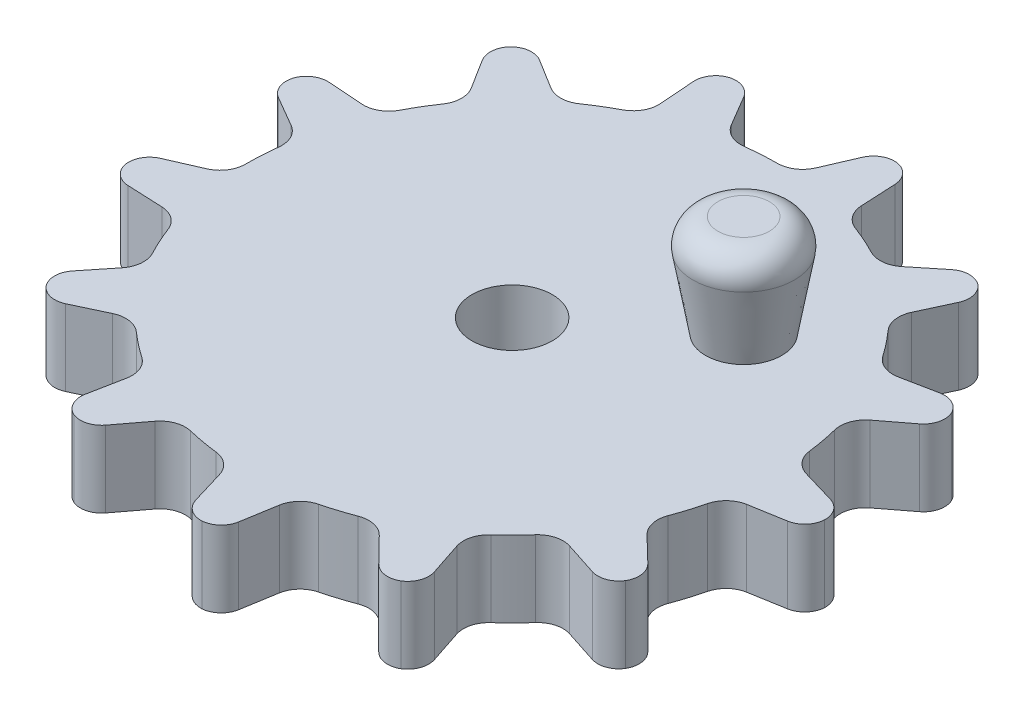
ISO-10303-21;
HEADER;
FILE_DESCRIPTION(('STEP AP214'),'2;1');
FILE_NAME('part.step','',(''),(''),'','','');
FILE_SCHEMA(('AUTOMOTIVE_DESIGN { 1 0 10303 214 1 1 1 1 }'));
ENDSEC;
DATA;
#1=APPLICATION_CONTEXT('core data for automotive mechanical design processes');
#2=APPLICATION_PROTOCOL_DEFINITION('international standard','automotive_design',2000,#1);
#3=PRODUCT_CONTEXT('',#1,'mechanical');
#4=PRODUCT('Part','Part','',(#3));
#5=PRODUCT_RELATED_PRODUCT_CATEGORY('part','',(#4));
#6=PRODUCT_DEFINITION_FORMATION('','',#4);
#7=PRODUCT_DEFINITION_CONTEXT('part definition',#1,'design');
#8=PRODUCT_DEFINITION('design','',#6,#7);
#9=PRODUCT_DEFINITION_SHAPE('','',#8);
#10=(LENGTH_UNIT() NAMED_UNIT(*) SI_UNIT(.MILLI.,.METRE.));
#11=(NAMED_UNIT(*) PLANE_ANGLE_UNIT() SI_UNIT($,.RADIAN.));
#12=(NAMED_UNIT(*) SI_UNIT($,.STERADIAN.) SOLID_ANGLE_UNIT());
#13=UNCERTAINTY_MEASURE_WITH_UNIT(LENGTH_MEASURE(1.E-05),#10,'distance_accuracy_value','');
#14=(GEOMETRIC_REPRESENTATION_CONTEXT(3) GLOBAL_UNCERTAINTY_ASSIGNED_CONTEXT((#13)) GLOBAL_UNIT_ASSIGNED_CONTEXT((#10,
#11,#12)) REPRESENTATION_CONTEXT('',''));
#15=CARTESIAN_POINT('',(0.,0.,0.));
#16=DIRECTION('',(0.,0.,1.));
#17=DIRECTION('',(1.,0.,0.));
#18=AXIS2_PLACEMENT_3D('',#15,#16,#17);
#19=CARTESIAN_POINT('',(56.2948486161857,9.,-32.5062526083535));
#20=DIRECTION('',(0.,1.,0.));
#21=DIRECTION('',(-0.857167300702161,0.,-0.515038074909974));
#22=AXIS2_PLACEMENT_3D('',#19,#20,#21);
#23=PLANE('',#22);
#24=CARTESIAN_POINT('',(71.6125798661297,9.,-44.5734440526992));
#25=DIRECTION('',(0.,1.,0.));
#26=DIRECTION('',(0.,0.,1.));
#27=AXIS2_PLACEMENT_3D('',#24,#25,#26);
#28=CIRCLE('',#27,4.50000000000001);
#29=CARTESIAN_POINT('',(71.6125798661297,9.,-40.0734440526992));
#30=VERTEX_POINT('',#29);
#31=EDGE_CURVE('E2500',#30,#30,#28,.T.);
#32=ORIENTED_EDGE('',*,*,#31,.F.);
#33=EDGE_LOOP('',(#32));
#34=FACE_BOUND('',#33,.T.);
#35=CARTESIAN_POINT('',(56.2948486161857,9.,-32.5062526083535));
#36=DIRECTION('',(0.,1.,0.));
#37=DIRECTION('',(-0.857167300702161,0.,-0.515038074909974));
#38=AXIS2_PLACEMENT_3D('',#35,#36,#37);
#39=CIRCLE('',#38,4.75);
#40=CARTESIAN_POINT('',(52.2233039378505,9.,-34.9526834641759));
#41=VERTEX_POINT('',#40);
#42=EDGE_CURVE('E2501',#41,#41,#39,.T.);
#43=ORIENTED_EDGE('',*,*,#42,.F.);
#44=EDGE_LOOP('',(#43));
#45=FACE_BOUND('',#44,.T.);
#46=CARTESIAN_POINT('',(92.9860525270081,9.,-30.4282594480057));
#47=DIRECTION('',(0.,1.,0.));
#48=DIRECTION('',(-0.857167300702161,0.,-0.515038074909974));
#49=AXIS2_PLACEMENT_3D('',#46,#47,#48);
#50=CIRCLE('',#49,2.5);
#51=CARTESIAN_POINT('',(93.4102532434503,9.,-27.9645115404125));
#52=VERTEX_POINT('',#51);
#53=CARTESIAN_POINT('',(95.4790763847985,9.,-30.2416259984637));
#54=VERTEX_POINT('',#53);
#55=EDGE_CURVE('E1227',#52,#54,#50,.T.);
#56=ORIENTED_EDGE('',*,*,#55,.T.);
#57=CARTESIAN_POINT('',(92.9811505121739,9.,-30.3434411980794));
#58=DIRECTION('',(0.,1.,0.));
#59=DIRECTION('',(-0.857167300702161,0.,-0.515038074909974));
#60=AXIS2_PLACEMENT_3D('',#57,#58,#59);
#61=CIRCLE('',#60,2.5);
#62=CARTESIAN_POINT('',(93.6863601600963,9.,-32.7419155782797));
#63=VERTEX_POINT('',#62);
#64=EDGE_CURVE('E1232',#54,#63,#61,.T.);
#65=ORIENTED_EDGE('',*,*,#64,.T.);
#66=DIRECTION('',(0.959389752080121,0.,0.282083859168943));
#67=VECTOR('',#66,1.);
#68=CARTESIAN_POINT('',(95.5436210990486,9.,-32.1958358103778));
#69=LINE('',#68,#67);
#70=CARTESIAN_POINT('',(89.6806295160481,9.,-33.9196975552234));
#71=VERTEX_POINT('',#70);
#72=EDGE_CURVE('E618',#71,#63,#69,.T.);
#73=ORIENTED_EDGE('',*,*,#72,.F.);
#74=CARTESIAN_POINT('',(90.5268810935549,9.,-36.7978668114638));
#75=DIRECTION('',(0.,1.,0.));
#76=DIRECTION('',(0.998334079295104,0.,0.0576980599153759));
#77=AXIS2_PLACEMENT_3D('',#74,#75,#76);
#78=CIRCLE('',#77,2.99999999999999);
#79=CARTESIAN_POINT('',(87.5501826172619,9.,-36.4246829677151));
#80=VERTEX_POINT('',#79);
#81=EDGE_CURVE('E1069',#80,#71,#78,.T.);
#82=ORIENTED_EDGE('',*,*,#81,.F.);
#83=CARTESIAN_POINT('',(56.2948486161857,9.,-32.5062526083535));
#84=DIRECTION('',(0.,-1.,0.));
#85=DIRECTION('',(-0.910794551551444,0.,0.412859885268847));
#86=AXIS2_PLACEMENT_3D('',#83,#84,#85);
#87=CIRCLE('',#86,31.5);
#88=CARTESIAN_POINT('',(86.868302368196,9.,-40.0900462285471));
#89=VERTEX_POINT('',#88);
#90=EDGE_CURVE('E607',#89,#80,#87,.T.);
#91=ORIENTED_EDGE('',*,*,#90,.F.);
#92=CARTESIAN_POINT('',(89.7800598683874,9.,-40.8123122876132));
#93=DIRECTION('',(0.,1.,0.));
#94=DIRECTION('',(-0.910794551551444,0.,0.412859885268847));
#95=AXIS2_PLACEMENT_3D('',#92,#93,#94);
#96=CIRCLE('',#95,3.);
#97=CARTESIAN_POINT('',(87.9553736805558,9.,-43.193597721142));
#98=VERTEX_POINT('',#97);
#99=EDGE_CURVE('E634',#98,#89,#96,.T.);
#100=ORIENTED_EDGE('',*,*,#99,.F.);
#101=DIRECTION('',(-0.793761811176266,0.,0.608228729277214));
#102=VECTOR('',#101,1.);
#103=CARTESIAN_POINT('',(92.8061851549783,9.,-46.9105854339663));
#104=LINE('',#103,#102);
#105=CARTESIAN_POINT('',(91.2695596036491,9.,-45.7331291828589));
#106=VERTEX_POINT('',#105);
#107=EDGE_CURVE('E632',#106,#98,#104,.T.);
#108=ORIENTED_EDGE('',*,*,#107,.F.);
#109=CARTESIAN_POINT('',(89.7489877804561,9.,-47.7175337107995));
#110=DIRECTION('',(0.,1.,0.));
#111=DIRECTION('',(-0.857167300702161,0.,-0.515038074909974));
#112=AXIS2_PLACEMENT_3D('',#109,#110,#111);
#113=CIRCLE('',#112,2.5);
#114=CARTESIAN_POINT('',(92.0431836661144,9.,-48.7108439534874));
#115=VERTEX_POINT('',#114);
#116=EDGE_CURVE('E1211',#106,#115,#113,.T.);
#117=ORIENTED_EDGE('',*,*,#116,.T.);
#118=CARTESIAN_POINT('',(89.7840642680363,9.,-47.6401528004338));
#119=DIRECTION('',(0.,1.,0.));
#120=DIRECTION('',(-0.857167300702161,0.,-0.515038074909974));
#121=AXIS2_PLACEMENT_3D('',#118,#119,#120);
#122=CIRCLE('',#121,2.5);
#123=CARTESIAN_POINT('',(89.2938697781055,9.,-50.0916236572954));
#124=VERTEX_POINT('',#123);
#125=EDGE_CURVE('E1216',#115,#124,#122,.T.);
#126=ORIENTED_EDGE('',*,*,#125,.T.);
#127=DIRECTION('',(0.980588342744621,0.,-0.196077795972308));
#128=VECTOR('',#127,1.);
#129=CARTESIAN_POINT('',(91.1921685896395,9.,-50.4712062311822));
#130=LINE('',#129,#128);
#131=CARTESIAN_POINT('',(85.1996288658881,9.,-49.2729419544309));
#132=VERTEX_POINT('',#131);
#133=EDGE_CURVE('E1439',#132,#124,#130,.T.);
#134=ORIENTED_EDGE('',*,*,#133,.F.);
#135=CARTESIAN_POINT('',(84.6113954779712,9.,-52.2147069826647));
#136=DIRECTION('',(0.,1.,0.));
#137=DIRECTION('',(0.910794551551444,0.,-0.412859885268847));
#138=AXIS2_PLACEMENT_3D('',#135,#136,#137);
#139=CIRCLE('',#138,2.99999999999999);
#140=CARTESIAN_POINT('',(82.1490870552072,9.,-50.5009283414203));
#141=VERTEX_POINT('',#140);
#142=EDGE_CURVE('E1402',#141,#132,#139,.T.);
#143=ORIENTED_EDGE('',*,*,#142,.F.);
#144=CARTESIAN_POINT('',(56.2948486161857,9.,-32.5062526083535));
#145=DIRECTION('',(0.,-1.,0.));
#146=DIRECTION('',(-0.614602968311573,0.,0.788836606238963));
#147=AXIS2_PLACEMENT_3D('',#144,#145,#146);
#148=CIRCLE('',#147,31.5);
#149=CARTESIAN_POINT('',(79.8419328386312,9.,-53.429560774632));
#150=VERTEX_POINT('',#149);
#151=EDGE_CURVE('E663',#150,#141,#148,.T.);
#152=ORIENTED_EDGE('',*,*,#151,.F.);
#153=CARTESIAN_POINT('',(82.0845122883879,9.,-55.422256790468));
#154=DIRECTION('',(0.,1.,0.));
#155=DIRECTION('',(-0.614602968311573,0.,0.788836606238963));
#156=AXIS2_PLACEMENT_3D('',#153,#154,#155);
#157=CIRCLE('',#156,3.);
#158=CARTESIAN_POINT('',(79.3621943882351,9.,-56.6828063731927));
#159=VERTEX_POINT('',#158);
#160=EDGE_CURVE('E672',#159,#150,#157,.T.);
#161=ORIENTED_EDGE('',*,*,#160,.F.);
#162=DIRECTION('',(-0.420183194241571,0.,0.907439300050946));
#163=VECTOR('',#162,1.);
#164=CARTESIAN_POINT('',(81.9300043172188,9.,-62.228320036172));
#165=LINE('',#164,#163);
#166=CARTESIAN_POINT('',(81.1165811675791,9.,-60.4716288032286));
#167=VERTEX_POINT('',#166);
#168=EDGE_CURVE('E670',#167,#159,#165,.T.);
#169=ORIENTED_EDGE('',*,*,#168,.F.);
#170=CARTESIAN_POINT('',(78.8479829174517,9.,-61.5220867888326));
#171=DIRECTION('',(0.,1.,0.));
#172=DIRECTION('',(-0.857167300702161,0.,-0.515038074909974));
#173=AXIS2_PLACEMENT_3D('',#170,#171,#172);
#174=CIRCLE('',#173,2.5);
#175=CARTESIAN_POINT('',(80.417778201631,9.,-63.4677853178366));
#176=VERTEX_POINT('',#175);
#177=EDGE_CURVE('E1195',#167,#176,#174,.T.);
#178=ORIENTED_EDGE('',*,*,#177,.T.);
#179=CARTESIAN_POINT('',(78.9150023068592,9.,-61.4698702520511));
#180=DIRECTION('',(0.,1.,0.));
#181=DIRECTION('',(-0.857167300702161,0.,-0.515038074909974));
#182=AXIS2_PLACEMENT_3D('',#179,#180,#181);
#183=CIRCLE('',#182,2.5);
#184=CARTESIAN_POINT('',(77.3417013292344,9.,-63.4127351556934));
#185=VERTEX_POINT('',#184);
#186=EDGE_CURVE('E1200',#176,#185,#183,.T.);
#187=ORIENTED_EDGE('',*,*,#186,.T.);
#188=DIRECTION('',(0.777145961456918,0.,-0.629320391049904));
#189=VECTOR('',#188,1.);
#190=CARTESIAN_POINT('',(78.8461606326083,9.,-64.6310222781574));
#191=LINE('',#190,#189);
#192=CARTESIAN_POINT('',(74.096891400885,9.,-60.785139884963));
#193=VERTEX_POINT('',#192);
#194=EDGE_CURVE('E1409',#193,#185,#191,.T.);
#195=ORIENTED_EDGE('',*,*,#194,.F.);
#196=CARTESIAN_POINT('',(72.2089302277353,9.,-63.1165777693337));
#197=DIRECTION('',(0.,1.,0.));
#198=DIRECTION('',(0.614602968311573,0.,-0.788836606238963));
#199=AXIS2_PLACEMENT_3D('',#196,#197,#198);
#200=CIRCLE('',#199,2.99999999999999);
#201=CARTESIAN_POINT('',(70.8250970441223,9.,-60.4548103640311));
#202=VERTEX_POINT('',#201);
#203=EDGE_CURVE('E639',#202,#193,#200,.T.);
#204=ORIENTED_EDGE('',*,*,#203,.F.);
#205=CARTESIAN_POINT('',(56.2948486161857,9.,-32.5062526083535));
#206=DIRECTION('',(0.,-1.,0.));
#207=DIRECTION('',(-0.177613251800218,0.,0.984100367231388));
#208=AXIS2_PLACEMENT_3D('',#205,#206,#207);
#209=CIRCLE('',#208,31.5);
#210=CARTESIAN_POINT('',(67.4212100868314,9.,-61.9757975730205));
#211=VERTEX_POINT('',#210);
#212=EDGE_CURVE('E702',#211,#202,#209,.T.);
#213=ORIENTED_EDGE('',*,*,#212,.F.);
#214=CARTESIAN_POINT('',(68.4808635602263,9.,-64.7824209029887));
#215=DIRECTION('',(0.,1.,0.));
#216=DIRECTION('',(-0.177613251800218,0.,0.984100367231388));
#217=AXIS2_PLACEMENT_3D('',#214,#215,#216);
#218=CIRCLE('',#217,3.);
#219=CARTESIAN_POINT('',(65.4845641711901,9.,-64.6334579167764));
#220=VERTEX_POINT('',#219);
#221=EDGE_CURVE('E710',#220,#211,#218,.T.);
#222=ORIENTED_EDGE('',*,*,#221,.F.);
#223=DIRECTION('',(0.0496543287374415,0.,0.998766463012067));
#224=VECTOR('',#223,1.);
#225=CARTESIAN_POINT('',(65.1811182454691,9.,-70.7370871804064));
#226=LINE('',#225,#224);
#227=CARTESIAN_POINT('',(65.2772429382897,9.,-68.8035977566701));
#228=VERTEX_POINT('',#227);
#229=EDGE_CURVE('E657',#228,#220,#226,.T.);
#230=ORIENTED_EDGE('',*,*,#229,.F.);
#231=CARTESIAN_POINT('',(62.7803267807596,9.,-68.6794619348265));
#232=DIRECTION('',(0.,1.,0.));
#233=DIRECTION('',(-0.857167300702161,0.,-0.515038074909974));
#234=AXIS2_PLACEMENT_3D('',#231,#232,#233);
#235=CIRCLE('',#234,2.5);
#236=CARTESIAN_POINT('',(63.2661002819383,9.,-71.1318126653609));
#237=VERTEX_POINT('',#236);
#238=EDGE_CURVE('E1179',#228,#237,#235,.T.);
#239=ORIENTED_EDGE('',*,*,#238,.T.);
#240=CARTESIAN_POINT('',(62.8639357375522,9.,-68.6643719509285));
#241=DIRECTION('',(0.,1.,0.));
#242=DIRECTION('',(-0.857167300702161,0.,-0.515038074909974));
#243=AXIS2_PLACEMENT_3D('',#240,#241,#242);
#244=CIRCLE('',#243,2.5);
#245=CARTESIAN_POINT('',(60.5679525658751,9.,-69.6535439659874));
#246=VERTEX_POINT('',#245);
#247=EDGE_CURVE('E1184',#237,#246,#244,.T.);
#248=ORIENTED_EDGE('',*,*,#247,.T.);
#249=DIRECTION('',(0.395668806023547,0.,-0.918393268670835));
#250=VECTOR('',#249,1.);
#251=CARTESIAN_POINT('',(61.3339188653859,9.,-71.4314407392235));
#252=LINE('',#251,#250);
#253=CARTESIAN_POINT('',(58.9159204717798,9.,-65.8189855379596));
#254=VERTEX_POINT('',#253);
#255=EDGE_CURVE('E645',#254,#246,#252,.T.);
#256=ORIENTED_EDGE('',*,*,#255,.F.);
#257=CARTESIAN_POINT('',(56.1607406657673,9.,-67.0059919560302));
#258=DIRECTION('',(0.,1.,0.));
#259=DIRECTION('',(0.177613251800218,0.,-0.984100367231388));
#260=AXIS2_PLACEMENT_3D('',#257,#258,#259);
#261=CIRCLE('',#260,2.99999999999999);
#262=CARTESIAN_POINT('',(56.1724022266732,9.,-64.0060146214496));
#263=VERTEX_POINT('',#262);
#264=EDGE_CURVE('E649',#263,#254,#261,.T.);
#265=ORIENTED_EDGE('',*,*,#264,.F.);
#266=CARTESIAN_POINT('',(56.2948486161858,9.,-32.5062526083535));
#267=DIRECTION('',(0.,-1.,0.));
#268=DIRECTION('',(0.300065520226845,0.,0.953918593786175));
#269=AXIS2_PLACEMENT_3D('',#266,#267,#268);
#270=CIRCLE('',#269,31.5);
#271=CARTESIAN_POINT('',(52.4515720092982,9.,-63.7709167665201));
#272=VERTEX_POINT('',#271);
#273=EDGE_CURVE('E739',#272,#263,#270,.T.);
#274=ORIENTED_EDGE('',*,*,#273,.F.);
#275=CARTESIAN_POINT('',(52.0855456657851,9.,-66.7485038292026));
#276=DIRECTION('',(0.,1.,0.));
#277=DIRECTION('',(0.300065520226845,0.,0.953918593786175));
#278=AXIS2_PLACEMENT_3D('',#275,#276,#277);
#279=CIRCLE('',#278,3.);
#280=CARTESIAN_POINT('',(49.5016808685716,9.,-65.224153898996));
#281=VERTEX_POINT('',#280);
#282=EDGE_CURVE('E747',#281,#272,#279,.T.);
#283=ORIENTED_EDGE('',*,*,#282,.F.);
#284=DIRECTION('',(0.508116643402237,0.,0.86128826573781));
#285=VECTOR('',#284,1.);
#286=CARTESIAN_POINT('',(46.3964948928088,9.,-70.4876308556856));
#287=LINE('',#286,#285);
#288=CARTESIAN_POINT('',(47.3801464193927,9.,-68.8202823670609));
#289=VERTEX_POINT('',#288);
#290=EDGE_CURVE('E696',#289,#281,#287,.T.);
#291=ORIENTED_EDGE('',*,*,#290,.F.);
#292=CARTESIAN_POINT('',(45.2269257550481,9.,-67.5499907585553));
#293=DIRECTION('',(0.,1.,0.));
#294=DIRECTION('',(-0.857167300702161,0.,-0.515038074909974));
#295=AXIS2_PLACEMENT_3D('',#292,#293,#294);
#296=CIRCLE('',#295,2.5);
#297=CARTESIAN_POINT('',(44.5173926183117,9.,-69.9471896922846));
#298=VERTEX_POINT('',#297);
#299=EDGE_CURVE('E1163',#289,#298,#296,.T.);
#300=ORIENTED_EDGE('',*,*,#299,.T.);
#301=CARTESIAN_POINT('',(45.3079704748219,9.,-67.5754842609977));
#302=DIRECTION('',(0.,1.,0.));
#303=DIRECTION('',(-0.857167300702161,0.,-0.515038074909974));
#304=AXIS2_PLACEMENT_3D('',#301,#302,#303);
#305=CIRCLE('',#304,2.5);
#306=CARTESIAN_POINT('',(42.815287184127,9.,-67.3843559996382));
#307=VERTEX_POINT('',#306);
#308=EDGE_CURVE('E1168',#298,#307,#305,.T.);
#309=ORIENTED_EDGE('',*,*,#308,.T.);
#310=DIRECTION('',(-0.0764513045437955,0.,-0.997073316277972));
#311=VECTOR('',#310,1.);
#312=CARTESIAN_POINT('',(42.6672868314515,9.,-69.3145676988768));
#313=LINE('',#312,#311);
#314=CARTESIAN_POINT('',(43.1344935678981,9.,-63.2212855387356));
#315=VERTEX_POINT('',#314);
#316=EDGE_CURVE('E684',#315,#307,#313,.T.);
#317=ORIENTED_EDGE('',*,*,#316,.F.);
#318=CARTESIAN_POINT('',(40.1432736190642,9.,-62.9919316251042));
#319=DIRECTION('',(0.,1.,0.));
#320=DIRECTION('',(-0.300065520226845,0.,-0.953918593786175));
#321=AXIS2_PLACEMENT_3D('',#318,#319,#320);
#322=CIRCLE('',#321,2.99999999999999);
#323=CARTESIAN_POINT('',(41.5477584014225,9.,-60.341003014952));
#324=VERTEX_POINT('',#323);
#325=EDGE_CURVE('E688',#324,#315,#322,.T.);
#326=ORIENTED_EDGE('',*,*,#325,.F.);
#327=CARTESIAN_POINT('',(56.2948486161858,9.,-32.5062526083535));
#328=DIRECTION('',(0.,-1.,0.));
#329=DIRECTION('',(0.709002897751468,0.,0.705205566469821));
#330=AXIS2_PLACEMENT_3D('',#327,#328,#329);
#331=CIRCLE('',#330,31.5);
#332=CARTESIAN_POINT('',(38.3623822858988,9.,-58.4036781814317));
#333=VERTEX_POINT('',#332);
#334=EDGE_CURVE('E776',#333,#324,#331,.T.);
#335=ORIENTED_EDGE('',*,*,#334,.F.);
#336=CARTESIAN_POINT('',(36.654528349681,9.,-60.870099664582));
#337=DIRECTION('',(0.,1.,0.));
#338=DIRECTION('',(0.709002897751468,0.,0.705205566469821));
#339=AXIS2_PLACEMENT_3D('',#336,#337,#338);
#340=CIRCLE('',#339,3.);
#341=CARTESIAN_POINT('',(35.0750304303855,9.,-58.3195729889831));
#342=VERTEX_POINT('',#341);
#343=EDGE_CURVE('E784',#342,#333,#340,.T.);
#344=ORIENTED_EDGE('',*,*,#343,.F.);
#345=DIRECTION('',(0.850175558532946,0.,0.526499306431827));
#346=VECTOR('',#345,1.);
#347=CARTESIAN_POINT('',(29.8794650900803,9.,-61.5370984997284));
#348=LINE('',#347,#346);
#349=CARTESIAN_POINT('',(31.5253007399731,9.,-60.5178603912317));
#350=VERTEX_POINT('',#349);
#351=EDGE_CURVE('E733',#350,#342,#348,.T.);
#352=ORIENTED_EDGE('',*,*,#351,.F.);
#353=CARTESIAN_POINT('',(30.2090524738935,9.,-58.3924214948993));
#354=DIRECTION('',(0.,1.,0.));
#355=DIRECTION('',(-0.857167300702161,0.,-0.515038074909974));
#356=AXIS2_PLACEMENT_3D('',#353,#354,#355);
#357=CIRCLE('',#356,2.5);
#358=CARTESIAN_POINT('',(28.466758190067,9.,-60.1852992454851));
#359=VERTEX_POINT('',#358);
#360=EDGE_CURVE('E1147',#350,#359,#357,.T.);
#361=ORIENTED_EDGE('',*,*,#360,.T.);
#362=CARTESIAN_POINT('',(30.268966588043,9.,-58.4526582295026));
#363=DIRECTION('',(0.,1.,0.));
#364=DIRECTION('',(-0.857167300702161,0.,-0.515038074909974));
#365=AXIS2_PLACEMENT_3D('',#362,#363,#364);
#366=CIRCLE('',#365,2.5);
#367=CARTESIAN_POINT('',(28.1506268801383,9.,-57.125014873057));
#368=VERTEX_POINT('',#367);
#369=EDGE_CURVE('E1152',#359,#368,#366,.T.);
#370=ORIENTED_EDGE('',*,*,#369,.T.);
#371=DIRECTION('',(-0.531057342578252,0.,-0.847335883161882));
#372=VECTOR('',#371,1.);
#373=CARTESIAN_POINT('',(27.1225649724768,9.,-58.7653532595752));
#374=LINE('',#373,#372);
#375=CARTESIAN_POINT('',(30.3679454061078,9.,-53.5871416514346));
#376=VERTEX_POINT('',#375);
#377=EDGE_CURVE('E721',#376,#368,#374,.T.);
#378=ORIENTED_EDGE('',*,*,#377,.F.);
#379=CARTESIAN_POINT('',(27.8259377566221,9.,-51.9939696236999));
#380=DIRECTION('',(0.,1.,0.));
#381=DIRECTION('',(-0.709002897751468,0.,-0.705205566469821));
#382=AXIS2_PLACEMENT_3D('',#379,#380,#381);
#383=CIRCLE('',#382,2.99999999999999);
#384=CARTESIAN_POINT('',(30.3014952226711,9.,-50.2993855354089));
#385=VERTEX_POINT('',#384);
#386=EDGE_CURVE('E725',#385,#376,#383,.T.);
#387=ORIENTED_EDGE('',*,*,#386,.F.);
#388=CARTESIAN_POINT('',(56.2948486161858,9.,-32.5062526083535));
#389=DIRECTION('',(0.,-1.,0.));
#390=DIRECTION('',(0.955516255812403,0.,0.294938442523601));
#391=AXIS2_PLACEMENT_3D('',#388,#389,#390);
#392=CIRCLE('',#391,31.5);
#393=CARTESIAN_POINT('',(28.3813044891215,9.,-47.103651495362));
#394=VERTEX_POINT('',#393);
#395=EDGE_CURVE('E813',#394,#385,#392,.T.);
#396=ORIENTED_EDGE('',*,*,#395,.F.);
#397=CARTESIAN_POINT('',(25.7228717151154,9.,-48.4938799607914));
#398=DIRECTION('',(0.,1.,0.));
#399=DIRECTION('',(0.955516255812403,0.,0.294938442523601));
#400=AXIS2_PLACEMENT_3D('',#397,#398,#399);
#401=CIRCLE('',#400,3.);
#402=CARTESIAN_POINT('',(25.509584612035,9.,-45.5014714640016));
#403=VERTEX_POINT('',#402);
#404=EDGE_CURVE('E821',#403,#394,#401,.T.);
#405=ORIENTED_EDGE('',*,*,#404,.F.);
#406=DIRECTION('',(0.997469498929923,0.,0.0710957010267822));
#407=VECTOR('',#406,1.);
#408=CARTESIAN_POINT('',(19.4138813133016,9.,-45.9359492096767));
#409=LINE('',#408,#407);
#410=CARTESIAN_POINT('',(21.3448599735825,9.,-45.7983166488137));
#411=VERTEX_POINT('',#410);
#412=EDGE_CURVE('E770',#411,#403,#409,.T.);
#413=ORIENTED_EDGE('',*,*,#412,.F.);
#414=CARTESIAN_POINT('',(21.1671207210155,9.,-43.3046429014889));
#415=DIRECTION('',(0.,1.,0.));
#416=DIRECTION('',(-0.857167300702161,0.,-0.515038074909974));
#417=AXIS2_PLACEMENT_3D('',#414,#415,#416);
#418=CIRCLE('',#417,2.5);
#419=CARTESIAN_POINT('',(18.7912039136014,9.,-44.0824727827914));
#420=VERTEX_POINT('',#419);
#421=EDGE_CURVE('E1131',#411,#420,#418,.T.);
#422=ORIENTED_EDGE('',*,*,#421,.T.);
#423=CARTESIAN_POINT('',(21.1921786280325,9.,-43.3858233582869));
#424=DIRECTION('',(0.,1.,0.));
#425=DIRECTION('',(-0.857167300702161,0.,-0.515038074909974));
#426=AXIS2_PLACEMENT_3D('',#423,#424,#425);
#427=CIRCLE('',#426,2.5);
#428=CARTESIAN_POINT('',(19.933468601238,9.,-41.2258119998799));
#429=VERTEX_POINT('',#428);
#430=EDGE_CURVE('E1136',#420,#429,#427,.T.);
#431=ORIENTED_EDGE('',*,*,#430,.T.);
#432=DIRECTION('',(-0.864004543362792,0.,-0.503484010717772));
#433=VECTOR('',#432,1.);
#434=CARTESIAN_POINT('',(18.2608617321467,9.,-42.2004953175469));
#435=LINE('',#434,#433);
#436=CARTESIAN_POINT('',(23.5409383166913,9.,-39.1236201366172));
#437=VERTEX_POINT('',#436);
#438=EDGE_CURVE('E758',#437,#429,#435,.T.);
#439=ORIENTED_EDGE('',*,*,#438,.F.);
#440=CARTESIAN_POINT('',(22.030486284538,9.,-36.5316065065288));
#441=DIRECTION('',(0.,1.,0.));
#442=DIRECTION('',(-0.955516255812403,0.,-0.294938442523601));
#443=AXIS2_PLACEMENT_3D('',#440,#441,#442);
#444=CIRCLE('',#443,2.99999999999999);
#445=CARTESIAN_POINT('',(25.0099960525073,9.,-36.1815757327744));
#446=VERTEX_POINT('',#445);
#447=EDGE_CURVE('E762',#446,#437,#444,.T.);
#448=ORIENTED_EDGE('',*,*,#447,.F.);
#449=CARTESIAN_POINT('',(56.2948486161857,9.,-32.5062526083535));
#450=DIRECTION('',(0.,-1.,0.));
#451=DIRECTION('',(0.983132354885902,0.,-0.18289552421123));
#452=AXIS2_PLACEMENT_3D('',#449,#450,#451);
#453=CIRCLE('',#452,31.5);
#454=CARTESIAN_POINT('',(24.7948832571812,9.,-32.4595366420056));
#455=VERTEX_POINT('',#454);
#456=EDGE_CURVE('E850',#455,#446,#453,.T.);
#457=ORIENTED_EDGE('',*,*,#456,.F.);
#458=CARTESIAN_POINT('',(21.7948865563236,9.,-32.4550875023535));
#459=DIRECTION('',(0.,1.,0.));
#460=DIRECTION('',(0.983132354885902,0.,-0.18289552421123));
#461=AXIS2_PLACEMENT_3D('',#458,#459,#460);
#462=CIRCLE('',#461,3.);
#463=CARTESIAN_POINT('',(22.9966717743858,9.,-29.7063219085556));
#464=VERTEX_POINT('',#463);
#465=EDGE_CURVE('E858',#464,#455,#462,.T.);
#466=ORIENTED_EDGE('',*,*,#465,.F.);
#467=DIRECTION('',(0.916255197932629,0.,-0.40059507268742));
#468=VECTOR('',#467,1.);
#469=CARTESIAN_POINT('',(17.3972826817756,9.,-27.2582182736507));
#470=LINE('',#469,#468);
#471=CARTESIAN_POINT('',(19.1710404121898,9.,-28.0337212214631));
#472=VERTEX_POINT('',#471);
#473=EDGE_CURVE('E807',#472,#464,#470,.T.);
#474=ORIENTED_EDGE('',*,*,#473,.F.);
#475=CARTESIAN_POINT('',(20.1725280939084,9.,-25.7430832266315));
#476=DIRECTION('',(0.,1.,0.));
#477=DIRECTION('',(-0.857167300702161,0.,-0.515038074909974));
#478=AXIS2_PLACEMENT_3D('',#475,#476,#477);
#479=CIRCLE('',#478,2.5);
#480=CARTESIAN_POINT('',(17.7072826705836,9.,-25.3276737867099));
#481=VERTEX_POINT('',#480);
#482=EDGE_CURVE('E1115',#472,#481,#479,.T.);
#483=ORIENTED_EDGE('',*,*,#482,.T.);
#484=CARTESIAN_POINT('',(20.1569893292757,9.,-25.8266099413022));
#485=DIRECTION('',(0.,1.,0.));
#486=DIRECTION('',(-0.857167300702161,0.,-0.515038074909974));
#487=AXIS2_PLACEMENT_3D('',#484,#485,#486);
#488=CIRCLE('',#487,2.5);
#489=CARTESIAN_POINT('',(20.0462642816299,9.,-23.3290631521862));
#490=VERTEX_POINT('',#489);
#491=EDGE_CURVE('E1120',#481,#490,#488,.T.);
#492=ORIENTED_EDGE('',*,*,#491,.T.);
#493=DIRECTION('',(-0.999018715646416,0.,-0.0442900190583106));
#494=VECTOR('',#493,1.);
#495=CARTESIAN_POINT('',(18.1122865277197,9.,-23.4148031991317));
#496=LINE('',#495,#494);
#497=CARTESIAN_POINT('',(24.2174573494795,9.,-23.1441394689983));
#498=VERTEX_POINT('',#497);
#499=EDGE_CURVE('E795',#498,#490,#496,.T.);
#500=ORIENTED_EDGE('',*,*,#499,.F.);
#501=CARTESIAN_POINT('',(24.0845872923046,9.,-20.147083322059));
#502=DIRECTION('',(0.,1.,0.));
#503=DIRECTION('',(-0.983132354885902,0.,0.18289552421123));
#504=AXIS2_PLACEMENT_3D('',#501,#502,#503);
#505=CIRCLE('',#504,2.99999999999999);
#506=CARTESIAN_POINT('',(26.8854795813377,9.,-21.2217936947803));
#507=VERTEX_POINT('',#506);
#508=EDGE_CURVE('E799',#507,#498,#505,.T.);
#509=ORIENTED_EDGE('',*,*,#508,.F.);
#510=CARTESIAN_POINT('',(56.2948486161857,9.,-32.5062526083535));
#511=DIRECTION('',(0.,-1.,0.));
#512=DIRECTION('',(0.785524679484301,0.,-0.618830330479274));
#513=AXIS2_PLACEMENT_3D('',#510,#511,#512);
#514=CIRCLE('',#513,31.5);
#515=CARTESIAN_POINT('',(28.424724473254,9.,-17.8261238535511));
#516=VERTEX_POINT('',#515);
#517=EDGE_CURVE('E887',#516,#507,#514,.T.);
#518=ORIENTED_EDGE('',*,*,#517,.F.);
#519=CARTESIAN_POINT('',(25.770426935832,9.,-16.4280163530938));
#520=DIRECTION('',(0.,1.,0.));
#521=DIRECTION('',(0.785524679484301,0.,-0.618830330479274));
#522=AXIS2_PLACEMENT_3D('',#519,#520,#521);
#523=CIRCLE('',#522,3.);
#524=CARTESIAN_POINT('',(28.1119699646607,9.,-14.5526027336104));
#525=VERTEX_POINT('',#524);
#526=EDGE_CURVE('E895',#525,#516,#523,.T.);
#527=ORIENTED_EDGE('',*,*,#526,.F.);
#528=DIRECTION('',(0.625137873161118,0.,-0.780514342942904));
#529=VECTOR('',#528,1.);
#530=CARTESIAN_POINT('',(24.291647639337,9.,-9.78274875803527));
#531=LINE('',#530,#529);
#532=CARTESIAN_POINT('',(25.5018379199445,9.,-11.2937288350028));
#533=VERTEX_POINT('',#532);
#534=EDGE_CURVE('E844',#533,#525,#531,.T.);
#535=ORIENTED_EDGE('',*,*,#534,.F.);
#536=CARTESIAN_POINT('',(27.4531237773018,9.,-9.73088415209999));
#537=DIRECTION('',(0.,1.,0.));
#538=DIRECTION('',(-0.857167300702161,0.,-0.515038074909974));
#539=AXIS2_PLACEMENT_3D('',#536,#537,#538);
#540=CIRCLE('',#539,2.5);
#541=CARTESIAN_POINT('',(25.4633077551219,9.,-8.21740068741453));
#542=VERTEX_POINT('',#541);
#543=EDGE_CURVE('E1099',#533,#542,#540,.T.);
#544=ORIENTED_EDGE('',*,*,#543,.T.);
#545=CARTESIAN_POINT('',(27.4005480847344,9.,-9.79762216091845));
#546=DIRECTION('',(0.,1.,0.));
#547=DIRECTION('',(-0.857167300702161,0.,-0.515038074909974));
#548=AXIS2_PLACEMENT_3D('',#545,#546,#547);
#549=CIRCLE('',#548,2.5);
#550=CARTESIAN_POINT('',(28.4631737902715,9.,-7.53469781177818));
#551=VERTEX_POINT('',#550);
#552=EDGE_CURVE('E1104',#542,#551,#549,.T.);
#553=ORIENTED_EDGE('',*,*,#552,.T.);
#554=DIRECTION('',(-0.905169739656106,0.,0.425050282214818));
#555=VECTOR('',#554,1.);
#556=CARTESIAN_POINT('',(26.7108761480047,9.,-6.7118525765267));
#557=LINE('',#556,#555);
#558=CARTESIAN_POINT('',(32.2425201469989,9.,-9.30940609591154));
#559=VERTEX_POINT('',#558);
#560=EDGE_CURVE('E832',#559,#551,#557,.T.);
#561=ORIENTED_EDGE('',*,*,#560,.F.);
#562=CARTESIAN_POINT('',(33.5176709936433,9.,-6.59389687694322));
#563=DIRECTION('',(0.,1.,0.));
#564=DIRECTION('',(-0.785524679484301,0.,0.618830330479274));
#565=AXIS2_PLACEMENT_3D('',#562,#563,#564);
#566=CIRCLE('',#565,2.99999999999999);
#567=CARTESIAN_POINT('',(35.498295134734,9.,-8.84714520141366));
#568=VERTEX_POINT('',#567);
#569=EDGE_CURVE('E836',#568,#559,#566,.T.);
#570=ORIENTED_EDGE('',*,*,#569,.F.);
#571=CARTESIAN_POINT('',(56.2948486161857,9.,-32.5062526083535));
#572=DIRECTION('',(0.,-1.,0.));
#573=DIRECTION('',(0.407962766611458,0.,-0.912998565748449));
#574=AXIS2_PLACEMENT_3D('',#571,#572,#573);
#575=CIRCLE('',#574,31.5);
#576=CARTESIAN_POINT('',(38.4392752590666,9.,-6.55575164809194));
#577=VERTEX_POINT('',#576);
#578=EDGE_CURVE('E924',#577,#568,#575,.T.);
#579=ORIENTED_EDGE('',*,*,#578,.F.);
#580=CARTESIAN_POINT('',(36.7387444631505,9.,-4.08427536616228));
#581=DIRECTION('',(0.,1.,0.));
#582=DIRECTION('',(0.407962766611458,0.,-0.912998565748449));
#583=AXIS2_PLACEMENT_3D('',#580,#581,#582);
#584=CIRCLE('',#583,3.);
#585=CARTESIAN_POINT('',(39.6836260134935,9.,-3.51184838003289));
#586=VERTEX_POINT('',#585);
#587=EDGE_CURVE('E932',#586,#577,#584,.T.);
#588=ORIENTED_EDGE('',*,*,#587,.F.);
#589=DIRECTION('',(0.190808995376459,0.,-0.981627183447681));
#590=VECTOR('',#589,1.);
#591=CARTESIAN_POINT('',(38.517560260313,9.,2.48703987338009));
#592=LINE('',#591,#590);
#593=CARTESIAN_POINT('',(38.8869430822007,9.,0.586729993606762));
#594=VERTEX_POINT('',#593);
#595=EDGE_CURVE('E881',#594,#586,#592,.T.);
#596=ORIENTED_EDGE('',*,*,#595,.F.);
#597=CARTESIAN_POINT('',(41.3410110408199,9.,1.06375248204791));
#598=DIRECTION('',(0.,1.,0.));
#599=DIRECTION('',(-0.857167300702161,0.,-0.515038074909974));
#600=AXIS2_PLACEMENT_3D('',#597,#598,#599);
#601=CIRCLE('',#600,2.5);
#602=CARTESIAN_POINT('',(40.2824672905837,9.,3.32858914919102));
#603=VERTEX_POINT('',#602);
#604=EDGE_CURVE('E1083',#594,#603,#601,.T.);
#605=ORIENTED_EDGE('',*,*,#604,.T.);
#606=CARTESIAN_POINT('',(41.2634428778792,9.,1.02909205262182));
#607=DIRECTION('',(0.,1.,0.));
#608=DIRECTION('',(-0.857167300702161,0.,-0.515038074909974));
#609=AXIS2_PLACEMENT_3D('',#606,#607,#608);
#610=CIRCLE('',#609,2.5);
#611=CARTESIAN_POINT('',(43.2559845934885,9.,2.53898526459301));
#612=VERTEX_POINT('',#611);
#613=EDGE_CURVE('E1088',#603,#612,#610,.T.);
#614=ORIENTED_EDGE('',*,*,#613,.T.);
#615=DIRECTION('',(-0.603957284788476,0.,0.797016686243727));
#616=VECTOR('',#615,1.);
#617=CARTESIAN_POINT('',(42.0867973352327,9.,4.08191185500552));
#618=LINE('',#617,#616);
#619=CARTESIAN_POINT('',(45.7776815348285,9.,-0.788790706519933));
#620=VERTEX_POINT('',#619);
#621=EDGE_CURVE('E869',#620,#612,#618,.T.);
#622=ORIENTED_EDGE('',*,*,#621,.F.);
#623=CARTESIAN_POINT('',(48.1687315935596,9.,1.02308114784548));
#624=DIRECTION('',(0.,1.,0.));
#625=DIRECTION('',(-0.407962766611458,0.,0.912998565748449));
#626=AXIS2_PLACEMENT_3D('',#623,#624,#625);
#627=CIRCLE('',#626,2.99999999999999);
#628=CARTESIAN_POINT('',(48.8753504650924,9.,-1.89251309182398));
#629=VERTEX_POINT('',#628);
#630=EDGE_CURVE('E873',#629,#620,#627,.T.);
#631=ORIENTED_EDGE('',*,*,#630,.F.);
#632=CARTESIAN_POINT('',(56.2948486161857,9.,-32.5062526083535));
#633=DIRECTION('',(0.,-1.,0.));
#634=DIRECTION('',(-0.0630584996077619,0.,-0.998009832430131));
#635=AXIS2_PLACEMENT_3D('',#632,#633,#634);
#636=CIRCLE('',#635,31.5);
#637=CARTESIAN_POINT('',(52.5443227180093,9.,-1.23032647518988));
#638=VERTEX_POINT('',#637);
#639=EDGE_CURVE('E961',#638,#629,#636,.T.);
#640=ORIENTED_EDGE('',*,*,#639,.F.);
#641=CARTESIAN_POINT('',(52.1871297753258,9.,1.74833315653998));
#642=DIRECTION('',(0.,1.,0.));
#643=DIRECTION('',(-0.0630584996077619,0.,-0.998009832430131));
#644=AXIS2_PLACEMENT_3D('',#641,#642,#643);
#645=CIRCLE('',#644,3.);
#646=CARTESIAN_POINT('',(55.0607129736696,9.,0.88663738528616));
#647=VERTEX_POINT('',#646);
#648=EDGE_CURVE('E969',#647,#638,#645,.T.);
#649=ORIENTED_EDGE('',*,*,#648,.F.);
#650=DIRECTION('',(-0.287231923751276,0.,-0.95786106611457));
#651=VECTOR('',#650,1.);
#652=CARTESIAN_POINT('',(56.8160354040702,9.,6.74028691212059));
#653=LINE('',#652,#651);
#654=CARTESIAN_POINT('',(56.259989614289,9.,4.88598532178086));
#655=VERTEX_POINT('',#654);
#656=EDGE_CURVE('E918',#655,#647,#653,.T.);
#657=ORIENTED_EDGE('',*,*,#656,.F.);
#658=CARTESIAN_POINT('',(58.6546422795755,9.,4.16790551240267));
#659=DIRECTION('',(0.,1.,0.));
#660=DIRECTION('',(-0.857167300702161,0.,-0.515038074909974));
#661=AXIS2_PLACEMENT_3D('',#658,#659,#660);
#662=CIRCLE('',#661,2.5);
#663=CARTESIAN_POINT('',(58.7698704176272,9.,6.66524859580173));
#664=VERTEX_POINT('',#663);
#665=EDGE_CURVE('E1065',#655,#664,#662,.T.);
#666=ORIENTED_EDGE('',*,*,#665,.T.);
#667=CARTESIAN_POINT('',(58.5698515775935,9.,4.17326294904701));
#668=DIRECTION('',(0.,1.,0.));
#669=DIRECTION('',(-0.857167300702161,0.,-0.515038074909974));
#670=AXIS2_PLACEMENT_3D('',#667,#668,#669);
#671=CIRCLE('',#670,2.5);
#672=CARTESIAN_POINT('',(61.0358420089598,9.,4.58422668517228));
#673=VERTEX_POINT('',#672);
#674=EDGE_CURVE('E1072',#664,#673,#671,.T.);
#675=ORIENTED_EDGE('',*,*,#674,.T.);
#676=DIRECTION('',(-0.164385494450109,0.,0.986396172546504));
#677=VECTOR('',#676,1.);
#678=CARTESIAN_POINT('',(60.7176118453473,9.,6.49376874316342));
#679=LINE('',#678,#677);
#680=CARTESIAN_POINT('',(61.7221991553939,9.,0.465736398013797));
#681=VERTEX_POINT('',#680);
#682=EDGE_CURVE('E906',#681,#673,#679,.T.);
#683=ORIENTED_EDGE('',*,*,#682,.F.);
#684=CARTESIAN_POINT('',(64.6813876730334,9.,0.958892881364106));
#685=DIRECTION('',(0.,1.,0.));
#686=DIRECTION('',(0.0630584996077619,0.,0.998009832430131));
#687=AXIS2_PLACEMENT_3D('',#684,#685,#686);
#688=CIRCLE('',#687,2.99999999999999);
#689=CARTESIAN_POINT('',(63.9521234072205,9.,-1.95111976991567));
#690=VERTEX_POINT('',#689);
#691=EDGE_CURVE('E910',#690,#681,#688,.T.);
#692=ORIENTED_EDGE('',*,*,#691,.F.);
#693=CARTESIAN_POINT('',(56.2948486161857,9.,-32.5062526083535));
#694=DIRECTION('',(0.,-1.,0.));
#695=DIRECTION('',(-0.519633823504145,0.,-0.854389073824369));
#696=AXIS2_PLACEMENT_3D('',#693,#694,#695);
#697=CIRCLE('',#696,31.5);
#698=CARTESIAN_POINT('',(67.5085704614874,9.,-3.06983906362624));
#699=VERTEX_POINT('',#698);
#700=EDGE_CURVE('E979',#699,#690,#697,.T.);
#701=ORIENTED_EDGE('',*,*,#700,.F.);
#702=CARTESIAN_POINT('',(68.5765439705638,9.,-0.266371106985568));
#703=DIRECTION('',(0.,1.,0.));
#704=DIRECTION('',(-0.519633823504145,0.,-0.854389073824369));
#705=AXIS2_PLACEMENT_3D('',#702,#703,#704);
#706=CIRCLE('',#705,3.);
#707=CARTESIAN_POINT('',(70.7205255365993,9.,-2.36478551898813));
#708=VERTEX_POINT('',#707);
#709=EDGE_CURVE('E987',#708,#699,#706,.T.);
#710=ORIENTED_EDGE('',*,*,#709,.F.);
#711=DIRECTION('',(-0.699471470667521,0.,-0.714660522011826));
#712=VECTOR('',#711,1.);
#713=CARTESIAN_POINT('',(74.9951129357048,9.,2.0026247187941));
#714=LINE('',#713,#712);
#715=CARTESIAN_POINT('',(73.6410219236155,9.,0.619129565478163));
#716=VERTEX_POINT('',#715);
#717=EDGE_CURVE('E955',#716,#708,#714,.T.);
#718=ORIENTED_EDGE('',*,*,#717,.F.);
#719=CARTESIAN_POINT('',(75.427673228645,9.,-1.12954911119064));
#720=DIRECTION('',(0.,1.,0.));
#721=DIRECTION('',(-0.857167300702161,0.,-0.515038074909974));
#722=AXIS2_PLACEMENT_3D('',#719,#720,#721);
#723=CIRCLE('',#722,2.5);
#724=CARTESIAN_POINT('',(76.6902758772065,9.,1.02818918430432));
#725=VERTEX_POINT('',#724);
#726=EDGE_CURVE('E1050',#716,#725,#723,.T.);
#727=ORIENTED_EDGE('',*,*,#726,.T.);
#728=CARTESIAN_POINT('',(75.3550845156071,9.,-1.08540113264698));
#729=DIRECTION('',(0.,1.,0.));
#730=DIRECTION('',(-0.857167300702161,0.,-0.515038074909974));
#731=AXIS2_PLACEMENT_3D('',#728,#729,#730);
#732=CIRCLE('',#731,2.5);
#733=CARTESIAN_POINT('',(77.7295949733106,9.,-1.86751371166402));
#734=VERTEX_POINT('',#733);
#735=EDGE_CURVE('E1054',#725,#734,#732,.T.);
#736=ORIENTED_EDGE('',*,*,#735,.T.);
#737=DIRECTION('',(0.312845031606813,0.,0.949804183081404));
#738=VECTOR('',#737,1.);
#739=CARTESIAN_POINT('',(78.335224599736,9.,-0.0288092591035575));
#740=LINE('',#739,#738);
#741=CARTESIAN_POINT('',(76.4233761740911,9.,-5.83322182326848));
#742=VERTEX_POINT('',#741);
#743=EDGE_CURVE('E943',#742,#734,#740,.T.);
#744=ORIENTED_EDGE('',*,*,#743,.F.);
#745=CARTESIAN_POINT('',(79.2727887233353,9.,-6.77175691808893));
#746=DIRECTION('',(0.,1.,0.));
#747=DIRECTION('',(0.519633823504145,0.,0.854389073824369));
#748=AXIS2_PLACEMENT_3D('',#745,#746,#747);
#749=CIRCLE('',#748,2.99999999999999);
#750=CARTESIAN_POINT('',(77.2747069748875,9.,-9.00953915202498));
#751=VERTEX_POINT('',#750);
#752=EDGE_CURVE('E947',#751,#742,#749,.T.);
#753=ORIENTED_EDGE('',*,*,#752,.F.);
#754=CARTESIAN_POINT('',(56.2948486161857,9.,-32.5062526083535));
#755=DIRECTION('',(0.,-1.,0.));
#756=DIRECTION('',(-0.857167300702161,0.,-0.515038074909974));
#757=AXIS2_PLACEMENT_3D('',#754,#755,#756);
#758=CIRCLE('',#757,31.5);
#759=CARTESIAN_POINT('',(79.903889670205,9.,-11.6528792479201));
#760=VERTEX_POINT('',#759);
#761=EDGE_CURVE('E999',#760,#751,#758,.T.);
#762=ORIENTED_EDGE('',*,*,#761,.F.);
#763=CARTESIAN_POINT('',(82.1523697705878,9.,-9.66684368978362));
#764=DIRECTION('',(0.,1.,0.));
#765=DIRECTION('',(-0.857167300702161,0.,-0.515038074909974));
#766=AXIS2_PLACEMENT_3D('',#763,#764,#765);
#767=CIRCLE('',#766,3.);
#768=CARTESIAN_POINT('',(83.0755893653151,9.,-12.5212552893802));
#769=VERTEX_POINT('',#768);
#770=EDGE_CURVE('E1007',#769,#760,#767,.T.);
#771=ORIENTED_EDGE('',*,*,#770,.F.);
#772=DIRECTION('',(-0.95147053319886,0.,-0.307739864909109));
#773=VECTOR('',#772,1.);
#774=CARTESIAN_POINT('',(88.8901852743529,9.,-10.6406053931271));
#775=LINE('',#774,#773);
#776=CARTESIAN_POINT('',(87.0482549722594,9.,-11.2363520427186));
#777=VERTEX_POINT('',#776);
#778=EDGE_CURVE('E1005',#777,#769,#775,.T.);
#779=ORIENTED_EDGE('',*,*,#778,.F.);
#780=CARTESIAN_POINT('',(87.8176046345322,9.,-13.6150283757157));
#781=DIRECTION('',(0.,1.,0.));
#782=DIRECTION('',(-0.857167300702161,0.,-0.515038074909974));
#783=AXIS2_PLACEMENT_3D('',#780,#781,#782);
#784=CIRCLE('',#783,2.5);
#785=CARTESIAN_POINT('',(89.9383347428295,9.,-12.2912067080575));
#786=VERTEX_POINT('',#785);
#787=EDGE_CURVE('E1014',#777,#786,#784,.T.);
#788=ORIENTED_EDGE('',*,*,#787,.T.);
#789=CARTESIAN_POINT('',(87.7738471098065,9.,-13.5422036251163));
#790=DIRECTION('',(0.,1.,0.));
#791=DIRECTION('',(-0.857167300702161,0.,-0.515038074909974));
#792=AXIS2_PLACEMENT_3D('',#789,#790,#791);
#793=CIRCLE('',#792,2.5);
#794=CARTESIAN_POINT('',(89.5129058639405,9.,-15.3382199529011));
#795=VERTEX_POINT('',#794);
#796=EDGE_CURVE('E1039',#786,#795,#793,.T.);
#797=ORIENTED_EDGE('',*,*,#796,.T.);
#798=DIRECTION('',(0.718406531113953,0.,0.695623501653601));
#799=VECTOR('',#798,1.);
#800=CARTESIAN_POINT('',(90.9036528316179,9.,-13.9915781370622));
#801=LINE('',#800,#799);
#802=CARTESIAN_POINT('',(86.5133501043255,9.,-18.2426499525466));
#803=VERTEX_POINT('',#802);
#804=EDGE_CURVE('E1021',#803,#795,#801,.T.);
#805=ORIENTED_EDGE('',*,*,#804,.F.);
#806=CARTESIAN_POINT('',(88.6002206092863,9.,-20.3978695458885));
#807=DIRECTION('',(0.,1.,0.));
#808=DIRECTION('',(0.857167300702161,0.,0.515038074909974));
#809=AXIS2_PLACEMENT_3D('',#806,#807,#808);
#810=CIRCLE('',#809,2.99999999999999);
#811=CARTESIAN_POINT('',(85.7910578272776,9.,-21.4507724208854));
#812=VERTEX_POINT('',#811);
#813=EDGE_CURVE('E1031',#812,#803,#810,.T.);
#814=ORIENTED_EDGE('',*,*,#813,.F.);
#815=CARTESIAN_POINT('',(56.2948486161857,9.,-32.5062526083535));
#816=DIRECTION('',(0.,-1.,0.));
#817=DIRECTION('',(0.857167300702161,0.,0.515038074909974));
#818=AXIS2_PLACEMENT_3D('',#815,#816,#817);
#819=CIRCLE('',#818,31.5);
#820=CARTESIAN_POINT('',(86.8906620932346,9.,-25.0131759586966));
#821=VERTEX_POINT('',#820);
#822=EDGE_CURVE('E1028',#821,#812,#819,.T.);
#823=ORIENTED_EDGE('',*,*,#822,.F.);
#824=CARTESIAN_POINT('',(89.8045490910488,9.,-24.2995496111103));
#825=DIRECTION('',(0.,1.,0.));
#826=DIRECTION('',(-0.998334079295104,0.,-0.0576980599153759));
#827=AXIS2_PLACEMENT_3D('',#824,#825,#826);
#828=CIRCLE('',#827,3.);
#829=CARTESIAN_POINT('',(89.2955082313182,9.,-27.2560471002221));
#830=VERTEX_POINT('',#829);
#831=EDGE_CURVE('E1391',#830,#821,#828,.T.);
#832=ORIENTED_EDGE('',*,*,#831,.F.);
#833=DIRECTION('',(-0.985499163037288,0.,0.169680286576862));
#834=VECTOR('',#833,1.);
#835=CARTESIAN_POINT('',(95.3180588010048,9.,-28.2929917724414));
#836=LINE('',#835,#834);
#837=EDGE_CURVE('E1385',#52,#830,#836,.T.);
#838=ORIENTED_EDGE('',*,*,#837,.F.);
#839=EDGE_LOOP('',(#56,#65,#73,#82,#91,#100,#108,#117,#126,#134,#143,#152,#161,#169,#178,#187,
#195,#204,#213,#222,#230,#239,#248,#256,#265,#274,#283,#291,#300,#309,#317,#326,#335,#344,#352,
#361,#370,#378,#387,#396,#405,#413,#422,#431,#439,#448,#457,#466,#474,#483,#492,#500,#509,#518,
#527,#535,#544,#553,#561,#570,#579,#588,#596,#605,#614,#622,#631,#640,#649,#657,#666,#675,#683,
#692,#701,#710,#718,#727,#736,#744,#753,#762,#771,#779,#788,#797,#805,#814,#823,#832,#838));
#840=FACE_BOUND('',#839,.T.);
#841=ADVANCED_FACE('F39',(#34,#45,#840),#23,.T.);
#842=CARTESIAN_POINT('',(56.2948486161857,0.,-32.5062526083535));
#843=DIRECTION('',(0.,1.,0.));
#844=DIRECTION('',(-0.857167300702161,0.,-0.515038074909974));
#845=AXIS2_PLACEMENT_3D('',#842,#843,#844);
#846=PLANE('',#845);
#847=CARTESIAN_POINT('',(56.2948486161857,0.,-32.5062526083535));
#848=DIRECTION('',(0.,1.,0.));
#849=DIRECTION('',(-0.857167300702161,0.,-0.515038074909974));
#850=AXIS2_PLACEMENT_3D('',#847,#848,#849);
#851=CIRCLE('',#850,4.75);
#852=CARTESIAN_POINT('',(52.2233039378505,0.,-34.9526834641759));
#853=VERTEX_POINT('',#852);
#854=EDGE_CURVE('E1242',#853,#853,#851,.T.);
#855=ORIENTED_EDGE('',*,*,#854,.T.);
#856=EDGE_LOOP('',(#855));
#857=FACE_BOUND('',#856,.T.);
#858=DIRECTION('',(0.959389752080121,0.,0.282083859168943));
#859=VECTOR('',#858,1.);
#860=CARTESIAN_POINT('',(95.5436210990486,0.,-32.1958358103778));
#861=LINE('',#860,#859);
#862=CARTESIAN_POINT('',(89.6806295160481,0.,-33.9196975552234));
#863=VERTEX_POINT('',#862);
#864=CARTESIAN_POINT('',(93.6863601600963,0.,-32.7419155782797));
#865=VERTEX_POINT('',#864);
#866=EDGE_CURVE('E612',#863,#865,#861,.T.);
#867=ORIENTED_EDGE('',*,*,#866,.T.);
#868=CARTESIAN_POINT('',(92.9811505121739,0.,-30.3434411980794));
#869=DIRECTION('',(0.,1.,0.));
#870=DIRECTION('',(-0.857167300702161,0.,-0.515038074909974));
#871=AXIS2_PLACEMENT_3D('',#868,#869,#870);
#872=CIRCLE('',#871,2.5);
#873=CARTESIAN_POINT('',(95.4790763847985,0.,-30.2416259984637));
#874=VERTEX_POINT('',#873);
#875=EDGE_CURVE('E54',#865,#874,#872,.F.);
#876=ORIENTED_EDGE('',*,*,#875,.T.);
#877=CARTESIAN_POINT('',(92.9860525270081,0.,-30.4282594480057));
#878=DIRECTION('',(0.,1.,0.));
#879=DIRECTION('',(-0.857167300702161,0.,-0.515038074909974));
#880=AXIS2_PLACEMENT_3D('',#877,#878,#879);
#881=CIRCLE('',#880,2.5);
#882=CARTESIAN_POINT('',(93.4102532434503,0.,-27.9645115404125));
#883=VERTEX_POINT('',#882);
#884=EDGE_CURVE('E58',#874,#883,#881,.F.);
#885=ORIENTED_EDGE('',*,*,#884,.T.);
#886=DIRECTION('',(-0.985499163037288,0.,0.169680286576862));
#887=VECTOR('',#886,1.);
#888=CARTESIAN_POINT('',(95.3180588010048,0.,-28.2929917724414));
#889=LINE('',#888,#887);
#890=CARTESIAN_POINT('',(89.2955082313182,0.,-27.2560471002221));
#891=VERTEX_POINT('',#890);
#892=EDGE_CURVE('E1387',#883,#891,#889,.T.);
#893=ORIENTED_EDGE('',*,*,#892,.T.);
#894=CARTESIAN_POINT('',(89.8045490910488,0.,-24.2995496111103));
#895=DIRECTION('',(0.,1.,0.));
#896=DIRECTION('',(-0.998334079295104,0.,-0.0576980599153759));
#897=AXIS2_PLACEMENT_3D('',#894,#895,#896);
#898=CIRCLE('',#897,3.);
#899=CARTESIAN_POINT('',(86.8906620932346,0.,-25.0131759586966));
#900=VERTEX_POINT('',#899);
#901=EDGE_CURVE('E1396',#891,#900,#898,.T.);
#902=ORIENTED_EDGE('',*,*,#901,.T.);
#903=CARTESIAN_POINT('',(56.2948486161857,0.,-32.5062526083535));
#904=DIRECTION('',(0.,-1.,0.));
#905=DIRECTION('',(0.857167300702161,0.,0.515038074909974));
#906=AXIS2_PLACEMENT_3D('',#903,#904,#905);
#907=CIRCLE('',#906,31.5);
#908=CARTESIAN_POINT('',(85.7910578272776,0.,-21.4507724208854));
#909=VERTEX_POINT('',#908);
#910=EDGE_CURVE('E1017',#900,#909,#907,.T.);
#911=ORIENTED_EDGE('',*,*,#910,.T.);
#912=CARTESIAN_POINT('',(88.6002206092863,0.,-20.3978695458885));
#913=DIRECTION('',(0.,1.,0.));
#914=DIRECTION('',(0.857167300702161,0.,0.515038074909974));
#915=AXIS2_PLACEMENT_3D('',#912,#913,#914);
#916=CIRCLE('',#915,2.99999999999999);
#917=CARTESIAN_POINT('',(86.5133501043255,0.,-18.2426499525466));
#918=VERTEX_POINT('',#917);
#919=EDGE_CURVE('E1020',#909,#918,#916,.T.);
#920=ORIENTED_EDGE('',*,*,#919,.T.);
#921=DIRECTION('',(0.718406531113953,0.,0.695623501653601));
#922=VECTOR('',#921,1.);
#923=CARTESIAN_POINT('',(90.9036528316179,0.,-13.9915781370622));
#924=LINE('',#923,#922);
#925=CARTESIAN_POINT('',(89.5129058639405,0.,-15.3382199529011));
#926=VERTEX_POINT('',#925);
#927=EDGE_CURVE('E1024',#918,#926,#924,.T.);
#928=ORIENTED_EDGE('',*,*,#927,.T.);
#929=CARTESIAN_POINT('',(87.7738471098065,0.,-13.5422036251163));
#930=DIRECTION('',(0.,1.,0.));
#931=DIRECTION('',(-0.857167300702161,0.,-0.515038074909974));
#932=AXIS2_PLACEMENT_3D('',#929,#930,#931);
#933=CIRCLE('',#932,2.5);
#934=CARTESIAN_POINT('',(89.9383347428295,0.,-12.2912067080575));
#935=VERTEX_POINT('',#934);
#936=EDGE_CURVE('E1046',#926,#935,#933,.F.);
#937=ORIENTED_EDGE('',*,*,#936,.T.);
#938=CARTESIAN_POINT('',(87.8176046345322,0.,-13.6150283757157));
#939=DIRECTION('',(0.,1.,0.));
#940=DIRECTION('',(-0.857167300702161,0.,-0.515038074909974));
#941=AXIS2_PLACEMENT_3D('',#938,#939,#940);
#942=CIRCLE('',#941,2.5);
#943=CARTESIAN_POINT('',(87.0482549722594,0.,-11.2363520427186));
#944=VERTEX_POINT('',#943);
#945=EDGE_CURVE('E1044',#935,#944,#942,.F.);
#946=ORIENTED_EDGE('',*,*,#945,.T.);
#947=DIRECTION('',(-0.95147053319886,0.,-0.307739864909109));
#948=VECTOR('',#947,1.);
#949=CARTESIAN_POINT('',(88.8901852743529,0.,-10.6406053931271));
#950=LINE('',#949,#948);
#951=CARTESIAN_POINT('',(83.0755893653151,0.,-12.5212552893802));
#952=VERTEX_POINT('',#951);
#953=EDGE_CURVE('E996',#944,#952,#950,.T.);
#954=ORIENTED_EDGE('',*,*,#953,.T.);
#955=CARTESIAN_POINT('',(82.1523697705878,0.,-9.66684368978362));
#956=DIRECTION('',(0.,1.,0.));
#957=DIRECTION('',(-0.857167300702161,0.,-0.515038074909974));
#958=AXIS2_PLACEMENT_3D('',#955,#956,#957);
#959=CIRCLE('',#958,3.);
#960=CARTESIAN_POINT('',(79.903889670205,0.,-11.6528792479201));
#961=VERTEX_POINT('',#960);
#962=EDGE_CURVE('E998',#952,#961,#959,.T.);
#963=ORIENTED_EDGE('',*,*,#962,.T.);
#964=CARTESIAN_POINT('',(56.2948486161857,0.,-32.5062526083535));
#965=DIRECTION('',(0.,-1.,0.));
#966=DIRECTION('',(-0.857167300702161,0.,-0.515038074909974));
#967=AXIS2_PLACEMENT_3D('',#964,#965,#966);
#968=CIRCLE('',#967,31.5);
#969=CARTESIAN_POINT('',(77.2747069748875,0.,-9.00953915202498));
#970=VERTEX_POINT('',#969);
#971=EDGE_CURVE('E1002',#961,#970,#968,.T.);
#972=ORIENTED_EDGE('',*,*,#971,.T.);
#973=CARTESIAN_POINT('',(79.2727887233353,0.,-6.77175691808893));
#974=DIRECTION('',(0.,1.,0.));
#975=DIRECTION('',(0.519633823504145,0.,0.854389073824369));
#976=AXIS2_PLACEMENT_3D('',#973,#974,#975);
#977=CIRCLE('',#976,2.99999999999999);
#978=CARTESIAN_POINT('',(76.4233761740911,0.,-5.83322182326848));
#979=VERTEX_POINT('',#978);
#980=EDGE_CURVE('E939',#970,#979,#977,.T.);
#981=ORIENTED_EDGE('',*,*,#980,.T.);
#982=DIRECTION('',(0.312845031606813,0.,0.949804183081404));
#983=VECTOR('',#982,1.);
#984=CARTESIAN_POINT('',(78.335224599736,0.,-0.0288092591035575));
#985=LINE('',#984,#983);
#986=CARTESIAN_POINT('',(77.7295949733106,0.,-1.86751371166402));
#987=VERTEX_POINT('',#986);
#988=EDGE_CURVE('E942',#979,#987,#985,.T.);
#989=ORIENTED_EDGE('',*,*,#988,.T.);
#990=CARTESIAN_POINT('',(75.3550845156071,0.,-1.08540113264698));
#991=DIRECTION('',(0.,1.,0.));
#992=DIRECTION('',(-0.857167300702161,0.,-0.515038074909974));
#993=AXIS2_PLACEMENT_3D('',#990,#991,#992);
#994=CIRCLE('',#993,2.5);
#995=CARTESIAN_POINT('',(76.6902758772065,0.,1.02818918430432));
#996=VERTEX_POINT('',#995);
#997=EDGE_CURVE('E1061',#987,#996,#994,.F.);
#998=ORIENTED_EDGE('',*,*,#997,.T.);
#999=CARTESIAN_POINT('',(75.427673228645,0.,-1.12954911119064));
#1000=DIRECTION('',(0.,1.,0.));
#1001=DIRECTION('',(-0.857167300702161,0.,-0.515038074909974));
#1002=AXIS2_PLACEMENT_3D('',#999,#1000,#1001);
#1003=CIRCLE('',#1002,2.5);
#1004=CARTESIAN_POINT('',(73.6410219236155,0.,0.619129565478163));
#1005=VERTEX_POINT('',#1004);
#1006=EDGE_CURVE('E1059',#996,#1005,#1003,.F.);
#1007=ORIENTED_EDGE('',*,*,#1006,.T.);
#1008=DIRECTION('',(-0.699471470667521,0.,-0.714660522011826));
#1009=VECTOR('',#1008,1.);
#1010=CARTESIAN_POINT('',(74.9951129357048,0.,2.0026247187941));
#1011=LINE('',#1010,#1009);
#1012=CARTESIAN_POINT('',(70.7205255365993,0.,-2.36478551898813));
#1013=VERTEX_POINT('',#1012);
#1014=EDGE_CURVE('E976',#1005,#1013,#1011,.T.);
#1015=ORIENTED_EDGE('',*,*,#1014,.T.);
#1016=CARTESIAN_POINT('',(68.5765439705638,0.,-0.266371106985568));
#1017=DIRECTION('',(0.,1.,0.));
#1018=DIRECTION('',(-0.519633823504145,0.,-0.854389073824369));
#1019=AXIS2_PLACEMENT_3D('',#1016,#1017,#1018);
#1020=CIRCLE('',#1019,3.);
#1021=CARTESIAN_POINT('',(67.5085704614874,0.,-3.06983906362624));
#1022=VERTEX_POINT('',#1021);
#1023=EDGE_CURVE('E978',#1013,#1022,#1020,.T.);
#1024=ORIENTED_EDGE('',*,*,#1023,.T.);
#1025=CARTESIAN_POINT('',(56.2948486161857,0.,-32.5062526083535));
#1026=DIRECTION('',(0.,-1.,0.));
#1027=DIRECTION('',(-0.519633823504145,0.,-0.854389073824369));
#1028=AXIS2_PLACEMENT_3D('',#1025,#1026,#1027);
#1029=CIRCLE('',#1028,31.5);
#1030=CARTESIAN_POINT('',(63.9521234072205,0.,-1.95111976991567));
#1031=VERTEX_POINT('',#1030);
#1032=EDGE_CURVE('E982',#1022,#1031,#1029,.T.);
#1033=ORIENTED_EDGE('',*,*,#1032,.T.);
#1034=CARTESIAN_POINT('',(64.6813876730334,0.,0.958892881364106));
#1035=DIRECTION('',(0.,1.,0.));
#1036=DIRECTION('',(0.0630584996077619,0.,0.998009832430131));
#1037=AXIS2_PLACEMENT_3D('',#1034,#1035,#1036);
#1038=CIRCLE('',#1037,2.99999999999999);
#1039=CARTESIAN_POINT('',(61.7221991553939,0.,0.465736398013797));
#1040=VERTEX_POINT('',#1039);
#1041=EDGE_CURVE('E902',#1031,#1040,#1038,.T.);
#1042=ORIENTED_EDGE('',*,*,#1041,.T.);
#1043=DIRECTION('',(-0.164385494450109,0.,0.986396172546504));
#1044=VECTOR('',#1043,1.);
#1045=CARTESIAN_POINT('',(60.7176118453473,0.,6.49376874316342));
#1046=LINE('',#1045,#1044);
#1047=CARTESIAN_POINT('',(61.0358420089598,0.,4.58422668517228));
#1048=VERTEX_POINT('',#1047);
#1049=EDGE_CURVE('E905',#1040,#1048,#1046,.T.);
#1050=ORIENTED_EDGE('',*,*,#1049,.T.);
#1051=CARTESIAN_POINT('',(58.5698515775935,0.,4.17326294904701));
#1052=DIRECTION('',(0.,1.,0.));
#1053=DIRECTION('',(-0.857167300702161,0.,-0.515038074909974));
#1054=AXIS2_PLACEMENT_3D('',#1051,#1052,#1053);
#1055=CIRCLE('',#1054,2.5);
#1056=CARTESIAN_POINT('',(58.7698704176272,0.,6.66524859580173));
#1057=VERTEX_POINT('',#1056);
#1058=EDGE_CURVE('E1079',#1048,#1057,#1055,.F.);
#1059=ORIENTED_EDGE('',*,*,#1058,.T.);
#1060=CARTESIAN_POINT('',(58.6546422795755,0.,4.16790551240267));
#1061=DIRECTION('',(0.,1.,0.));
#1062=DIRECTION('',(-0.857167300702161,0.,-0.515038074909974));
#1063=AXIS2_PLACEMENT_3D('',#1060,#1061,#1062);
#1064=CIRCLE('',#1063,2.5);
#1065=CARTESIAN_POINT('',(56.259989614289,0.,4.88598532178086));
#1066=VERTEX_POINT('',#1065);
#1067=EDGE_CURVE('E1077',#1057,#1066,#1064,.F.);
#1068=ORIENTED_EDGE('',*,*,#1067,.T.);
#1069=DIRECTION('',(-0.287231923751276,0.,-0.95786106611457));
#1070=VECTOR('',#1069,1.);
#1071=CARTESIAN_POINT('',(56.8160354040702,0.,6.74028691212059));
#1072=LINE('',#1071,#1070);
#1073=CARTESIAN_POINT('',(55.0607129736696,0.,0.88663738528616));
#1074=VERTEX_POINT('',#1073);
#1075=EDGE_CURVE('E958',#1066,#1074,#1072,.T.);
#1076=ORIENTED_EDGE('',*,*,#1075,.T.);
#1077=CARTESIAN_POINT('',(52.1871297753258,0.,1.74833315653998));
#1078=DIRECTION('',(0.,1.,0.));
#1079=DIRECTION('',(-0.0630584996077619,0.,-0.998009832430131));
#1080=AXIS2_PLACEMENT_3D('',#1077,#1078,#1079);
#1081=CIRCLE('',#1080,3.);
#1082=CARTESIAN_POINT('',(52.5443227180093,0.,-1.23032647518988));
#1083=VERTEX_POINT('',#1082);
#1084=EDGE_CURVE('E960',#1074,#1083,#1081,.T.);
#1085=ORIENTED_EDGE('',*,*,#1084,.T.);
#1086=CARTESIAN_POINT('',(56.2948486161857,0.,-32.5062526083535));
#1087=DIRECTION('',(0.,-1.,0.));
#1088=DIRECTION('',(-0.0630584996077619,0.,-0.998009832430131));
#1089=AXIS2_PLACEMENT_3D('',#1086,#1087,#1088);
#1090=CIRCLE('',#1089,31.5);
#1091=CARTESIAN_POINT('',(48.8753504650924,0.,-1.89251309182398));
#1092=VERTEX_POINT('',#1091);
#1093=EDGE_CURVE('E964',#1083,#1092,#1090,.T.);
#1094=ORIENTED_EDGE('',*,*,#1093,.T.);
#1095=CARTESIAN_POINT('',(48.1687315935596,0.,1.02308114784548));
#1096=DIRECTION('',(0.,1.,0.));
#1097=DIRECTION('',(-0.407962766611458,0.,0.912998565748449));
#1098=AXIS2_PLACEMENT_3D('',#1095,#1096,#1097);
#1099=CIRCLE('',#1098,2.99999999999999);
#1100=CARTESIAN_POINT('',(45.7776815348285,0.,-0.78879070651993));
#1101=VERTEX_POINT('',#1100);
#1102=EDGE_CURVE('E865',#1092,#1101,#1099,.T.);
#1103=ORIENTED_EDGE('',*,*,#1102,.T.);
#1104=DIRECTION('',(-0.603957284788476,0.,0.797016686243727));
#1105=VECTOR('',#1104,1.);
#1106=CARTESIAN_POINT('',(42.0867973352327,0.,4.08191185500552));
#1107=LINE('',#1106,#1105);
#1108=CARTESIAN_POINT('',(43.2559845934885,0.,2.53898526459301));
#1109=VERTEX_POINT('',#1108);
#1110=EDGE_CURVE('E868',#1101,#1109,#1107,.T.);
#1111=ORIENTED_EDGE('',*,*,#1110,.T.);
#1112=CARTESIAN_POINT('',(41.2634428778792,0.,1.02909205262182));
#1113=DIRECTION('',(0.,1.,0.));
#1114=DIRECTION('',(-0.857167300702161,0.,-0.515038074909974));
#1115=AXIS2_PLACEMENT_3D('',#1112,#1113,#1114);
#1116=CIRCLE('',#1115,2.5);
#1117=CARTESIAN_POINT('',(40.2824672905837,0.,3.32858914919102));
#1118=VERTEX_POINT('',#1117);
#1119=EDGE_CURVE('E1095',#1109,#1118,#1116,.F.);
#1120=ORIENTED_EDGE('',*,*,#1119,.T.);
#1121=CARTESIAN_POINT('',(41.3410110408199,0.,1.06375248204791));
#1122=DIRECTION('',(0.,1.,0.));
#1123=DIRECTION('',(-0.857167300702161,0.,-0.515038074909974));
#1124=AXIS2_PLACEMENT_3D('',#1121,#1122,#1123);
#1125=CIRCLE('',#1124,2.5);
#1126=CARTESIAN_POINT('',(38.8869430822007,0.,0.586729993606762));
#1127=VERTEX_POINT('',#1126);
#1128=EDGE_CURVE('E1093',#1118,#1127,#1125,.F.);
#1129=ORIENTED_EDGE('',*,*,#1128,.T.);
#1130=DIRECTION('',(0.190808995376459,0.,-0.981627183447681));
#1131=VECTOR('',#1130,1.);
#1132=CARTESIAN_POINT('',(38.517560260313,0.,2.48703987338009));
#1133=LINE('',#1132,#1131);
#1134=CARTESIAN_POINT('',(39.6836260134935,0.,-3.51184838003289));
#1135=VERTEX_POINT('',#1134);
#1136=EDGE_CURVE('E921',#1127,#1135,#1133,.T.);
#1137=ORIENTED_EDGE('',*,*,#1136,.T.);
#1138=CARTESIAN_POINT('',(36.7387444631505,0.,-4.08427536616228));
#1139=DIRECTION('',(0.,1.,0.));
#1140=DIRECTION('',(0.407962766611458,0.,-0.912998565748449));
#1141=AXIS2_PLACEMENT_3D('',#1138,#1139,#1140);
#1142=CIRCLE('',#1141,3.);
#1143=CARTESIAN_POINT('',(38.4392752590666,0.,-6.55575164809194));
#1144=VERTEX_POINT('',#1143);
#1145=EDGE_CURVE('E923',#1135,#1144,#1142,.T.);
#1146=ORIENTED_EDGE('',*,*,#1145,.T.);
#1147=CARTESIAN_POINT('',(56.2948486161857,0.,-32.5062526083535));
#1148=DIRECTION('',(0.,-1.,0.));
#1149=DIRECTION('',(0.407962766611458,0.,-0.912998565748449));
#1150=AXIS2_PLACEMENT_3D('',#1147,#1148,#1149);
#1151=CIRCLE('',#1150,31.5);
#1152=CARTESIAN_POINT('',(35.498295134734,0.,-8.84714520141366));
#1153=VERTEX_POINT('',#1152);
#1154=EDGE_CURVE('E927',#1144,#1153,#1151,.T.);
#1155=ORIENTED_EDGE('',*,*,#1154,.T.);
#1156=CARTESIAN_POINT('',(33.5176709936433,0.,-6.59389687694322));
#1157=DIRECTION('',(0.,1.,0.));
#1158=DIRECTION('',(-0.785524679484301,0.,0.618830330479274));
#1159=AXIS2_PLACEMENT_3D('',#1156,#1157,#1158);
#1160=CIRCLE('',#1159,2.99999999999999);
#1161=CARTESIAN_POINT('',(32.2425201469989,0.,-9.30940609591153));
#1162=VERTEX_POINT('',#1161);
#1163=EDGE_CURVE('E828',#1153,#1162,#1160,.T.);
#1164=ORIENTED_EDGE('',*,*,#1163,.T.);
#1165=DIRECTION('',(-0.905169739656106,0.,0.425050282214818));
#1166=VECTOR('',#1165,1.);
#1167=CARTESIAN_POINT('',(26.7108761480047,0.,-6.7118525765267));
#1168=LINE('',#1167,#1166);
#1169=CARTESIAN_POINT('',(28.4631737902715,0.,-7.53469781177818));
#1170=VERTEX_POINT('',#1169);
#1171=EDGE_CURVE('E831',#1162,#1170,#1168,.T.);
#1172=ORIENTED_EDGE('',*,*,#1171,.T.);
#1173=CARTESIAN_POINT('',(27.4005480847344,0.,-9.79762216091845));
#1174=DIRECTION('',(0.,1.,0.));
#1175=DIRECTION('',(-0.857167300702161,0.,-0.515038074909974));
#1176=AXIS2_PLACEMENT_3D('',#1173,#1174,#1175);
#1177=CIRCLE('',#1176,2.5);
#1178=CARTESIAN_POINT('',(25.4633077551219,0.,-8.21740068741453));
#1179=VERTEX_POINT('',#1178);
#1180=EDGE_CURVE('E1111',#1170,#1179,#1177,.F.);
#1181=ORIENTED_EDGE('',*,*,#1180,.T.);
#1182=CARTESIAN_POINT('',(27.4531237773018,0.,-9.73088415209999));
#1183=DIRECTION('',(0.,1.,0.));
#1184=DIRECTION('',(-0.857167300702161,0.,-0.515038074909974));
#1185=AXIS2_PLACEMENT_3D('',#1182,#1183,#1184);
#1186=CIRCLE('',#1185,2.5);
#1187=CARTESIAN_POINT('',(25.5018379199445,0.,-11.2937288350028));
#1188=VERTEX_POINT('',#1187);
#1189=EDGE_CURVE('E1109',#1179,#1188,#1186,.F.);
#1190=ORIENTED_EDGE('',*,*,#1189,.T.);
#1191=DIRECTION('',(0.625137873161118,0.,-0.780514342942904));
#1192=VECTOR('',#1191,1.);
#1193=CARTESIAN_POINT('',(24.291647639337,0.,-9.78274875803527));
#1194=LINE('',#1193,#1192);
#1195=CARTESIAN_POINT('',(28.1119699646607,0.,-14.5526027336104));
#1196=VERTEX_POINT('',#1195);
#1197=EDGE_CURVE('E884',#1188,#1196,#1194,.T.);
#1198=ORIENTED_EDGE('',*,*,#1197,.T.);
#1199=CARTESIAN_POINT('',(25.770426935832,0.,-16.4280163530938));
#1200=DIRECTION('',(0.,1.,0.));
#1201=DIRECTION('',(0.785524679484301,0.,-0.618830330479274));
#1202=AXIS2_PLACEMENT_3D('',#1199,#1200,#1201);
#1203=CIRCLE('',#1202,3.);
#1204=CARTESIAN_POINT('',(28.424724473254,0.,-17.8261238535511));
#1205=VERTEX_POINT('',#1204);
#1206=EDGE_CURVE('E886',#1196,#1205,#1203,.T.);
#1207=ORIENTED_EDGE('',*,*,#1206,.T.);
#1208=CARTESIAN_POINT('',(56.2948486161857,0.,-32.5062526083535));
#1209=DIRECTION('',(0.,-1.,0.));
#1210=DIRECTION('',(0.785524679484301,0.,-0.618830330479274));
#1211=AXIS2_PLACEMENT_3D('',#1208,#1209,#1210);
#1212=CIRCLE('',#1211,31.5);
#1213=CARTESIAN_POINT('',(26.8854795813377,0.,-21.2217936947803));
#1214=VERTEX_POINT('',#1213);
#1215=EDGE_CURVE('E890',#1205,#1214,#1212,.T.);
#1216=ORIENTED_EDGE('',*,*,#1215,.T.);
#1217=CARTESIAN_POINT('',(24.0845872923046,0.,-20.147083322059));
#1218=DIRECTION('',(0.,1.,0.));
#1219=DIRECTION('',(-0.983132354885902,0.,0.18289552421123));
#1220=AXIS2_PLACEMENT_3D('',#1217,#1218,#1219);
#1221=CIRCLE('',#1220,2.99999999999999);
#1222=CARTESIAN_POINT('',(24.2174573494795,0.,-23.1441394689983));
#1223=VERTEX_POINT('',#1222);
#1224=EDGE_CURVE('E791',#1214,#1223,#1221,.T.);
#1225=ORIENTED_EDGE('',*,*,#1224,.T.);
#1226=DIRECTION('',(-0.999018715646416,0.,-0.0442900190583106));
#1227=VECTOR('',#1226,1.);
#1228=CARTESIAN_POINT('',(18.1122865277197,0.,-23.4148031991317));
#1229=LINE('',#1228,#1227);
#1230=CARTESIAN_POINT('',(20.0462642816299,0.,-23.3290631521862));
#1231=VERTEX_POINT('',#1230);
#1232=EDGE_CURVE('E794',#1223,#1231,#1229,.T.);
#1233=ORIENTED_EDGE('',*,*,#1232,.T.);
#1234=CARTESIAN_POINT('',(20.1569893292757,0.,-25.8266099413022));
#1235=DIRECTION('',(0.,1.,0.));
#1236=DIRECTION('',(-0.857167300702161,0.,-0.515038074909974));
#1237=AXIS2_PLACEMENT_3D('',#1234,#1235,#1236);
#1238=CIRCLE('',#1237,2.5);
#1239=CARTESIAN_POINT('',(17.7072826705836,0.,-25.3276737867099));
#1240=VERTEX_POINT('',#1239);
#1241=EDGE_CURVE('E1127',#1231,#1240,#1238,.F.);
#1242=ORIENTED_EDGE('',*,*,#1241,.T.);
#1243=CARTESIAN_POINT('',(20.1725280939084,0.,-25.7430832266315));
#1244=DIRECTION('',(0.,1.,0.));
#1245=DIRECTION('',(-0.857167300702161,0.,-0.515038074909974));
#1246=AXIS2_PLACEMENT_3D('',#1243,#1244,#1245);
#1247=CIRCLE('',#1246,2.5);
#1248=CARTESIAN_POINT('',(19.1710404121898,0.,-28.0337212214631));
#1249=VERTEX_POINT('',#1248);
#1250=EDGE_CURVE('E1125',#1240,#1249,#1247,.F.);
#1251=ORIENTED_EDGE('',*,*,#1250,.T.);
#1252=DIRECTION('',(0.916255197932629,0.,-0.40059507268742));
#1253=VECTOR('',#1252,1.);
#1254=CARTESIAN_POINT('',(17.3972826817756,0.,-27.2582182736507));
#1255=LINE('',#1254,#1253);
#1256=CARTESIAN_POINT('',(22.9966717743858,0.,-29.7063219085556));
#1257=VERTEX_POINT('',#1256);
#1258=EDGE_CURVE('E847',#1249,#1257,#1255,.T.);
#1259=ORIENTED_EDGE('',*,*,#1258,.T.);
#1260=CARTESIAN_POINT('',(21.7948865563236,0.,-32.4550875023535));
#1261=DIRECTION('',(0.,1.,0.));
#1262=DIRECTION('',(0.983132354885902,0.,-0.18289552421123));
#1263=AXIS2_PLACEMENT_3D('',#1260,#1261,#1262);
#1264=CIRCLE('',#1263,3.);
#1265=CARTESIAN_POINT('',(24.7948832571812,0.,-32.4595366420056));
#1266=VERTEX_POINT('',#1265);
#1267=EDGE_CURVE('E849',#1257,#1266,#1264,.T.);
#1268=ORIENTED_EDGE('',*,*,#1267,.T.);
#1269=CARTESIAN_POINT('',(56.2948486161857,0.,-32.5062526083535));
#1270=DIRECTION('',(0.,-1.,0.));
#1271=DIRECTION('',(0.983132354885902,0.,-0.18289552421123));
#1272=AXIS2_PLACEMENT_3D('',#1269,#1270,#1271);
#1273=CIRCLE('',#1272,31.5);
#1274=CARTESIAN_POINT('',(25.0099960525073,0.,-36.1815757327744));
#1275=VERTEX_POINT('',#1274);
#1276=EDGE_CURVE('E853',#1266,#1275,#1273,.T.);
#1277=ORIENTED_EDGE('',*,*,#1276,.T.);
#1278=CARTESIAN_POINT('',(22.030486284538,0.,-36.5316065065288));
#1279=DIRECTION('',(0.,1.,0.));
#1280=DIRECTION('',(-0.955516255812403,0.,-0.294938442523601));
#1281=AXIS2_PLACEMENT_3D('',#1278,#1279,#1280);
#1282=CIRCLE('',#1281,2.99999999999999);
#1283=CARTESIAN_POINT('',(23.5409383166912,0.,-39.1236201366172));
#1284=VERTEX_POINT('',#1283);
#1285=EDGE_CURVE('E754',#1275,#1284,#1282,.T.);
#1286=ORIENTED_EDGE('',*,*,#1285,.T.);
#1287=DIRECTION('',(-0.864004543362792,0.,-0.503484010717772));
#1288=VECTOR('',#1287,1.);
#1289=CARTESIAN_POINT('',(18.2608617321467,0.,-42.2004953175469));
#1290=LINE('',#1289,#1288);
#1291=CARTESIAN_POINT('',(19.933468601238,0.,-41.2258119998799));
#1292=VERTEX_POINT('',#1291);
#1293=EDGE_CURVE('E757',#1284,#1292,#1290,.T.);
#1294=ORIENTED_EDGE('',*,*,#1293,.T.);
#1295=CARTESIAN_POINT('',(21.1921786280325,0.,-43.3858233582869));
#1296=DIRECTION('',(0.,1.,0.));
#1297=DIRECTION('',(-0.857167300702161,0.,-0.515038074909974));
#1298=AXIS2_PLACEMENT_3D('',#1295,#1296,#1297);
#1299=CIRCLE('',#1298,2.5);
#1300=CARTESIAN_POINT('',(18.7912039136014,0.,-44.0824727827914));
#1301=VERTEX_POINT('',#1300);
#1302=EDGE_CURVE('E1143',#1292,#1301,#1299,.F.);
#1303=ORIENTED_EDGE('',*,*,#1302,.T.);
#1304=CARTESIAN_POINT('',(21.1671207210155,0.,-43.3046429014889));
#1305=DIRECTION('',(0.,1.,0.));
#1306=DIRECTION('',(-0.857167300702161,0.,-0.515038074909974));
#1307=AXIS2_PLACEMENT_3D('',#1304,#1305,#1306);
#1308=CIRCLE('',#1307,2.5);
#1309=CARTESIAN_POINT('',(21.3448599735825,0.,-45.7983166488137));
#1310=VERTEX_POINT('',#1309);
#1311=EDGE_CURVE('E1141',#1301,#1310,#1308,.F.);
#1312=ORIENTED_EDGE('',*,*,#1311,.T.);
#1313=DIRECTION('',(0.997469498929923,0.,0.0710957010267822));
#1314=VECTOR('',#1313,1.);
#1315=CARTESIAN_POINT('',(19.4138813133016,0.,-45.9359492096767));
#1316=LINE('',#1315,#1314);
#1317=CARTESIAN_POINT('',(25.509584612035,0.,-45.5014714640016));
#1318=VERTEX_POINT('',#1317);
#1319=EDGE_CURVE('E810',#1310,#1318,#1316,.T.);
#1320=ORIENTED_EDGE('',*,*,#1319,.T.);
#1321=CARTESIAN_POINT('',(25.7228717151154,0.,-48.4938799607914));
#1322=DIRECTION('',(0.,1.,0.));
#1323=DIRECTION('',(0.955516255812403,0.,0.294938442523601));
#1324=AXIS2_PLACEMENT_3D('',#1321,#1322,#1323);
#1325=CIRCLE('',#1324,3.);
#1326=CARTESIAN_POINT('',(28.3813044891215,0.,-47.103651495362));
#1327=VERTEX_POINT('',#1326);
#1328=EDGE_CURVE('E812',#1318,#1327,#1325,.T.);
#1329=ORIENTED_EDGE('',*,*,#1328,.T.);
#1330=CARTESIAN_POINT('',(56.2948486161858,0.,-32.5062526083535));
#1331=DIRECTION('',(0.,-1.,0.));
#1332=DIRECTION('',(0.955516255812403,0.,0.294938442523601));
#1333=AXIS2_PLACEMENT_3D('',#1330,#1331,#1332);
#1334=CIRCLE('',#1333,31.5);
#1335=CARTESIAN_POINT('',(30.3014952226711,0.,-50.2993855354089));
#1336=VERTEX_POINT('',#1335);
#1337=EDGE_CURVE('E816',#1327,#1336,#1334,.T.);
#1338=ORIENTED_EDGE('',*,*,#1337,.T.);
#1339=CARTESIAN_POINT('',(27.8259377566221,0.,-51.9939696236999));
#1340=DIRECTION('',(0.,1.,0.));
#1341=DIRECTION('',(-0.709002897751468,0.,-0.705205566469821));
#1342=AXIS2_PLACEMENT_3D('',#1339,#1340,#1341);
#1343=CIRCLE('',#1342,2.99999999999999);
#1344=CARTESIAN_POINT('',(30.3679454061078,0.,-53.5871416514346));
#1345=VERTEX_POINT('',#1344);
#1346=EDGE_CURVE('E717',#1336,#1345,#1343,.T.);
#1347=ORIENTED_EDGE('',*,*,#1346,.T.);
#1348=DIRECTION('',(-0.531057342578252,0.,-0.847335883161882));
#1349=VECTOR('',#1348,1.);
#1350=CARTESIAN_POINT('',(27.1225649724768,0.,-58.7653532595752));
#1351=LINE('',#1350,#1349);
#1352=CARTESIAN_POINT('',(28.1506268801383,0.,-57.125014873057));
#1353=VERTEX_POINT('',#1352);
#1354=EDGE_CURVE('E720',#1345,#1353,#1351,.T.);
#1355=ORIENTED_EDGE('',*,*,#1354,.T.);
#1356=CARTESIAN_POINT('',(30.268966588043,0.,-58.4526582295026));
#1357=DIRECTION('',(0.,1.,0.));
#1358=DIRECTION('',(-0.857167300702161,0.,-0.515038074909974));
#1359=AXIS2_PLACEMENT_3D('',#1356,#1357,#1358);
#1360=CIRCLE('',#1359,2.5);
#1361=CARTESIAN_POINT('',(28.466758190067,0.,-60.1852992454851));
#1362=VERTEX_POINT('',#1361);
#1363=EDGE_CURVE('E1159',#1353,#1362,#1360,.F.);
#1364=ORIENTED_EDGE('',*,*,#1363,.T.);
#1365=CARTESIAN_POINT('',(30.2090524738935,0.,-58.3924214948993));
#1366=DIRECTION('',(0.,1.,0.));
#1367=DIRECTION('',(-0.857167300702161,0.,-0.515038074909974));
#1368=AXIS2_PLACEMENT_3D('',#1365,#1366,#1367);
#1369=CIRCLE('',#1368,2.5);
#1370=CARTESIAN_POINT('',(31.5253007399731,0.,-60.5178603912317));
#1371=VERTEX_POINT('',#1370);
#1372=EDGE_CURVE('E1157',#1362,#1371,#1369,.F.);
#1373=ORIENTED_EDGE('',*,*,#1372,.T.);
#1374=DIRECTION('',(0.850175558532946,0.,0.526499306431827));
#1375=VECTOR('',#1374,1.);
#1376=CARTESIAN_POINT('',(29.8794650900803,0.,-61.5370984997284));
#1377=LINE('',#1376,#1375);
#1378=CARTESIAN_POINT('',(35.0750304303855,0.,-58.3195729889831));
#1379=VERTEX_POINT('',#1378);
#1380=EDGE_CURVE('E773',#1371,#1379,#1377,.T.);
#1381=ORIENTED_EDGE('',*,*,#1380,.T.);
#1382=CARTESIAN_POINT('',(36.654528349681,0.,-60.870099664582));
#1383=DIRECTION('',(0.,1.,0.));
#1384=DIRECTION('',(0.709002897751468,0.,0.705205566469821));
#1385=AXIS2_PLACEMENT_3D('',#1382,#1383,#1384);
#1386=CIRCLE('',#1385,3.);
#1387=CARTESIAN_POINT('',(38.3623822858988,0.,-58.4036781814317));
#1388=VERTEX_POINT('',#1387);
#1389=EDGE_CURVE('E775',#1379,#1388,#1386,.T.);
#1390=ORIENTED_EDGE('',*,*,#1389,.T.);
#1391=CARTESIAN_POINT('',(56.2948486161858,0.,-32.5062526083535));
#1392=DIRECTION('',(0.,-1.,0.));
#1393=DIRECTION('',(0.709002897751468,0.,0.705205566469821));
#1394=AXIS2_PLACEMENT_3D('',#1391,#1392,#1393);
#1395=CIRCLE('',#1394,31.5);
#1396=CARTESIAN_POINT('',(41.5477584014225,0.,-60.341003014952));
#1397=VERTEX_POINT('',#1396);
#1398=EDGE_CURVE('E779',#1388,#1397,#1395,.T.);
#1399=ORIENTED_EDGE('',*,*,#1398,.T.);
#1400=CARTESIAN_POINT('',(40.1432736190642,0.,-62.9919316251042));
#1401=DIRECTION('',(0.,1.,0.));
#1402=DIRECTION('',(-0.300065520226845,0.,-0.953918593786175));
#1403=AXIS2_PLACEMENT_3D('',#1400,#1401,#1402);
#1404=CIRCLE('',#1403,2.99999999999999);
#1405=CARTESIAN_POINT('',(43.1344935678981,0.,-63.2212855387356));
#1406=VERTEX_POINT('',#1405);
#1407=EDGE_CURVE('E680',#1397,#1406,#1404,.T.);
#1408=ORIENTED_EDGE('',*,*,#1407,.T.);
#1409=DIRECTION('',(-0.0764513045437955,0.,-0.997073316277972));
#1410=VECTOR('',#1409,1.);
#1411=CARTESIAN_POINT('',(42.6672868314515,0.,-69.3145676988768));
#1412=LINE('',#1411,#1410);
#1413=CARTESIAN_POINT('',(42.815287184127,0.,-67.3843559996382));
#1414=VERTEX_POINT('',#1413);
#1415=EDGE_CURVE('E683',#1406,#1414,#1412,.T.);
#1416=ORIENTED_EDGE('',*,*,#1415,.T.);
#1417=CARTESIAN_POINT('',(45.3079704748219,0.,-67.5754842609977));
#1418=DIRECTION('',(0.,1.,0.));
#1419=DIRECTION('',(-0.857167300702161,0.,-0.515038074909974));
#1420=AXIS2_PLACEMENT_3D('',#1417,#1418,#1419);
#1421=CIRCLE('',#1420,2.5);
#1422=CARTESIAN_POINT('',(44.5173926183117,0.,-69.9471896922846));
#1423=VERTEX_POINT('',#1422);
#1424=EDGE_CURVE('E1175',#1414,#1423,#1421,.F.);
#1425=ORIENTED_EDGE('',*,*,#1424,.T.);
#1426=CARTESIAN_POINT('',(45.2269257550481,0.,-67.5499907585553));
#1427=DIRECTION('',(0.,1.,0.));
#1428=DIRECTION('',(-0.857167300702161,0.,-0.515038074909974));
#1429=AXIS2_PLACEMENT_3D('',#1426,#1427,#1428);
#1430=CIRCLE('',#1429,2.5);
#1431=CARTESIAN_POINT('',(47.3801464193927,0.,-68.8202823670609));
#1432=VERTEX_POINT('',#1431);
#1433=EDGE_CURVE('E1173',#1423,#1432,#1430,.F.);
#1434=ORIENTED_EDGE('',*,*,#1433,.T.);
#1435=DIRECTION('',(0.508116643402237,0.,0.86128826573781));
#1436=VECTOR('',#1435,1.);
#1437=CARTESIAN_POINT('',(46.3964948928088,0.,-70.4876308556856));
#1438=LINE('',#1437,#1436);
#1439=CARTESIAN_POINT('',(49.5016808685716,0.,-65.224153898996));
#1440=VERTEX_POINT('',#1439);
#1441=EDGE_CURVE('E736',#1432,#1440,#1438,.T.);
#1442=ORIENTED_EDGE('',*,*,#1441,.T.);
#1443=CARTESIAN_POINT('',(52.0855456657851,0.,-66.7485038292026));
#1444=DIRECTION('',(0.,1.,0.));
#1445=DIRECTION('',(0.300065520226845,0.,0.953918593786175));
#1446=AXIS2_PLACEMENT_3D('',#1443,#1444,#1445);
#1447=CIRCLE('',#1446,3.);
#1448=CARTESIAN_POINT('',(52.4515720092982,0.,-63.7709167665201));
#1449=VERTEX_POINT('',#1448);
#1450=EDGE_CURVE('E738',#1440,#1449,#1447,.T.);
#1451=ORIENTED_EDGE('',*,*,#1450,.T.);
#1452=CARTESIAN_POINT('',(56.2948486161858,0.,-32.5062526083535));
#1453=DIRECTION('',(0.,-1.,0.));
#1454=DIRECTION('',(0.300065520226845,0.,0.953918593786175));
#1455=AXIS2_PLACEMENT_3D('',#1452,#1453,#1454);
#1456=CIRCLE('',#1455,31.5);
#1457=CARTESIAN_POINT('',(56.1724022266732,0.,-64.0060146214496));
#1458=VERTEX_POINT('',#1457);
#1459=EDGE_CURVE('E742',#1449,#1458,#1456,.T.);
#1460=ORIENTED_EDGE('',*,*,#1459,.T.);
#1461=CARTESIAN_POINT('',(56.1607406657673,0.,-67.0059919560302));
#1462=DIRECTION('',(0.,1.,0.));
#1463=DIRECTION('',(0.177613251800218,0.,-0.984100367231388));
#1464=AXIS2_PLACEMENT_3D('',#1461,#1462,#1463);
#1465=CIRCLE('',#1464,2.99999999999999);
#1466=CARTESIAN_POINT('',(58.9159204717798,0.,-65.8189855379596));
#1467=VERTEX_POINT('',#1466);
#1468=EDGE_CURVE('E641',#1458,#1467,#1465,.T.);
#1469=ORIENTED_EDGE('',*,*,#1468,.T.);
#1470=DIRECTION('',(0.395668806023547,0.,-0.918393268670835));
#1471=VECTOR('',#1470,1.);
#1472=CARTESIAN_POINT('',(61.3339188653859,0.,-71.4314407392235));
#1473=LINE('',#1472,#1471);
#1474=CARTESIAN_POINT('',(60.5679525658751,0.,-69.6535439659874));
#1475=VERTEX_POINT('',#1474);
#1476=EDGE_CURVE('E644',#1467,#1475,#1473,.T.);
#1477=ORIENTED_EDGE('',*,*,#1476,.T.);
#1478=CARTESIAN_POINT('',(62.8639357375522,0.,-68.6643719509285));
#1479=DIRECTION('',(0.,1.,0.));
#1480=DIRECTION('',(-0.857167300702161,0.,-0.515038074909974));
#1481=AXIS2_PLACEMENT_3D('',#1478,#1479,#1480);
#1482=CIRCLE('',#1481,2.5);
#1483=CARTESIAN_POINT('',(63.2661002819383,0.,-71.1318126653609));
#1484=VERTEX_POINT('',#1483);
#1485=EDGE_CURVE('E1191',#1475,#1484,#1482,.F.);
#1486=ORIENTED_EDGE('',*,*,#1485,.T.);
#1487=CARTESIAN_POINT('',(62.7803267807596,0.,-68.6794619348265));
#1488=DIRECTION('',(0.,1.,0.));
#1489=DIRECTION('',(-0.857167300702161,0.,-0.515038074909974));
#1490=AXIS2_PLACEMENT_3D('',#1487,#1488,#1489);
#1491=CIRCLE('',#1490,2.5);
#1492=CARTESIAN_POINT('',(65.2772429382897,0.,-68.8035977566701));
#1493=VERTEX_POINT('',#1492);
#1494=EDGE_CURVE('E1189',#1484,#1493,#1491,.F.);
#1495=ORIENTED_EDGE('',*,*,#1494,.T.);
#1496=DIRECTION('',(0.0496543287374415,0.,0.998766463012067));
#1497=VECTOR('',#1496,1.);
#1498=CARTESIAN_POINT('',(65.1811182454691,0.,-70.7370871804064));
#1499=LINE('',#1498,#1497);
#1500=CARTESIAN_POINT('',(65.4845641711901,0.,-64.6334579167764));
#1501=VERTEX_POINT('',#1500);
#1502=EDGE_CURVE('E699',#1493,#1501,#1499,.T.);
#1503=ORIENTED_EDGE('',*,*,#1502,.T.);
#1504=CARTESIAN_POINT('',(68.4808635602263,0.,-64.7824209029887));
#1505=DIRECTION('',(0.,1.,0.));
#1506=DIRECTION('',(-0.177613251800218,0.,0.984100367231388));
#1507=AXIS2_PLACEMENT_3D('',#1504,#1505,#1506);
#1508=CIRCLE('',#1507,3.);
#1509=CARTESIAN_POINT('',(67.4212100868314,0.,-61.9757975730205));
#1510=VERTEX_POINT('',#1509);
#1511=EDGE_CURVE('E701',#1501,#1510,#1508,.T.);
#1512=ORIENTED_EDGE('',*,*,#1511,.T.);
#1513=CARTESIAN_POINT('',(56.2948486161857,0.,-32.5062526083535));
#1514=DIRECTION('',(0.,-1.,0.));
#1515=DIRECTION('',(-0.177613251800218,0.,0.984100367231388));
#1516=AXIS2_PLACEMENT_3D('',#1513,#1514,#1515);
#1517=CIRCLE('',#1516,31.5);
#1518=CARTESIAN_POINT('',(70.8250970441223,0.,-60.4548103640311));
#1519=VERTEX_POINT('',#1518);
#1520=EDGE_CURVE('E705',#1510,#1519,#1517,.T.);
#1521=ORIENTED_EDGE('',*,*,#1520,.T.);
#1522=CARTESIAN_POINT('',(72.2089302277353,0.,-63.1165777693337));
#1523=DIRECTION('',(0.,1.,0.));
#1524=DIRECTION('',(0.614602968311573,0.,-0.788836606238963));
#1525=AXIS2_PLACEMENT_3D('',#1522,#1523,#1524);
#1526=CIRCLE('',#1525,2.99999999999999);
#1527=CARTESIAN_POINT('',(74.096891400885,0.,-60.785139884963));
#1528=VERTEX_POINT('',#1527);
#1529=EDGE_CURVE('E1405',#1519,#1528,#1526,.T.);
#1530=ORIENTED_EDGE('',*,*,#1529,.T.);
#1531=DIRECTION('',(0.777145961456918,0.,-0.629320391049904));
#1532=VECTOR('',#1531,1.);
#1533=CARTESIAN_POINT('',(78.8461606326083,0.,-64.6310222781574));
#1534=LINE('',#1533,#1532);
#1535=CARTESIAN_POINT('',(77.3417013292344,0.,-63.4127351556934));
#1536=VERTEX_POINT('',#1535);
#1537=EDGE_CURVE('E1408',#1528,#1536,#1534,.T.);
#1538=ORIENTED_EDGE('',*,*,#1537,.T.);
#1539=CARTESIAN_POINT('',(78.9150023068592,0.,-61.4698702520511));
#1540=DIRECTION('',(0.,1.,0.));
#1541=DIRECTION('',(-0.857167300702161,0.,-0.515038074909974));
#1542=AXIS2_PLACEMENT_3D('',#1539,#1540,#1541);
#1543=CIRCLE('',#1542,2.5);
#1544=CARTESIAN_POINT('',(80.417778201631,0.,-63.4677853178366));
#1545=VERTEX_POINT('',#1544);
#1546=EDGE_CURVE('E1207',#1536,#1545,#1543,.F.);
#1547=ORIENTED_EDGE('',*,*,#1546,.T.);
#1548=CARTESIAN_POINT('',(78.8479829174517,0.,-61.5220867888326));
#1549=DIRECTION('',(0.,1.,0.));
#1550=DIRECTION('',(-0.857167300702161,0.,-0.515038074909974));
#1551=AXIS2_PLACEMENT_3D('',#1548,#1549,#1550);
#1552=CIRCLE('',#1551,2.5);
#1553=CARTESIAN_POINT('',(81.1165811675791,0.,-60.4716288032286));
#1554=VERTEX_POINT('',#1553);
#1555=EDGE_CURVE('E1205',#1545,#1554,#1552,.F.);
#1556=ORIENTED_EDGE('',*,*,#1555,.T.);
#1557=DIRECTION('',(-0.420183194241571,0.,0.907439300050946));
#1558=VECTOR('',#1557,1.);
#1559=CARTESIAN_POINT('',(81.9300043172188,0.,-62.228320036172));
#1560=LINE('',#1559,#1558);
#1561=CARTESIAN_POINT('',(79.3621943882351,0.,-56.6828063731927));
#1562=VERTEX_POINT('',#1561);
#1563=EDGE_CURVE('E660',#1554,#1562,#1560,.T.);
#1564=ORIENTED_EDGE('',*,*,#1563,.T.);
#1565=CARTESIAN_POINT('',(82.0845122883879,0.,-55.422256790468));
#1566=DIRECTION('',(0.,1.,0.));
#1567=DIRECTION('',(-0.614602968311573,0.,0.788836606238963));
#1568=AXIS2_PLACEMENT_3D('',#1565,#1566,#1567);
#1569=CIRCLE('',#1568,3.);
#1570=CARTESIAN_POINT('',(79.8419328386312,0.,-53.429560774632));
#1571=VERTEX_POINT('',#1570);
#1572=EDGE_CURVE('E662',#1562,#1571,#1569,.T.);
#1573=ORIENTED_EDGE('',*,*,#1572,.T.);
#1574=CARTESIAN_POINT('',(56.2948486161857,0.,-32.5062526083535));
#1575=DIRECTION('',(0.,-1.,0.));
#1576=DIRECTION('',(-0.614602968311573,0.,0.788836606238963));
#1577=AXIS2_PLACEMENT_3D('',#1574,#1575,#1576);
#1578=CIRCLE('',#1577,31.5);
#1579=CARTESIAN_POINT('',(82.1490870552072,0.,-50.5009283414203));
#1580=VERTEX_POINT('',#1579);
#1581=EDGE_CURVE('E666',#1571,#1580,#1578,.T.);
#1582=ORIENTED_EDGE('',*,*,#1581,.T.);
#1583=CARTESIAN_POINT('',(84.6113954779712,0.,-52.2147069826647));
#1584=DIRECTION('',(0.,1.,0.));
#1585=DIRECTION('',(0.910794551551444,0.,-0.412859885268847));
#1586=AXIS2_PLACEMENT_3D('',#1583,#1584,#1585);
#1587=CIRCLE('',#1586,2.99999999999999);
#1588=CARTESIAN_POINT('',(85.1996288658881,0.,-49.2729419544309));
#1589=VERTEX_POINT('',#1588);
#1590=EDGE_CURVE('E1435',#1580,#1589,#1587,.T.);
#1591=ORIENTED_EDGE('',*,*,#1590,.T.);
#1592=DIRECTION('',(0.980588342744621,0.,-0.196077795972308));
#1593=VECTOR('',#1592,1.);
#1594=CARTESIAN_POINT('',(91.1921685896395,0.,-50.4712062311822));
#1595=LINE('',#1594,#1593);
#1596=CARTESIAN_POINT('',(89.2938697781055,0.,-50.0916236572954));
#1597=VERTEX_POINT('',#1596);
#1598=EDGE_CURVE('E1438',#1589,#1597,#1595,.T.);
#1599=ORIENTED_EDGE('',*,*,#1598,.T.);
#1600=CARTESIAN_POINT('',(89.7840642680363,0.,-47.6401528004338));
#1601=DIRECTION('',(0.,1.,0.));
#1602=DIRECTION('',(-0.857167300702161,0.,-0.515038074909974));
#1603=AXIS2_PLACEMENT_3D('',#1600,#1601,#1602);
#1604=CIRCLE('',#1603,2.5);
#1605=CARTESIAN_POINT('',(92.0431836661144,0.,-48.7108439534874));
#1606=VERTEX_POINT('',#1605);
#1607=EDGE_CURVE('E1223',#1597,#1606,#1604,.F.);
#1608=ORIENTED_EDGE('',*,*,#1607,.T.);
#1609=CARTESIAN_POINT('',(89.7489877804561,0.,-47.7175337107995));
#1610=DIRECTION('',(0.,1.,0.));
#1611=DIRECTION('',(-0.857167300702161,0.,-0.515038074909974));
#1612=AXIS2_PLACEMENT_3D('',#1609,#1610,#1611);
#1613=CIRCLE('',#1612,2.5);
#1614=CARTESIAN_POINT('',(91.2695596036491,0.,-45.7331291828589));
#1615=VERTEX_POINT('',#1614);
#1616=EDGE_CURVE('E1221',#1606,#1615,#1613,.F.);
#1617=ORIENTED_EDGE('',*,*,#1616,.T.);
#1618=DIRECTION('',(-0.793761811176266,0.,0.608228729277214));
#1619=VECTOR('',#1618,1.);
#1620=CARTESIAN_POINT('',(92.8061851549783,0.,-46.9105854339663));
#1621=LINE('',#1620,#1619);
#1622=CARTESIAN_POINT('',(87.9553736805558,0.,-43.193597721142));
#1623=VERTEX_POINT('',#1622);
#1624=EDGE_CURVE('E628',#1615,#1623,#1621,.T.);
#1625=ORIENTED_EDGE('',*,*,#1624,.T.);
#1626=CARTESIAN_POINT('',(89.7800598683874,0.,-40.8123122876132));
#1627=DIRECTION('',(0.,1.,0.));
#1628=DIRECTION('',(-0.910794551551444,0.,0.412859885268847));
#1629=AXIS2_PLACEMENT_3D('',#1626,#1627,#1628);
#1630=CIRCLE('',#1629,3.);
#1631=CARTESIAN_POINT('',(86.868302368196,0.,-40.0900462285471));
#1632=VERTEX_POINT('',#1631);
#1633=EDGE_CURVE('E622',#1623,#1632,#1630,.T.);
#1634=ORIENTED_EDGE('',*,*,#1633,.T.);
#1635=CARTESIAN_POINT('',(56.2948486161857,0.,-32.5062526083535));
#1636=DIRECTION('',(0.,-1.,0.));
#1637=DIRECTION('',(-0.910794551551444,0.,0.412859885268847));
#1638=AXIS2_PLACEMENT_3D('',#1635,#1636,#1637);
#1639=CIRCLE('',#1638,31.5);
#1640=CARTESIAN_POINT('',(87.5501826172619,0.,-36.4246829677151));
#1641=VERTEX_POINT('',#1640);
#1642=EDGE_CURVE('E604',#1632,#1641,#1639,.T.);
#1643=ORIENTED_EDGE('',*,*,#1642,.T.);
#1644=CARTESIAN_POINT('',(90.5268810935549,0.,-36.7978668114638));
#1645=DIRECTION('',(0.,1.,0.));
#1646=DIRECTION('',(0.998334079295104,0.,0.0576980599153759));
#1647=AXIS2_PLACEMENT_3D('',#1644,#1645,#1646);
#1648=CIRCLE('',#1647,2.99999999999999);
#1649=EDGE_CURVE('E616',#1641,#863,#1648,.T.);
#1650=ORIENTED_EDGE('',*,*,#1649,.T.);
#1651=EDGE_LOOP('',(#867,#876,#885,#893,#902,#911,#920,#928,#937,#946,#954,#963,#972,#981,#989,
#998,#1007,#1015,#1024,#1033,#1042,#1050,#1059,#1068,#1076,#1085,#1094,#1103,#1111,#1120,#1129,
#1137,#1146,#1155,#1164,#1172,#1181,#1190,#1198,#1207,#1216,#1225,#1233,#1242,#1251,#1259,#1268,
#1277,#1286,#1294,#1303,#1312,#1320,#1329,#1338,#1347,#1355,#1364,#1373,#1381,#1390,#1399,#1408,
#1416,#1425,#1434,#1442,#1451,#1460,#1469,#1477,#1486,#1495,#1503,#1512,#1521,#1530,#1538,#1547,
#1556,#1564,#1573,#1582,#1591,#1599,#1608,#1617,#1625,#1634,#1643,#1650));
#1652=FACE_BOUND('',#1651,.T.);
#1653=ADVANCED_FACE('F620',(#857,#1652),#846,.F.);
#1654=CARTESIAN_POINT('',(56.2948486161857,0.,-32.5062526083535));
#1655=DIRECTION('',(0.,1.,0.));
#1656=DIRECTION('',(-0.857167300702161,0.,-0.515038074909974));
#1657=AXIS2_PLACEMENT_3D('',#1654,#1655,#1656);
#1658=CYLINDRICAL_SURFACE('',#1657,31.5);
#1659=ORIENTED_EDGE('',*,*,#822,.T.);
#1660=DIRECTION('',(0.,1.,0.));
#1661=VECTOR('',#1660,1.);
#1662=CARTESIAN_POINT('',(85.7910578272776,0.,-21.4507724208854));
#1663=LINE('',#1662,#1661);
#1664=EDGE_CURVE('E1027',#909,#812,#1663,.T.);
#1665=ORIENTED_EDGE('',*,*,#1664,.F.);
#1666=ORIENTED_EDGE('',*,*,#910,.F.);
#1667=DIRECTION('',(0.,1.,0.));
#1668=VECTOR('',#1667,1.);
#1669=CARTESIAN_POINT('',(86.8906620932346,0.,-25.0131759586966));
#1670=LINE('',#1669,#1668);
#1671=EDGE_CURVE('E1399',#900,#821,#1670,.T.);
#1672=ORIENTED_EDGE('',*,*,#1671,.T.);
#1673=EDGE_LOOP('',(#1659,#1665,#1666,#1672));
#1674=FACE_BOUND('',#1673,.T.);
#1675=ADVANCED_FACE('F1262',(#1674),#1658,.T.);
#1676=CARTESIAN_POINT('',(90.9036528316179,0.,-13.9915781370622));
#1677=DIRECTION('',(-0.695623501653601,0.,0.718406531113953));
#1678=DIRECTION('',(0.718406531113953,0.,0.695623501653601));
#1679=AXIS2_PLACEMENT_3D('',#1676,#1677,#1678);
#1680=PLANE('',#1679);
#1681=ORIENTED_EDGE('',*,*,#804,.T.);
#1682=DIRECTION('',(0.,-1.,0.));
#1683=VECTOR('',#1682,1.);
#1684=CARTESIAN_POINT('',(89.5129058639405,0.,-15.3382199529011));
#1685=LINE('',#1684,#1683);
#1686=EDGE_CURVE('E1041',#795,#926,#1685,.T.);
#1687=ORIENTED_EDGE('',*,*,#1686,.T.);
#1688=ORIENTED_EDGE('',*,*,#927,.F.);
#1689=DIRECTION('',(0.,1.,0.));
#1690=VECTOR('',#1689,1.);
#1691=CARTESIAN_POINT('',(86.5133501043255,0.,-18.2426499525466));
#1692=LINE('',#1691,#1690);
#1693=EDGE_CURVE('E1008',#918,#803,#1692,.T.);
#1694=ORIENTED_EDGE('',*,*,#1693,.T.);
#1695=EDGE_LOOP('',(#1681,#1687,#1688,#1694));
#1696=FACE_BOUND('',#1695,.T.);
#1697=ADVANCED_FACE('F1462',(#1696),#1680,.F.);
#1698=CARTESIAN_POINT('',(88.6002206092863,0.,-20.3978695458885));
#1699=DIRECTION('',(0.,1.,0.));
#1700=DIRECTION('',(-0.857167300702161,0.,-0.515038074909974));
#1701=AXIS2_PLACEMENT_3D('',#1698,#1699,#1700);
#1702=CYLINDRICAL_SURFACE('',#1701,2.99999999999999);
#1703=ORIENTED_EDGE('',*,*,#813,.T.);
#1704=ORIENTED_EDGE('',*,*,#1693,.F.);
#1705=ORIENTED_EDGE('',*,*,#919,.F.);
#1706=ORIENTED_EDGE('',*,*,#1664,.T.);
#1707=EDGE_LOOP('',(#1703,#1704,#1705,#1706));
#1708=FACE_BOUND('',#1707,.T.);
#1709=ADVANCED_FACE('F1459',(#1708),#1702,.F.);
#1710=CARTESIAN_POINT('',(56.2948486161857,0.,-32.5062526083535));
#1711=DIRECTION('',(0.,1.,0.));
#1712=DIRECTION('',(-0.857167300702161,0.,-0.515038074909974));
#1713=AXIS2_PLACEMENT_3D('',#1710,#1711,#1712);
#1714=CYLINDRICAL_SURFACE('',#1713,31.5);
#1715=ORIENTED_EDGE('',*,*,#761,.T.);
#1716=DIRECTION('',(0.,1.,0.));
#1717=VECTOR('',#1716,1.);
#1718=CARTESIAN_POINT('',(77.2747069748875,0.,-9.00953915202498));
#1719=LINE('',#1718,#1717);
#1720=EDGE_CURVE('E946',#970,#751,#1719,.T.);
#1721=ORIENTED_EDGE('',*,*,#1720,.F.);
#1722=ORIENTED_EDGE('',*,*,#971,.F.);
#1723=DIRECTION('',(0.,1.,0.));
#1724=VECTOR('',#1723,1.);
#1725=CARTESIAN_POINT('',(79.903889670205,0.,-11.6528792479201));
#1726=LINE('',#1725,#1724);
#1727=EDGE_CURVE('E1012',#961,#760,#1726,.T.);
#1728=ORIENTED_EDGE('',*,*,#1727,.T.);
#1729=EDGE_LOOP('',(#1715,#1721,#1722,#1728));
#1730=FACE_BOUND('',#1729,.T.);
#1731=ADVANCED_FACE('F1482',(#1730),#1714,.T.);
#1732=CARTESIAN_POINT('',(82.1523697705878,0.,-9.66684368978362));
#1733=DIRECTION('',(0.,1.,0.));
#1734=DIRECTION('',(-0.857167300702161,0.,-0.515038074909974));
#1735=AXIS2_PLACEMENT_3D('',#1732,#1733,#1734);
#1736=CYLINDRICAL_SURFACE('',#1735,3.);
#1737=ORIENTED_EDGE('',*,*,#770,.T.);
#1738=ORIENTED_EDGE('',*,*,#1727,.F.);
#1739=ORIENTED_EDGE('',*,*,#962,.F.);
#1740=DIRECTION('',(0.,1.,0.));
#1741=VECTOR('',#1740,1.);
#1742=CARTESIAN_POINT('',(83.0755893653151,0.,-12.5212552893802));
#1743=LINE('',#1742,#1741);
#1744=EDGE_CURVE('E1004',#952,#769,#1743,.T.);
#1745=ORIENTED_EDGE('',*,*,#1744,.T.);
#1746=EDGE_LOOP('',(#1737,#1738,#1739,#1745));
#1747=FACE_BOUND('',#1746,.T.);
#1748=ADVANCED_FACE('F1476',(#1747),#1736,.F.);
#1749=CARTESIAN_POINT('',(88.8901852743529,0.,-10.6406053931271));
#1750=DIRECTION('',(0.307739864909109,0.,-0.951470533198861));
#1751=DIRECTION('',(-0.951470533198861,0.,-0.307739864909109));
#1752=AXIS2_PLACEMENT_3D('',#1749,#1750,#1751);
#1753=PLANE('',#1752);
#1754=ORIENTED_EDGE('',*,*,#953,.F.);
#1755=DIRECTION('',(0.,-1.,0.));
#1756=VECTOR('',#1755,1.);
#1757=CARTESIAN_POINT('',(87.0482549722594,0.,-11.2363520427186));
#1758=LINE('',#1757,#1756);
#1759=EDGE_CURVE('E1048',#944,#777,#1758,.F.);
#1760=ORIENTED_EDGE('',*,*,#1759,.T.);
#1761=ORIENTED_EDGE('',*,*,#778,.T.);
#1762=ORIENTED_EDGE('',*,*,#1744,.F.);
#1763=EDGE_LOOP('',(#1754,#1760,#1761,#1762));
#1764=FACE_BOUND('',#1763,.T.);
#1765=ADVANCED_FACE('F1278',(#1764),#1753,.F.);
#1766=CARTESIAN_POINT('',(87.8176046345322,9.,-13.6150283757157));
#1767=DIRECTION('',(0.,-1.,0.));
#1768=DIRECTION('',(0.857167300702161,0.,0.515038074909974));
#1769=AXIS2_PLACEMENT_3D('',#1766,#1767,#1768);
#1770=CYLINDRICAL_SURFACE('',#1769,2.5);
#1771=ORIENTED_EDGE('',*,*,#1759,.F.);
#1772=ORIENTED_EDGE('',*,*,#945,.F.);
#1773=DIRECTION('',(0.,-1.,0.));
#1774=VECTOR('',#1773,1.);
#1775=CARTESIAN_POINT('',(89.9383347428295,4.5,-12.2912067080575));
#1776=LINE('',#1775,#1774);
#1777=EDGE_CURVE('E993',#786,#935,#1776,.T.);
#1778=ORIENTED_EDGE('',*,*,#1777,.F.);
#1779=ORIENTED_EDGE('',*,*,#787,.F.);
#1780=EDGE_LOOP('',(#1771,#1772,#1778,#1779));
#1781=FACE_BOUND('',#1780,.T.);
#1782=ADVANCED_FACE('F1274',(#1781),#1770,.T.);
#1783=CARTESIAN_POINT('',(87.7738471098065,9.,-13.5422036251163));
#1784=DIRECTION('',(0.,-1.,0.));
#1785=DIRECTION('',(0.857167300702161,0.,0.515038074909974));
#1786=AXIS2_PLACEMENT_3D('',#1783,#1784,#1785);
#1787=CYLINDRICAL_SURFACE('',#1786,2.5);
#1788=ORIENTED_EDGE('',*,*,#936,.F.);
#1789=ORIENTED_EDGE('',*,*,#1686,.F.);
#1790=ORIENTED_EDGE('',*,*,#796,.F.);
#1791=ORIENTED_EDGE('',*,*,#1777,.T.);
#1792=EDGE_LOOP('',(#1788,#1789,#1790,#1791));
#1793=FACE_BOUND('',#1792,.T.);
#1794=ADVANCED_FACE('F1270',(#1793),#1787,.T.);
#1795=CARTESIAN_POINT('',(78.335224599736,0.,-0.0288092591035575));
#1796=DIRECTION('',(-0.949804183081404,0.,0.312845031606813));
#1797=DIRECTION('',(0.312845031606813,0.,0.949804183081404));
#1798=AXIS2_PLACEMENT_3D('',#1795,#1796,#1797);
#1799=PLANE('',#1798);
#1800=ORIENTED_EDGE('',*,*,#743,.T.);
#1801=DIRECTION('',(0.,-1.,0.));
#1802=VECTOR('',#1801,1.);
#1803=CARTESIAN_POINT('',(77.7295949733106,0.,-1.86751371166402));
#1804=LINE('',#1803,#1802);
#1805=EDGE_CURVE('E1056',#734,#987,#1804,.T.);
#1806=ORIENTED_EDGE('',*,*,#1805,.T.);
#1807=ORIENTED_EDGE('',*,*,#988,.F.);
#1808=DIRECTION('',(0.,1.,0.));
#1809=VECTOR('',#1808,1.);
#1810=CARTESIAN_POINT('',(76.4233761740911,0.,-5.83322182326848));
#1811=LINE('',#1810,#1809);
#1812=EDGE_CURVE('E953',#979,#742,#1811,.T.);
#1813=ORIENTED_EDGE('',*,*,#1812,.T.);
#1814=EDGE_LOOP('',(#1800,#1806,#1807,#1813));
#1815=FACE_BOUND('',#1814,.T.);
#1816=ADVANCED_FACE('F1273',(#1815),#1799,.F.);
#1817=CARTESIAN_POINT('',(79.2727887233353,0.,-6.77175691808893));
#1818=DIRECTION('',(0.,1.,0.));
#1819=DIRECTION('',(-0.857167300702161,0.,-0.515038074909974));
#1820=AXIS2_PLACEMENT_3D('',#1817,#1818,#1819);
#1821=CYLINDRICAL_SURFACE('',#1820,2.99999999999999);
#1822=ORIENTED_EDGE('',*,*,#752,.T.);
#1823=ORIENTED_EDGE('',*,*,#1812,.F.);
#1824=ORIENTED_EDGE('',*,*,#980,.F.);
#1825=ORIENTED_EDGE('',*,*,#1720,.T.);
#1826=EDGE_LOOP('',(#1822,#1823,#1824,#1825));
#1827=FACE_BOUND('',#1826,.T.);
#1828=ADVANCED_FACE('F1486',(#1827),#1821,.F.);
#1829=CARTESIAN_POINT('',(89.8045490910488,0.,-24.2995496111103));
#1830=DIRECTION('',(0.,1.,0.));
#1831=DIRECTION('',(-0.857167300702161,0.,-0.515038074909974));
#1832=AXIS2_PLACEMENT_3D('',#1829,#1830,#1831);
#1833=CYLINDRICAL_SURFACE('',#1832,3.);
#1834=ORIENTED_EDGE('',*,*,#831,.T.);
#1835=ORIENTED_EDGE('',*,*,#1671,.F.);
#1836=ORIENTED_EDGE('',*,*,#901,.F.);
#1837=DIRECTION('',(0.,1.,0.));
#1838=VECTOR('',#1837,1.);
#1839=CARTESIAN_POINT('',(89.2955082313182,0.,-27.2560471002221));
#1840=LINE('',#1839,#1838);
#1841=EDGE_CURVE('E1403',#891,#830,#1840,.T.);
#1842=ORIENTED_EDGE('',*,*,#1841,.T.);
#1843=EDGE_LOOP('',(#1834,#1835,#1836,#1842));
#1844=FACE_BOUND('',#1843,.T.);
#1845=ADVANCED_FACE('F1453',(#1844),#1833,.F.);
#1846=CARTESIAN_POINT('',(95.3180588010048,0.,-28.2929917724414));
#1847=DIRECTION('',(-0.169680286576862,0.,-0.985499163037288));
#1848=DIRECTION('',(-0.985499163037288,0.,0.169680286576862));
#1849=AXIS2_PLACEMENT_3D('',#1846,#1847,#1848);
#1850=PLANE('',#1849);
#1851=ORIENTED_EDGE('',*,*,#892,.F.);
#1852=DIRECTION('',(0.,-1.,0.));
#1853=VECTOR('',#1852,1.);
#1854=CARTESIAN_POINT('',(93.4102532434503,0.,-27.9645115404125));
#1855=LINE('',#1854,#1853);
#1856=EDGE_CURVE('E1239',#883,#52,#1855,.F.);
#1857=ORIENTED_EDGE('',*,*,#1856,.T.);
#1858=ORIENTED_EDGE('',*,*,#837,.T.);
#1859=ORIENTED_EDGE('',*,*,#1841,.F.);
#1860=EDGE_LOOP('',(#1851,#1857,#1858,#1859));
#1861=FACE_BOUND('',#1860,.T.);
#1862=ADVANCED_FACE('F1383',(#1861),#1850,.F.);
#1863=CARTESIAN_POINT('',(56.2948486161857,0.,-32.5062526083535));
#1864=DIRECTION('',(0.,1.,0.));
#1865=DIRECTION('',(-0.857167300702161,0.,-0.515038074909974));
#1866=AXIS2_PLACEMENT_3D('',#1863,#1864,#1865);
#1867=CYLINDRICAL_SURFACE('',#1866,31.5);
#1868=ORIENTED_EDGE('',*,*,#700,.T.);
#1869=DIRECTION('',(0.,1.,0.));
#1870=VECTOR('',#1869,1.);
#1871=CARTESIAN_POINT('',(63.9521234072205,0.,-1.95111976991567));
#1872=LINE('',#1871,#1870);
#1873=EDGE_CURVE('E909',#1031,#690,#1872,.T.);
#1874=ORIENTED_EDGE('',*,*,#1873,.F.);
#1875=ORIENTED_EDGE('',*,*,#1032,.F.);
#1876=DIRECTION('',(0.,1.,0.));
#1877=VECTOR('',#1876,1.);
#1878=CARTESIAN_POINT('',(67.5085704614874,0.,-3.06983906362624));
#1879=LINE('',#1878,#1877);
#1880=EDGE_CURVE('E991',#1022,#699,#1879,.T.);
#1881=ORIENTED_EDGE('',*,*,#1880,.T.);
#1882=EDGE_LOOP('',(#1868,#1874,#1875,#1881));
#1883=FACE_BOUND('',#1882,.T.);
#1884=ADVANCED_FACE('F1507',(#1883),#1867,.T.);
#1885=CARTESIAN_POINT('',(68.5765439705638,0.,-0.266371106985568));
#1886=DIRECTION('',(0.,1.,0.));
#1887=DIRECTION('',(-0.857167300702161,0.,-0.515038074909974));
#1888=AXIS2_PLACEMENT_3D('',#1885,#1886,#1887);
#1889=CYLINDRICAL_SURFACE('',#1888,3.);
#1890=ORIENTED_EDGE('',*,*,#709,.T.);
#1891=ORIENTED_EDGE('',*,*,#1880,.F.);
#1892=ORIENTED_EDGE('',*,*,#1023,.F.);
#1893=DIRECTION('',(0.,1.,0.));
#1894=VECTOR('',#1893,1.);
#1895=CARTESIAN_POINT('',(70.7205255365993,0.,-2.36478551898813));
#1896=LINE('',#1895,#1894);
#1897=EDGE_CURVE('E985',#1013,#708,#1896,.T.);
#1898=ORIENTED_EDGE('',*,*,#1897,.T.);
#1899=EDGE_LOOP('',(#1890,#1891,#1892,#1898));
#1900=FACE_BOUND('',#1899,.T.);
#1901=ADVANCED_FACE('F1503',(#1900),#1889,.F.);
#1902=CARTESIAN_POINT('',(74.9951129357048,0.,2.0026247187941));
#1903=DIRECTION('',(0.714660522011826,0.,-0.699471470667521));
#1904=DIRECTION('',(-0.699471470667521,0.,-0.714660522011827));
#1905=AXIS2_PLACEMENT_3D('',#1902,#1903,#1904);
#1906=PLANE('',#1905);
#1907=ORIENTED_EDGE('',*,*,#1014,.F.);
#1908=DIRECTION('',(0.,-1.,0.));
#1909=VECTOR('',#1908,1.);
#1910=CARTESIAN_POINT('',(73.6410219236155,0.,0.619129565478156));
#1911=LINE('',#1910,#1909);
#1912=EDGE_CURVE('E1063',#1005,#716,#1911,.F.);
#1913=ORIENTED_EDGE('',*,*,#1912,.T.);
#1914=ORIENTED_EDGE('',*,*,#717,.T.);
#1915=ORIENTED_EDGE('',*,*,#1897,.F.);
#1916=EDGE_LOOP('',(#1907,#1913,#1914,#1915));
#1917=FACE_BOUND('',#1916,.T.);
#1918=ADVANCED_FACE('F1498',(#1917),#1906,.F.);
#1919=CARTESIAN_POINT('',(60.7176118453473,0.,6.49376874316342));
#1920=DIRECTION('',(-0.986396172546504,0.,-0.164385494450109));
#1921=DIRECTION('',(-0.164385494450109,0.,0.986396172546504));
#1922=AXIS2_PLACEMENT_3D('',#1919,#1920,#1921);
#1923=PLANE('',#1922);
#1924=ORIENTED_EDGE('',*,*,#682,.T.);
#1925=DIRECTION('',(0.,-1.,0.));
#1926=VECTOR('',#1925,1.);
#1927=CARTESIAN_POINT('',(61.0358420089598,0.,4.58422668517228));
#1928=LINE('',#1927,#1926);
#1929=EDGE_CURVE('E1074',#673,#1048,#1928,.T.);
#1930=ORIENTED_EDGE('',*,*,#1929,.T.);
#1931=ORIENTED_EDGE('',*,*,#1049,.F.);
#1932=DIRECTION('',(0.,1.,0.));
#1933=VECTOR('',#1932,1.);
#1934=CARTESIAN_POINT('',(61.7221991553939,0.,0.465736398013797));
#1935=LINE('',#1934,#1933);
#1936=EDGE_CURVE('E916',#1040,#681,#1935,.T.);
#1937=ORIENTED_EDGE('',*,*,#1936,.T.);
#1938=EDGE_LOOP('',(#1924,#1930,#1931,#1937));
#1939=FACE_BOUND('',#1938,.T.);
#1940=ADVANCED_FACE('F1515',(#1939),#1923,.F.);
#1941=CARTESIAN_POINT('',(64.6813876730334,0.,0.958892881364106));
#1942=DIRECTION('',(0.,1.,0.));
#1943=DIRECTION('',(-0.857167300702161,0.,-0.515038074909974));
#1944=AXIS2_PLACEMENT_3D('',#1941,#1942,#1943);
#1945=CYLINDRICAL_SURFACE('',#1944,2.99999999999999);
#1946=ORIENTED_EDGE('',*,*,#691,.T.);
#1947=ORIENTED_EDGE('',*,*,#1936,.F.);
#1948=ORIENTED_EDGE('',*,*,#1041,.F.);
#1949=ORIENTED_EDGE('',*,*,#1873,.T.);
#1950=EDGE_LOOP('',(#1946,#1947,#1948,#1949));
#1951=FACE_BOUND('',#1950,.T.);
#1952=ADVANCED_FACE('F1512',(#1951),#1945,.F.);
#1953=CARTESIAN_POINT('',(56.2948486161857,0.,-32.5062526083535));
#1954=DIRECTION('',(0.,1.,0.));
#1955=DIRECTION('',(-0.857167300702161,0.,-0.515038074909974));
#1956=AXIS2_PLACEMENT_3D('',#1953,#1954,#1955);
#1957=CYLINDRICAL_SURFACE('',#1956,31.5);
#1958=ORIENTED_EDGE('',*,*,#90,.T.);
#1959=DIRECTION('',(0.,1.,0.));
#1960=VECTOR('',#1959,1.);
#1961=CARTESIAN_POINT('',(87.5501826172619,0.,-36.4246829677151));
#1962=LINE('',#1961,#1960);
#1963=EDGE_CURVE('E600',#1641,#80,#1962,.T.);
#1964=ORIENTED_EDGE('',*,*,#1963,.F.);
#1965=ORIENTED_EDGE('',*,*,#1642,.F.);
#1966=DIRECTION('',(0.,1.,0.));
#1967=VECTOR('',#1966,1.);
#1968=CARTESIAN_POINT('',(86.868302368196,0.,-40.0900462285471));
#1969=LINE('',#1968,#1967);
#1970=EDGE_CURVE('E626',#1632,#89,#1969,.T.);
#1971=ORIENTED_EDGE('',*,*,#1970,.T.);
#1972=EDGE_LOOP('',(#1958,#1964,#1965,#1971));
#1973=FACE_BOUND('',#1972,.T.);
#1974=ADVANCED_FACE('F602',(#1973),#1957,.T.);
#1975=CARTESIAN_POINT('',(89.7800598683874,0.,-40.8123122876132));
#1976=DIRECTION('',(0.,1.,0.));
#1977=DIRECTION('',(-0.857167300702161,0.,-0.515038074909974));
#1978=AXIS2_PLACEMENT_3D('',#1975,#1976,#1977);
#1979=CYLINDRICAL_SURFACE('',#1978,3.);
#1980=ORIENTED_EDGE('',*,*,#99,.T.);
#1981=ORIENTED_EDGE('',*,*,#1970,.F.);
#1982=ORIENTED_EDGE('',*,*,#1633,.F.);
#1983=DIRECTION('',(0.,1.,0.));
#1984=VECTOR('',#1983,1.);
#1985=CARTESIAN_POINT('',(87.9553736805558,0.,-43.193597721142));
#1986=LINE('',#1985,#1984);
#1987=EDGE_CURVE('E623',#1623,#98,#1986,.T.);
#1988=ORIENTED_EDGE('',*,*,#1987,.T.);
#1989=EDGE_LOOP('',(#1980,#1981,#1982,#1988));
#1990=FACE_BOUND('',#1989,.T.);
#1991=ADVANCED_FACE('F1428',(#1990),#1979,.F.);
#1992=CARTESIAN_POINT('',(92.8061851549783,0.,-46.9105854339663));
#1993=DIRECTION('',(-0.608228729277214,0.,-0.793761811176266));
#1994=DIRECTION('',(-0.793761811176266,0.,0.608228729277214));
#1995=AXIS2_PLACEMENT_3D('',#1992,#1993,#1994);
#1996=PLANE('',#1995);
#1997=ORIENTED_EDGE('',*,*,#1624,.F.);
#1998=DIRECTION('',(0.,-1.,0.));
#1999=VECTOR('',#1998,1.);
#2000=CARTESIAN_POINT('',(91.2695596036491,0.,-45.7331291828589));
#2001=LINE('',#2000,#1999);
#2002=EDGE_CURVE('E1225',#1615,#106,#2001,.F.);
#2003=ORIENTED_EDGE('',*,*,#2002,.T.);
#2004=ORIENTED_EDGE('',*,*,#107,.T.);
#2005=ORIENTED_EDGE('',*,*,#1987,.F.);
#2006=EDGE_LOOP('',(#1997,#2003,#2004,#2005));
#2007=FACE_BOUND('',#2006,.T.);
#2008=ADVANCED_FACE('F1424',(#2007),#1996,.F.);
#2009=CARTESIAN_POINT('',(95.5436210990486,0.,-32.1958358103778));
#2010=DIRECTION('',(-0.282083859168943,0.,0.959389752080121));
#2011=DIRECTION('',(0.959389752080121,0.,0.282083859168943));
#2012=AXIS2_PLACEMENT_3D('',#2009,#2010,#2011);
#2013=PLANE('',#2012);
#2014=ORIENTED_EDGE('',*,*,#72,.T.);
#2015=DIRECTION('',(0.,-1.,0.));
#2016=VECTOR('',#2015,1.);
#2017=CARTESIAN_POINT('',(93.6863601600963,0.,-32.7419155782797));
#2018=LINE('',#2017,#2016);
#2019=EDGE_CURVE('E1234',#63,#865,#2018,.T.);
#2020=ORIENTED_EDGE('',*,*,#2019,.T.);
#2021=ORIENTED_EDGE('',*,*,#866,.F.);
#2022=DIRECTION('',(0.,1.,0.));
#2023=VECTOR('',#2022,1.);
#2024=CARTESIAN_POINT('',(89.6806295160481,0.,-33.9196975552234));
#2025=LINE('',#2024,#2023);
#2026=EDGE_CURVE('E611',#863,#71,#2025,.T.);
#2027=ORIENTED_EDGE('',*,*,#2026,.T.);
#2028=EDGE_LOOP('',(#2014,#2020,#2021,#2027));
#2029=FACE_BOUND('',#2028,.T.);
#2030=ADVANCED_FACE('F1787',(#2029),#2013,.F.);
#2031=CARTESIAN_POINT('',(90.5268810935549,0.,-36.7978668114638));
#2032=DIRECTION('',(0.,1.,0.));
#2033=DIRECTION('',(-0.857167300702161,0.,-0.515038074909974));
#2034=AXIS2_PLACEMENT_3D('',#2031,#2032,#2033);
#2035=CYLINDRICAL_SURFACE('',#2034,2.99999999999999);
#2036=ORIENTED_EDGE('',*,*,#81,.T.);
#2037=ORIENTED_EDGE('',*,*,#2026,.F.);
#2038=ORIENTED_EDGE('',*,*,#1649,.F.);
#2039=ORIENTED_EDGE('',*,*,#1963,.T.);
#2040=EDGE_LOOP('',(#2036,#2037,#2038,#2039));
#2041=FACE_BOUND('',#2040,.T.);
#2042=ADVANCED_FACE('F617',(#2041),#2035,.F.);
#2043=CARTESIAN_POINT('',(56.2948486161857,0.,-32.5062526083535));
#2044=DIRECTION('',(0.,1.,0.));
#2045=DIRECTION('',(-0.857167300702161,0.,-0.515038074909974));
#2046=AXIS2_PLACEMENT_3D('',#2043,#2044,#2045);
#2047=CYLINDRICAL_SURFACE('',#2046,31.5);
#2048=ORIENTED_EDGE('',*,*,#151,.T.);
#2049=DIRECTION('',(0.,1.,0.));
#2050=VECTOR('',#2049,1.);
#2051=CARTESIAN_POINT('',(82.1490870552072,0.,-50.5009283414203));
#2052=LINE('',#2051,#2050);
#2053=EDGE_CURVE('E1442',#1580,#141,#2052,.T.);
#2054=ORIENTED_EDGE('',*,*,#2053,.F.);
#2055=ORIENTED_EDGE('',*,*,#1581,.F.);
#2056=DIRECTION('',(0.,1.,0.));
#2057=VECTOR('',#2056,1.);
#2058=CARTESIAN_POINT('',(79.8419328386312,0.,-53.429560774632));
#2059=LINE('',#2058,#2057);
#2060=EDGE_CURVE('E652',#1571,#150,#2059,.T.);
#2061=ORIENTED_EDGE('',*,*,#2060,.T.);
#2062=EDGE_LOOP('',(#2048,#2054,#2055,#2061));
#2063=FACE_BOUND('',#2062,.T.);
#2064=ADVANCED_FACE('F1750',(#2063),#2047,.T.);
#2065=CARTESIAN_POINT('',(82.0845122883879,0.,-55.422256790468));
#2066=DIRECTION('',(0.,1.,0.));
#2067=DIRECTION('',(-0.857167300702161,0.,-0.515038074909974));
#2068=AXIS2_PLACEMENT_3D('',#2065,#2066,#2067);
#2069=CYLINDRICAL_SURFACE('',#2068,3.);
#2070=ORIENTED_EDGE('',*,*,#160,.T.);
#2071=ORIENTED_EDGE('',*,*,#2060,.F.);
#2072=ORIENTED_EDGE('',*,*,#1572,.F.);
#2073=DIRECTION('',(0.,1.,0.));
#2074=VECTOR('',#2073,1.);
#2075=CARTESIAN_POINT('',(79.3621943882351,0.,-56.6828063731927));
#2076=LINE('',#2075,#2074);
#2077=EDGE_CURVE('E669',#1562,#159,#2076,.T.);
#2078=ORIENTED_EDGE('',*,*,#2077,.T.);
#2079=EDGE_LOOP('',(#2070,#2071,#2072,#2078));
#2080=FACE_BOUND('',#2079,.T.);
#2081=ADVANCED_FACE('F1746',(#2080),#2069,.F.);
#2082=CARTESIAN_POINT('',(81.9300043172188,0.,-62.228320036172));
#2083=DIRECTION('',(-0.907439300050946,0.,-0.420183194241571));
#2084=DIRECTION('',(-0.420183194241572,0.,0.907439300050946));
#2085=AXIS2_PLACEMENT_3D('',#2082,#2083,#2084);
#2086=PLANE('',#2085);
#2087=ORIENTED_EDGE('',*,*,#1563,.F.);
#2088=DIRECTION('',(0.,-1.,0.));
#2089=VECTOR('',#2088,1.);
#2090=CARTESIAN_POINT('',(81.1165811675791,0.,-60.4716288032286));
#2091=LINE('',#2090,#2089);
#2092=EDGE_CURVE('E1209',#1554,#167,#2091,.F.);
#2093=ORIENTED_EDGE('',*,*,#2092,.T.);
#2094=ORIENTED_EDGE('',*,*,#168,.T.);
#2095=ORIENTED_EDGE('',*,*,#2077,.F.);
#2096=EDGE_LOOP('',(#2087,#2093,#2094,#2095));
#2097=FACE_BOUND('',#2096,.T.);
#2098=ADVANCED_FACE('F1743',(#2097),#2086,.F.);
#2099=CARTESIAN_POINT('',(91.1921685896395,0.,-50.4712062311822));
#2100=DIRECTION('',(0.196077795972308,0.,0.980588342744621));
#2101=DIRECTION('',(0.980588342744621,0.,-0.196077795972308));
#2102=AXIS2_PLACEMENT_3D('',#2099,#2100,#2101);
#2103=PLANE('',#2102);
#2104=ORIENTED_EDGE('',*,*,#133,.T.);
#2105=DIRECTION('',(0.,-1.,0.));
#2106=VECTOR('',#2105,1.);
#2107=CARTESIAN_POINT('',(89.2938697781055,0.,-50.0916236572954));
#2108=LINE('',#2107,#2106);
#2109=EDGE_CURVE('E1218',#124,#1597,#2108,.T.);
#2110=ORIENTED_EDGE('',*,*,#2109,.T.);
#2111=ORIENTED_EDGE('',*,*,#1598,.F.);
#2112=DIRECTION('',(0.,1.,0.));
#2113=VECTOR('',#2112,1.);
#2114=CARTESIAN_POINT('',(85.1996288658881,0.,-49.2729419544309));
#2115=LINE('',#2114,#2113);
#2116=EDGE_CURVE('E635',#1589,#132,#2115,.T.);
#2117=ORIENTED_EDGE('',*,*,#2116,.T.);
#2118=EDGE_LOOP('',(#2104,#2110,#2111,#2117));
#2119=FACE_BOUND('',#2118,.T.);
#2120=ADVANCED_FACE('F1757',(#2119),#2103,.F.);
#2121=CARTESIAN_POINT('',(84.6113954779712,0.,-52.2147069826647));
#2122=DIRECTION('',(0.,1.,0.));
#2123=DIRECTION('',(-0.857167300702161,0.,-0.515038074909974));
#2124=AXIS2_PLACEMENT_3D('',#2121,#2122,#2123);
#2125=CYLINDRICAL_SURFACE('',#2124,2.99999999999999);
#2126=ORIENTED_EDGE('',*,*,#142,.T.);
#2127=ORIENTED_EDGE('',*,*,#2116,.F.);
#2128=ORIENTED_EDGE('',*,*,#1590,.F.);
#2129=ORIENTED_EDGE('',*,*,#2053,.T.);
#2130=EDGE_LOOP('',(#2126,#2127,#2128,#2129));
#2131=FACE_BOUND('',#2130,.T.);
#2132=ADVANCED_FACE('F1754',(#2131),#2125,.F.);
#2133=CARTESIAN_POINT('',(56.2948486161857,0.,-32.5062526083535));
#2134=DIRECTION('',(0.,1.,0.));
#2135=DIRECTION('',(-0.857167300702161,0.,-0.515038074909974));
#2136=AXIS2_PLACEMENT_3D('',#2133,#2134,#2135);
#2137=CYLINDRICAL_SURFACE('',#2136,31.5);
#2138=ORIENTED_EDGE('',*,*,#517,.T.);
#2139=DIRECTION('',(0.,1.,0.));
#2140=VECTOR('',#2139,1.);
#2141=CARTESIAN_POINT('',(26.8854795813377,0.,-21.2217936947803));
#2142=LINE('',#2141,#2140);
#2143=EDGE_CURVE('E798',#1214,#507,#2142,.T.);
#2144=ORIENTED_EDGE('',*,*,#2143,.F.);
#2145=ORIENTED_EDGE('',*,*,#1215,.F.);
#2146=DIRECTION('',(0.,1.,0.));
#2147=VECTOR('',#2146,1.);
#2148=CARTESIAN_POINT('',(28.424724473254,0.,-17.8261238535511));
#2149=LINE('',#2148,#2147);
#2150=EDGE_CURVE('E876',#1205,#516,#2149,.T.);
#2151=ORIENTED_EDGE('',*,*,#2150,.T.);
#2152=EDGE_LOOP('',(#2138,#2144,#2145,#2151));
#2153=FACE_BOUND('',#2152,.T.);
#2154=ADVANCED_FACE('F1589',(#2153),#2137,.T.);
#2155=CARTESIAN_POINT('',(25.770426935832,0.,-16.4280163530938));
#2156=DIRECTION('',(0.,1.,0.));
#2157=DIRECTION('',(-0.857167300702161,0.,-0.515038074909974));
#2158=AXIS2_PLACEMENT_3D('',#2155,#2156,#2157);
#2159=CYLINDRICAL_SURFACE('',#2158,3.);
#2160=ORIENTED_EDGE('',*,*,#526,.T.);
#2161=ORIENTED_EDGE('',*,*,#2150,.F.);
#2162=ORIENTED_EDGE('',*,*,#1206,.F.);
#2163=DIRECTION('',(0.,1.,0.));
#2164=VECTOR('',#2163,1.);
#2165=CARTESIAN_POINT('',(28.1119699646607,0.,-14.5526027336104));
#2166=LINE('',#2165,#2164);
#2167=EDGE_CURVE('E893',#1196,#525,#2166,.T.);
#2168=ORIENTED_EDGE('',*,*,#2167,.T.);
#2169=EDGE_LOOP('',(#2160,#2161,#2162,#2168));
#2170=FACE_BOUND('',#2169,.T.);
#2171=ADVANCED_FACE('F1585',(#2170),#2159,.F.);
#2172=CARTESIAN_POINT('',(24.291647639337,0.,-9.78274875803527));
#2173=DIRECTION('',(0.780514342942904,0.,0.625137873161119));
#2174=DIRECTION('',(0.625137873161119,0.,-0.780514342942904));
#2175=AXIS2_PLACEMENT_3D('',#2172,#2173,#2174);
#2176=PLANE('',#2175);
#2177=ORIENTED_EDGE('',*,*,#1197,.F.);
#2178=DIRECTION('',(0.,-1.,0.));
#2179=VECTOR('',#2178,1.);
#2180=CARTESIAN_POINT('',(25.5018379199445,0.,-11.2937288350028));
#2181=LINE('',#2180,#2179);
#2182=EDGE_CURVE('E1113',#1188,#533,#2181,.F.);
#2183=ORIENTED_EDGE('',*,*,#2182,.T.);
#2184=ORIENTED_EDGE('',*,*,#534,.T.);
#2185=ORIENTED_EDGE('',*,*,#2167,.F.);
#2186=EDGE_LOOP('',(#2177,#2183,#2184,#2185));
#2187=FACE_BOUND('',#2186,.T.);
#2188=ADVANCED_FACE('F1582',(#2187),#2176,.F.);
#2189=CARTESIAN_POINT('',(18.1122865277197,0.,-23.4148031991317));
#2190=DIRECTION('',(0.0442900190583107,0.,-0.999018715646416));
#2191=DIRECTION('',(-0.999018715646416,0.,-0.0442900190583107));
#2192=AXIS2_PLACEMENT_3D('',#2189,#2190,#2191);
#2193=PLANE('',#2192);
#2194=ORIENTED_EDGE('',*,*,#499,.T.);
#2195=DIRECTION('',(0.,-1.,0.));
#2196=VECTOR('',#2195,1.);
#2197=CARTESIAN_POINT('',(20.0462642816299,0.,-23.3290631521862));
#2198=LINE('',#2197,#2196);
#2199=EDGE_CURVE('E1122',#490,#1231,#2198,.T.);
#2200=ORIENTED_EDGE('',*,*,#2199,.T.);
#2201=ORIENTED_EDGE('',*,*,#1232,.F.);
#2202=DIRECTION('',(0.,1.,0.));
#2203=VECTOR('',#2202,1.);
#2204=CARTESIAN_POINT('',(24.2174573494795,0.,-23.1441394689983));
#2205=LINE('',#2204,#2203);
#2206=EDGE_CURVE('E805',#1223,#498,#2205,.T.);
#2207=ORIENTED_EDGE('',*,*,#2206,.T.);
#2208=EDGE_LOOP('',(#2194,#2200,#2201,#2207));
#2209=FACE_BOUND('',#2208,.T.);
#2210=ADVANCED_FACE('F1596',(#2209),#2193,.F.);
#2211=CARTESIAN_POINT('',(24.0845872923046,0.,-20.147083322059));
#2212=DIRECTION('',(0.,1.,0.));
#2213=DIRECTION('',(-0.857167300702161,0.,-0.515038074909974));
#2214=AXIS2_PLACEMENT_3D('',#2211,#2212,#2213);
#2215=CYLINDRICAL_SURFACE('',#2214,2.99999999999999);
#2216=ORIENTED_EDGE('',*,*,#508,.T.);
#2217=ORIENTED_EDGE('',*,*,#2206,.F.);
#2218=ORIENTED_EDGE('',*,*,#1224,.F.);
#2219=ORIENTED_EDGE('',*,*,#2143,.T.);
#2220=EDGE_LOOP('',(#2216,#2217,#2218,#2219));
#2221=FACE_BOUND('',#2220,.T.);
#2222=ADVANCED_FACE('F1593',(#2221),#2215,.F.);
#2223=CARTESIAN_POINT('',(56.2948486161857,0.,-32.5062526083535));
#2224=DIRECTION('',(0.,1.,0.));
#2225=DIRECTION('',(-0.857167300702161,0.,-0.515038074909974));
#2226=AXIS2_PLACEMENT_3D('',#2223,#2224,#2225);
#2227=CYLINDRICAL_SURFACE('',#2226,31.5);
#2228=ORIENTED_EDGE('',*,*,#456,.T.);
#2229=DIRECTION('',(0.,1.,0.));
#2230=VECTOR('',#2229,1.);
#2231=CARTESIAN_POINT('',(25.0099960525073,0.,-36.1815757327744));
#2232=LINE('',#2231,#2230);
#2233=EDGE_CURVE('E761',#1275,#446,#2232,.T.);
#2234=ORIENTED_EDGE('',*,*,#2233,.F.);
#2235=ORIENTED_EDGE('',*,*,#1276,.F.);
#2236=DIRECTION('',(0.,1.,0.));
#2237=VECTOR('',#2236,1.);
#2238=CARTESIAN_POINT('',(24.7948832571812,0.,-32.4595366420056));
#2239=LINE('',#2238,#2237);
#2240=EDGE_CURVE('E839',#1266,#455,#2239,.T.);
#2241=ORIENTED_EDGE('',*,*,#2240,.T.);
#2242=EDGE_LOOP('',(#2228,#2234,#2235,#2241));
#2243=FACE_BOUND('',#2242,.T.);
#2244=ADVANCED_FACE('F1616',(#2243),#2227,.T.);
#2245=CARTESIAN_POINT('',(21.7948865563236,0.,-32.4550875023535));
#2246=DIRECTION('',(0.,1.,0.));
#2247=DIRECTION('',(-0.857167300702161,0.,-0.515038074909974));
#2248=AXIS2_PLACEMENT_3D('',#2245,#2246,#2247);
#2249=CYLINDRICAL_SURFACE('',#2248,3.);
#2250=ORIENTED_EDGE('',*,*,#465,.T.);
#2251=ORIENTED_EDGE('',*,*,#2240,.F.);
#2252=ORIENTED_EDGE('',*,*,#1267,.F.);
#2253=DIRECTION('',(0.,1.,0.));
#2254=VECTOR('',#2253,1.);
#2255=CARTESIAN_POINT('',(22.9966717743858,0.,-29.7063219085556));
#2256=LINE('',#2255,#2254);
#2257=EDGE_CURVE('E856',#1257,#464,#2256,.T.);
#2258=ORIENTED_EDGE('',*,*,#2257,.T.);
#2259=EDGE_LOOP('',(#2250,#2251,#2252,#2258));
#2260=FACE_BOUND('',#2259,.T.);
#2261=ADVANCED_FACE('F1612',(#2260),#2249,.F.);
#2262=CARTESIAN_POINT('',(17.3972826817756,0.,-27.2582182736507));
#2263=DIRECTION('',(0.40059507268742,0.,0.916255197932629));
#2264=DIRECTION('',(0.916255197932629,0.,-0.40059507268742));
#2265=AXIS2_PLACEMENT_3D('',#2262,#2263,#2264);
#2266=PLANE('',#2265);
#2267=ORIENTED_EDGE('',*,*,#1258,.F.);
#2268=DIRECTION('',(0.,-1.,0.));
#2269=VECTOR('',#2268,1.);
#2270=CARTESIAN_POINT('',(19.1710404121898,0.,-28.0337212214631));
#2271=LINE('',#2270,#2269);
#2272=EDGE_CURVE('E1129',#1249,#472,#2271,.F.);
#2273=ORIENTED_EDGE('',*,*,#2272,.T.);
#2274=ORIENTED_EDGE('',*,*,#473,.T.);
#2275=ORIENTED_EDGE('',*,*,#2257,.F.);
#2276=EDGE_LOOP('',(#2267,#2273,#2274,#2275));
#2277=FACE_BOUND('',#2276,.T.);
#2278=ADVANCED_FACE('F1609',(#2277),#2266,.F.);
#2279=CARTESIAN_POINT('',(18.2608617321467,0.,-42.2004953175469));
#2280=DIRECTION('',(0.503484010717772,0.,-0.864004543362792));
#2281=DIRECTION('',(-0.864004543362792,0.,-0.503484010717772));
#2282=AXIS2_PLACEMENT_3D('',#2279,#2280,#2281);
#2283=PLANE('',#2282);
#2284=ORIENTED_EDGE('',*,*,#438,.T.);
#2285=DIRECTION('',(0.,-1.,0.));
#2286=VECTOR('',#2285,1.);
#2287=CARTESIAN_POINT('',(19.933468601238,0.,-41.2258119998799));
#2288=LINE('',#2287,#2286);
#2289=EDGE_CURVE('E1138',#429,#1292,#2288,.T.);
#2290=ORIENTED_EDGE('',*,*,#2289,.T.);
#2291=ORIENTED_EDGE('',*,*,#1293,.F.);
#2292=DIRECTION('',(0.,1.,0.));
#2293=VECTOR('',#2292,1.);
#2294=CARTESIAN_POINT('',(23.5409383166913,0.,-39.1236201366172));
#2295=LINE('',#2294,#2293);
#2296=EDGE_CURVE('E768',#1284,#437,#2295,.T.);
#2297=ORIENTED_EDGE('',*,*,#2296,.T.);
#2298=EDGE_LOOP('',(#2284,#2290,#2291,#2297));
#2299=FACE_BOUND('',#2298,.T.);
#2300=ADVANCED_FACE('F1623',(#2299),#2283,.F.);
#2301=CARTESIAN_POINT('',(22.030486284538,0.,-36.5316065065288));
#2302=DIRECTION('',(0.,1.,0.));
#2303=DIRECTION('',(-0.857167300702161,0.,-0.515038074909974));
#2304=AXIS2_PLACEMENT_3D('',#2301,#2302,#2303);
#2305=CYLINDRICAL_SURFACE('',#2304,2.99999999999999);
#2306=ORIENTED_EDGE('',*,*,#447,.T.);
#2307=ORIENTED_EDGE('',*,*,#2296,.F.);
#2308=ORIENTED_EDGE('',*,*,#1285,.F.);
#2309=ORIENTED_EDGE('',*,*,#2233,.T.);
#2310=EDGE_LOOP('',(#2306,#2307,#2308,#2309));
#2311=FACE_BOUND('',#2310,.T.);
#2312=ADVANCED_FACE('F1620',(#2311),#2305,.F.);
#2313=CARTESIAN_POINT('',(56.2948486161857,0.,-32.5062526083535));
#2314=DIRECTION('',(0.,1.,0.));
#2315=DIRECTION('',(-0.857167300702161,0.,-0.515038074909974));
#2316=AXIS2_PLACEMENT_3D('',#2313,#2314,#2315);
#2317=CYLINDRICAL_SURFACE('',#2316,31.5);
#2318=ORIENTED_EDGE('',*,*,#639,.T.);
#2319=DIRECTION('',(0.,1.,0.));
#2320=VECTOR('',#2319,1.);
#2321=CARTESIAN_POINT('',(48.8753504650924,0.,-1.89251309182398));
#2322=LINE('',#2321,#2320);
#2323=EDGE_CURVE('E872',#1092,#629,#2322,.T.);
#2324=ORIENTED_EDGE('',*,*,#2323,.F.);
#2325=ORIENTED_EDGE('',*,*,#1093,.F.);
#2326=DIRECTION('',(0.,1.,0.));
#2327=VECTOR('',#2326,1.);
#2328=CARTESIAN_POINT('',(52.5443227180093,0.,-1.23032647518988));
#2329=LINE('',#2328,#2327);
#2330=EDGE_CURVE('E950',#1083,#638,#2329,.T.);
#2331=ORIENTED_EDGE('',*,*,#2330,.T.);
#2332=EDGE_LOOP('',(#2318,#2324,#2325,#2331));
#2333=FACE_BOUND('',#2332,.T.);
#2334=ADVANCED_FACE('F1535',(#2333),#2317,.T.);
#2335=CARTESIAN_POINT('',(52.1871297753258,0.,1.74833315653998));
#2336=DIRECTION('',(0.,1.,0.));
#2337=DIRECTION('',(-0.857167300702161,0.,-0.515038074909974));
#2338=AXIS2_PLACEMENT_3D('',#2335,#2336,#2337);
#2339=CYLINDRICAL_SURFACE('',#2338,3.);
#2340=ORIENTED_EDGE('',*,*,#648,.T.);
#2341=ORIENTED_EDGE('',*,*,#2330,.F.);
#2342=ORIENTED_EDGE('',*,*,#1084,.F.);
#2343=DIRECTION('',(0.,1.,0.));
#2344=VECTOR('',#2343,1.);
#2345=CARTESIAN_POINT('',(55.0607129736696,0.,0.88663738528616));
#2346=LINE('',#2345,#2344);
#2347=EDGE_CURVE('E967',#1074,#647,#2346,.T.);
#2348=ORIENTED_EDGE('',*,*,#2347,.T.);
#2349=EDGE_LOOP('',(#2340,#2341,#2342,#2348));
#2350=FACE_BOUND('',#2349,.T.);
#2351=ADVANCED_FACE('F1531',(#2350),#2339,.F.);
#2352=CARTESIAN_POINT('',(56.8160354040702,0.,6.74028691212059));
#2353=DIRECTION('',(0.95786106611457,0.,-0.287231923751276));
#2354=DIRECTION('',(-0.287231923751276,0.,-0.957861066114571));
#2355=AXIS2_PLACEMENT_3D('',#2352,#2353,#2354);
#2356=PLANE('',#2355);
#2357=ORIENTED_EDGE('',*,*,#1075,.F.);
#2358=DIRECTION('',(0.,-1.,0.));
#2359=VECTOR('',#2358,1.);
#2360=CARTESIAN_POINT('',(56.259989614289,0.,4.88598532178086));
#2361=LINE('',#2360,#2359);
#2362=EDGE_CURVE('E1081',#1066,#655,#2361,.F.);
#2363=ORIENTED_EDGE('',*,*,#2362,.T.);
#2364=ORIENTED_EDGE('',*,*,#656,.T.);
#2365=ORIENTED_EDGE('',*,*,#2347,.F.);
#2366=EDGE_LOOP('',(#2357,#2363,#2364,#2365));
#2367=FACE_BOUND('',#2366,.T.);
#2368=ADVANCED_FACE('F1528',(#2367),#2356,.F.);
#2369=CARTESIAN_POINT('',(42.0867973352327,0.,4.08191185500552));
#2370=DIRECTION('',(-0.797016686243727,0.,-0.603957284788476));
#2371=DIRECTION('',(-0.603957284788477,0.,0.797016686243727));
#2372=AXIS2_PLACEMENT_3D('',#2369,#2370,#2371);
#2373=PLANE('',#2372);
#2374=ORIENTED_EDGE('',*,*,#621,.T.);
#2375=DIRECTION('',(0.,-1.,0.));
#2376=VECTOR('',#2375,1.);
#2377=CARTESIAN_POINT('',(43.2559845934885,0.,2.53898526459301));
#2378=LINE('',#2377,#2376);
#2379=EDGE_CURVE('E1090',#612,#1109,#2378,.T.);
#2380=ORIENTED_EDGE('',*,*,#2379,.T.);
#2381=ORIENTED_EDGE('',*,*,#1110,.F.);
#2382=DIRECTION('',(0.,1.,0.));
#2383=VECTOR('',#2382,1.);
#2384=CARTESIAN_POINT('',(45.7776815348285,0.,-0.788790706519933));
#2385=LINE('',#2384,#2383);
#2386=EDGE_CURVE('E879',#1101,#620,#2385,.T.);
#2387=ORIENTED_EDGE('',*,*,#2386,.T.);
#2388=EDGE_LOOP('',(#2374,#2380,#2381,#2387));
#2389=FACE_BOUND('',#2388,.T.);
#2390=ADVANCED_FACE('F1542',(#2389),#2373,.F.);
#2391=CARTESIAN_POINT('',(48.1687315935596,0.,1.02308114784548));
#2392=DIRECTION('',(0.,1.,0.));
#2393=DIRECTION('',(-0.857167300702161,0.,-0.515038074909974));
#2394=AXIS2_PLACEMENT_3D('',#2391,#2392,#2393);
#2395=CYLINDRICAL_SURFACE('',#2394,2.99999999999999);
#2396=ORIENTED_EDGE('',*,*,#630,.T.);
#2397=ORIENTED_EDGE('',*,*,#2386,.F.);
#2398=ORIENTED_EDGE('',*,*,#1102,.F.);
#2399=ORIENTED_EDGE('',*,*,#2323,.T.);
#2400=EDGE_LOOP('',(#2396,#2397,#2398,#2399));
#2401=FACE_BOUND('',#2400,.T.);
#2402=ADVANCED_FACE('F1539',(#2401),#2395,.F.);
#2403=CARTESIAN_POINT('',(56.2948486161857,0.,-32.5062526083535));
#2404=DIRECTION('',(0.,1.,0.));
#2405=DIRECTION('',(-0.857167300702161,0.,-0.515038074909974));
#2406=AXIS2_PLACEMENT_3D('',#2403,#2404,#2405);
#2407=CYLINDRICAL_SURFACE('',#2406,31.5);
#2408=ORIENTED_EDGE('',*,*,#578,.T.);
#2409=DIRECTION('',(0.,1.,0.));
#2410=VECTOR('',#2409,1.);
#2411=CARTESIAN_POINT('',(35.498295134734,0.,-8.84714520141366));
#2412=LINE('',#2411,#2410);
#2413=EDGE_CURVE('E835',#1153,#568,#2412,.T.);
#2414=ORIENTED_EDGE('',*,*,#2413,.F.);
#2415=ORIENTED_EDGE('',*,*,#1154,.F.);
#2416=DIRECTION('',(0.,1.,0.));
#2417=VECTOR('',#2416,1.);
#2418=CARTESIAN_POINT('',(38.4392752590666,0.,-6.55575164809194));
#2419=LINE('',#2418,#2417);
#2420=EDGE_CURVE('E913',#1144,#577,#2419,.T.);
#2421=ORIENTED_EDGE('',*,*,#2420,.T.);
#2422=EDGE_LOOP('',(#2408,#2414,#2415,#2421));
#2423=FACE_BOUND('',#2422,.T.);
#2424=ADVANCED_FACE('F1562',(#2423),#2407,.T.);
#2425=CARTESIAN_POINT('',(36.7387444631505,0.,-4.08427536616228));
#2426=DIRECTION('',(0.,1.,0.));
#2427=DIRECTION('',(-0.857167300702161,0.,-0.515038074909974));
#2428=AXIS2_PLACEMENT_3D('',#2425,#2426,#2427);
#2429=CYLINDRICAL_SURFACE('',#2428,3.);
#2430=ORIENTED_EDGE('',*,*,#587,.T.);
#2431=ORIENTED_EDGE('',*,*,#2420,.F.);
#2432=ORIENTED_EDGE('',*,*,#1145,.F.);
#2433=DIRECTION('',(0.,1.,0.));
#2434=VECTOR('',#2433,1.);
#2435=CARTESIAN_POINT('',(39.6836260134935,0.,-3.51184838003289));
#2436=LINE('',#2435,#2434);
#2437=EDGE_CURVE('E930',#1135,#586,#2436,.T.);
#2438=ORIENTED_EDGE('',*,*,#2437,.T.);
#2439=EDGE_LOOP('',(#2430,#2431,#2432,#2438));
#2440=FACE_BOUND('',#2439,.T.);
#2441=ADVANCED_FACE('F1558',(#2440),#2429,.F.);
#2442=CARTESIAN_POINT('',(38.517560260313,0.,2.48703987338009));
#2443=DIRECTION('',(0.981627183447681,0.,0.190808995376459));
#2444=DIRECTION('',(0.190808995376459,0.,-0.981627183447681));
#2445=AXIS2_PLACEMENT_3D('',#2442,#2443,#2444);
#2446=PLANE('',#2445);
#2447=ORIENTED_EDGE('',*,*,#1136,.F.);
#2448=DIRECTION('',(0.,-1.,0.));
#2449=VECTOR('',#2448,1.);
#2450=CARTESIAN_POINT('',(38.8869430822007,0.,0.586729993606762));
#2451=LINE('',#2450,#2449);
#2452=EDGE_CURVE('E1097',#1127,#594,#2451,.F.);
#2453=ORIENTED_EDGE('',*,*,#2452,.T.);
#2454=ORIENTED_EDGE('',*,*,#595,.T.);
#2455=ORIENTED_EDGE('',*,*,#2437,.F.);
#2456=EDGE_LOOP('',(#2447,#2453,#2454,#2455));
#2457=FACE_BOUND('',#2456,.T.);
#2458=ADVANCED_FACE('F1555',(#2457),#2446,.F.);
#2459=CARTESIAN_POINT('',(26.7108761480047,0.,-6.7118525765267));
#2460=DIRECTION('',(-0.425050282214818,0.,-0.905169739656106));
#2461=DIRECTION('',(-0.905169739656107,0.,0.425050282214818));
#2462=AXIS2_PLACEMENT_3D('',#2459,#2460,#2461);
#2463=PLANE('',#2462);
#2464=ORIENTED_EDGE('',*,*,#560,.T.);
#2465=DIRECTION('',(0.,-1.,0.));
#2466=VECTOR('',#2465,1.);
#2467=CARTESIAN_POINT('',(28.4631737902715,0.,-7.53469781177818));
#2468=LINE('',#2467,#2466);
#2469=EDGE_CURVE('E1106',#551,#1170,#2468,.T.);
#2470=ORIENTED_EDGE('',*,*,#2469,.T.);
#2471=ORIENTED_EDGE('',*,*,#1171,.F.);
#2472=DIRECTION('',(0.,1.,0.));
#2473=VECTOR('',#2472,1.);
#2474=CARTESIAN_POINT('',(32.2425201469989,0.,-9.30940609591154));
#2475=LINE('',#2474,#2473);
#2476=EDGE_CURVE('E842',#1162,#559,#2475,.T.);
#2477=ORIENTED_EDGE('',*,*,#2476,.T.);
#2478=EDGE_LOOP('',(#2464,#2470,#2471,#2477));
#2479=FACE_BOUND('',#2478,.T.);
#2480=ADVANCED_FACE('F1569',(#2479),#2463,.F.);
#2481=CARTESIAN_POINT('',(33.5176709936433,0.,-6.59389687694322));
#2482=DIRECTION('',(0.,1.,0.));
#2483=DIRECTION('',(-0.857167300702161,0.,-0.515038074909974));
#2484=AXIS2_PLACEMENT_3D('',#2481,#2482,#2483);
#2485=CYLINDRICAL_SURFACE('',#2484,2.99999999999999);
#2486=ORIENTED_EDGE('',*,*,#569,.T.);
#2487=ORIENTED_EDGE('',*,*,#2476,.F.);
#2488=ORIENTED_EDGE('',*,*,#1163,.F.);
#2489=ORIENTED_EDGE('',*,*,#2413,.T.);
#2490=EDGE_LOOP('',(#2486,#2487,#2488,#2489));
#2491=FACE_BOUND('',#2490,.T.);
#2492=ADVANCED_FACE('F1566',(#2491),#2485,.F.);
#2493=CARTESIAN_POINT('',(56.2948486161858,0.,-32.5062526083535));
#2494=DIRECTION('',(0.,1.,0.));
#2495=DIRECTION('',(-0.857167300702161,0.,-0.515038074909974));
#2496=AXIS2_PLACEMENT_3D('',#2493,#2494,#2495);
#2497=CYLINDRICAL_SURFACE('',#2496,31.5);
#2498=ORIENTED_EDGE('',*,*,#273,.T.);
#2499=DIRECTION('',(0.,1.,0.));
#2500=VECTOR('',#2499,1.);
#2501=CARTESIAN_POINT('',(56.1724022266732,0.,-64.0060146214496));
#2502=LINE('',#2501,#2500);
#2503=EDGE_CURVE('E648',#1458,#263,#2502,.T.);
#2504=ORIENTED_EDGE('',*,*,#2503,.F.);
#2505=ORIENTED_EDGE('',*,*,#1459,.F.);
#2506=DIRECTION('',(0.,1.,0.));
#2507=VECTOR('',#2506,1.);
#2508=CARTESIAN_POINT('',(52.4515720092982,0.,-63.7709167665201));
#2509=LINE('',#2508,#2507);
#2510=EDGE_CURVE('E728',#1449,#272,#2509,.T.);
#2511=ORIENTED_EDGE('',*,*,#2510,.T.);
#2512=EDGE_LOOP('',(#2498,#2504,#2505,#2511));
#2513=FACE_BOUND('',#2512,.T.);
#2514=ADVANCED_FACE('F1696',(#2513),#2497,.T.);
#2515=CARTESIAN_POINT('',(52.0855456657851,0.,-66.7485038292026));
#2516=DIRECTION('',(0.,1.,0.));
#2517=DIRECTION('',(-0.857167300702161,0.,-0.515038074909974));
#2518=AXIS2_PLACEMENT_3D('',#2515,#2516,#2517);
#2519=CYLINDRICAL_SURFACE('',#2518,3.);
#2520=ORIENTED_EDGE('',*,*,#282,.T.);
#2521=ORIENTED_EDGE('',*,*,#2510,.F.);
#2522=ORIENTED_EDGE('',*,*,#1450,.F.);
#2523=DIRECTION('',(0.,1.,0.));
#2524=VECTOR('',#2523,1.);
#2525=CARTESIAN_POINT('',(49.5016808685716,0.,-65.224153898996));
#2526=LINE('',#2525,#2524);
#2527=EDGE_CURVE('E745',#1440,#281,#2526,.T.);
#2528=ORIENTED_EDGE('',*,*,#2527,.T.);
#2529=EDGE_LOOP('',(#2520,#2521,#2522,#2528));
#2530=FACE_BOUND('',#2529,.T.);
#2531=ADVANCED_FACE('F1692',(#2530),#2519,.F.);
#2532=CARTESIAN_POINT('',(46.3964948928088,0.,-70.4876308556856));
#2533=DIRECTION('',(-0.86128826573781,0.,0.508116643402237));
#2534=DIRECTION('',(0.508116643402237,0.,0.86128826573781));
#2535=AXIS2_PLACEMENT_3D('',#2532,#2533,#2534);
#2536=PLANE('',#2535);
#2537=ORIENTED_EDGE('',*,*,#1441,.F.);
#2538=DIRECTION('',(0.,-1.,0.));
#2539=VECTOR('',#2538,1.);
#2540=CARTESIAN_POINT('',(47.3801464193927,0.,-68.8202823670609));
#2541=LINE('',#2540,#2539);
#2542=EDGE_CURVE('E1177',#1432,#289,#2541,.F.);
#2543=ORIENTED_EDGE('',*,*,#2542,.T.);
#2544=ORIENTED_EDGE('',*,*,#290,.T.);
#2545=ORIENTED_EDGE('',*,*,#2527,.F.);
#2546=EDGE_LOOP('',(#2537,#2543,#2544,#2545));
#2547=FACE_BOUND('',#2546,.T.);
#2548=ADVANCED_FACE('F1689',(#2547),#2536,.F.);
#2549=CARTESIAN_POINT('',(61.3339188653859,0.,-71.4314407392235));
#2550=DIRECTION('',(0.918393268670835,0.,0.395668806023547));
#2551=DIRECTION('',(0.395668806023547,0.,-0.918393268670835));
#2552=AXIS2_PLACEMENT_3D('',#2549,#2550,#2551);
#2553=PLANE('',#2552);
#2554=ORIENTED_EDGE('',*,*,#255,.T.);
#2555=DIRECTION('',(0.,-1.,0.));
#2556=VECTOR('',#2555,1.);
#2557=CARTESIAN_POINT('',(60.5679525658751,0.,-69.6535439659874));
#2558=LINE('',#2557,#2556);
#2559=EDGE_CURVE('E1186',#246,#1475,#2558,.T.);
#2560=ORIENTED_EDGE('',*,*,#2559,.T.);
#2561=ORIENTED_EDGE('',*,*,#1476,.F.);
#2562=DIRECTION('',(0.,1.,0.));
#2563=VECTOR('',#2562,1.);
#2564=CARTESIAN_POINT('',(58.9159204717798,0.,-65.8189855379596));
#2565=LINE('',#2564,#2563);
#2566=EDGE_CURVE('E655',#1467,#254,#2565,.T.);
#2567=ORIENTED_EDGE('',*,*,#2566,.T.);
#2568=EDGE_LOOP('',(#2554,#2560,#2561,#2567));
#2569=FACE_BOUND('',#2568,.T.);
#2570=ADVANCED_FACE('F1703',(#2569),#2553,.F.);
#2571=CARTESIAN_POINT('',(56.1607406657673,0.,-67.0059919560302));
#2572=DIRECTION('',(0.,1.,0.));
#2573=DIRECTION('',(-0.857167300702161,0.,-0.515038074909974));
#2574=AXIS2_PLACEMENT_3D('',#2571,#2572,#2573);
#2575=CYLINDRICAL_SURFACE('',#2574,2.99999999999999);
#2576=ORIENTED_EDGE('',*,*,#264,.T.);
#2577=ORIENTED_EDGE('',*,*,#2566,.F.);
#2578=ORIENTED_EDGE('',*,*,#1468,.F.);
#2579=ORIENTED_EDGE('',*,*,#2503,.T.);
#2580=EDGE_LOOP('',(#2576,#2577,#2578,#2579));
#2581=FACE_BOUND('',#2580,.T.);
#2582=ADVANCED_FACE('F1700',(#2581),#2575,.F.);
#2583=CARTESIAN_POINT('',(56.2948486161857,0.,-32.5062526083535));
#2584=DIRECTION('',(0.,1.,0.));
#2585=DIRECTION('',(-0.857167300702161,0.,-0.515038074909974));
#2586=AXIS2_PLACEMENT_3D('',#2583,#2584,#2585);
#2587=CYLINDRICAL_SURFACE('',#2586,31.5);
#2588=ORIENTED_EDGE('',*,*,#212,.T.);
#2589=DIRECTION('',(0.,1.,0.));
#2590=VECTOR('',#2589,1.);
#2591=CARTESIAN_POINT('',(70.8250970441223,0.,-60.4548103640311));
#2592=LINE('',#2591,#2590);
#2593=EDGE_CURVE('E1412',#1519,#202,#2592,.T.);
#2594=ORIENTED_EDGE('',*,*,#2593,.F.);
#2595=ORIENTED_EDGE('',*,*,#1520,.F.);
#2596=DIRECTION('',(0.,1.,0.));
#2597=VECTOR('',#2596,1.);
#2598=CARTESIAN_POINT('',(67.4212100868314,0.,-61.9757975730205));
#2599=LINE('',#2598,#2597);
#2600=EDGE_CURVE('E691',#1510,#211,#2599,.T.);
#2601=ORIENTED_EDGE('',*,*,#2600,.T.);
#2602=EDGE_LOOP('',(#2588,#2594,#2595,#2601));
#2603=FACE_BOUND('',#2602,.T.);
#2604=ADVANCED_FACE('F1723',(#2603),#2587,.T.);
#2605=CARTESIAN_POINT('',(68.4808635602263,0.,-64.7824209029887));
#2606=DIRECTION('',(0.,1.,0.));
#2607=DIRECTION('',(-0.857167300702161,0.,-0.515038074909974));
#2608=AXIS2_PLACEMENT_3D('',#2605,#2606,#2607);
#2609=CYLINDRICAL_SURFACE('',#2608,3.);
#2610=ORIENTED_EDGE('',*,*,#221,.T.);
#2611=ORIENTED_EDGE('',*,*,#2600,.F.);
#2612=ORIENTED_EDGE('',*,*,#1511,.F.);
#2613=DIRECTION('',(0.,1.,0.));
#2614=VECTOR('',#2613,1.);
#2615=CARTESIAN_POINT('',(65.4845641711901,0.,-64.6334579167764));
#2616=LINE('',#2615,#2614);
#2617=EDGE_CURVE('E708',#1501,#220,#2616,.T.);
#2618=ORIENTED_EDGE('',*,*,#2617,.T.);
#2619=EDGE_LOOP('',(#2610,#2611,#2612,#2618));
#2620=FACE_BOUND('',#2619,.T.);
#2621=ADVANCED_FACE('F1719',(#2620),#2609,.F.);
#2622=CARTESIAN_POINT('',(65.1811182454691,0.,-70.7370871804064));
#2623=DIRECTION('',(-0.998766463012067,0.,0.0496543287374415));
#2624=DIRECTION('',(0.0496543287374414,0.,0.998766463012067));
#2625=AXIS2_PLACEMENT_3D('',#2622,#2623,#2624);
#2626=PLANE('',#2625);
#2627=ORIENTED_EDGE('',*,*,#1502,.F.);
#2628=DIRECTION('',(0.,-1.,0.));
#2629=VECTOR('',#2628,1.);
#2630=CARTESIAN_POINT('',(65.2772429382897,0.,-68.8035977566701));
#2631=LINE('',#2630,#2629);
#2632=EDGE_CURVE('E1193',#1493,#228,#2631,.F.);
#2633=ORIENTED_EDGE('',*,*,#2632,.T.);
#2634=ORIENTED_EDGE('',*,*,#229,.T.);
#2635=ORIENTED_EDGE('',*,*,#2617,.F.);
#2636=EDGE_LOOP('',(#2627,#2633,#2634,#2635));
#2637=FACE_BOUND('',#2636,.T.);
#2638=ADVANCED_FACE('F1716',(#2637),#2626,.F.);
#2639=CARTESIAN_POINT('',(78.8461606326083,0.,-64.6310222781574));
#2640=DIRECTION('',(0.629320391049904,0.,0.777145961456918));
#2641=DIRECTION('',(0.777145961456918,0.,-0.629320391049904));
#2642=AXIS2_PLACEMENT_3D('',#2639,#2640,#2641);
#2643=PLANE('',#2642);
#2644=ORIENTED_EDGE('',*,*,#194,.T.);
#2645=DIRECTION('',(0.,-1.,0.));
#2646=VECTOR('',#2645,1.);
#2647=CARTESIAN_POINT('',(77.3417013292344,0.,-63.4127351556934));
#2648=LINE('',#2647,#2646);
#2649=EDGE_CURVE('E1202',#185,#1536,#2648,.T.);
#2650=ORIENTED_EDGE('',*,*,#2649,.T.);
#2651=ORIENTED_EDGE('',*,*,#1537,.F.);
#2652=DIRECTION('',(0.,1.,0.));
#2653=VECTOR('',#2652,1.);
#2654=CARTESIAN_POINT('',(74.096891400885,0.,-60.785139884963));
#2655=LINE('',#2654,#2653);
#2656=EDGE_CURVE('E673',#1528,#193,#2655,.T.);
#2657=ORIENTED_EDGE('',*,*,#2656,.T.);
#2658=EDGE_LOOP('',(#2644,#2650,#2651,#2657));
#2659=FACE_BOUND('',#2658,.T.);
#2660=ADVANCED_FACE('F1730',(#2659),#2643,.F.);
#2661=CARTESIAN_POINT('',(72.2089302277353,0.,-63.1165777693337));
#2662=DIRECTION('',(0.,1.,0.));
#2663=DIRECTION('',(-0.857167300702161,0.,-0.515038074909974));
#2664=AXIS2_PLACEMENT_3D('',#2661,#2662,#2663);
#2665=CYLINDRICAL_SURFACE('',#2664,2.99999999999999);
#2666=ORIENTED_EDGE('',*,*,#203,.T.);
#2667=ORIENTED_EDGE('',*,*,#2656,.F.);
#2668=ORIENTED_EDGE('',*,*,#1529,.F.);
#2669=ORIENTED_EDGE('',*,*,#2593,.T.);
#2670=EDGE_LOOP('',(#2666,#2667,#2668,#2669));
#2671=FACE_BOUND('',#2670,.T.);
#2672=ADVANCED_FACE('F1727',(#2671),#2665,.F.);
#2673=CARTESIAN_POINT('',(56.2948486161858,0.,-32.5062526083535));
#2674=DIRECTION('',(0.,1.,0.));
#2675=DIRECTION('',(-0.857167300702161,0.,-0.515038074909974));
#2676=AXIS2_PLACEMENT_3D('',#2673,#2674,#2675);
#2677=CYLINDRICAL_SURFACE('',#2676,31.5);
#2678=ORIENTED_EDGE('',*,*,#395,.T.);
#2679=DIRECTION('',(0.,1.,0.));
#2680=VECTOR('',#2679,1.);
#2681=CARTESIAN_POINT('',(30.3014952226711,0.,-50.2993855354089));
#2682=LINE('',#2681,#2680);
#2683=EDGE_CURVE('E724',#1336,#385,#2682,.T.);
#2684=ORIENTED_EDGE('',*,*,#2683,.F.);
#2685=ORIENTED_EDGE('',*,*,#1337,.F.);
#2686=DIRECTION('',(0.,1.,0.));
#2687=VECTOR('',#2686,1.);
#2688=CARTESIAN_POINT('',(28.3813044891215,0.,-47.103651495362));
#2689=LINE('',#2688,#2687);
#2690=EDGE_CURVE('E802',#1327,#394,#2689,.T.);
#2691=ORIENTED_EDGE('',*,*,#2690,.T.);
#2692=EDGE_LOOP('',(#2678,#2684,#2685,#2691));
#2693=FACE_BOUND('',#2692,.T.);
#2694=ADVANCED_FACE('F1643',(#2693),#2677,.T.);
#2695=CARTESIAN_POINT('',(25.7228717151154,0.,-48.4938799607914));
#2696=DIRECTION('',(0.,1.,0.));
#2697=DIRECTION('',(-0.857167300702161,0.,-0.515038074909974));
#2698=AXIS2_PLACEMENT_3D('',#2695,#2696,#2697);
#2699=CYLINDRICAL_SURFACE('',#2698,3.);
#2700=ORIENTED_EDGE('',*,*,#404,.T.);
#2701=ORIENTED_EDGE('',*,*,#2690,.F.);
#2702=ORIENTED_EDGE('',*,*,#1328,.F.);
#2703=DIRECTION('',(0.,1.,0.));
#2704=VECTOR('',#2703,1.);
#2705=CARTESIAN_POINT('',(25.509584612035,0.,-45.5014714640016));
#2706=LINE('',#2705,#2704);
#2707=EDGE_CURVE('E819',#1318,#403,#2706,.T.);
#2708=ORIENTED_EDGE('',*,*,#2707,.T.);
#2709=EDGE_LOOP('',(#2700,#2701,#2702,#2708));
#2710=FACE_BOUND('',#2709,.T.);
#2711=ADVANCED_FACE('F1639',(#2710),#2699,.F.);
#2712=CARTESIAN_POINT('',(19.4138813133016,0.,-45.9359492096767));
#2713=DIRECTION('',(-0.0710957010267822,0.,0.997469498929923));
#2714=DIRECTION('',(0.997469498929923,0.,0.0710957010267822));
#2715=AXIS2_PLACEMENT_3D('',#2712,#2713,#2714);
#2716=PLANE('',#2715);
#2717=ORIENTED_EDGE('',*,*,#1319,.F.);
#2718=DIRECTION('',(0.,-1.,0.));
#2719=VECTOR('',#2718,1.);
#2720=CARTESIAN_POINT('',(21.3448599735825,0.,-45.7983166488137));
#2721=LINE('',#2720,#2719);
#2722=EDGE_CURVE('E1145',#1310,#411,#2721,.F.);
#2723=ORIENTED_EDGE('',*,*,#2722,.T.);
#2724=ORIENTED_EDGE('',*,*,#412,.T.);
#2725=ORIENTED_EDGE('',*,*,#2707,.F.);
#2726=EDGE_LOOP('',(#2717,#2723,#2724,#2725));
#2727=FACE_BOUND('',#2726,.T.);
#2728=ADVANCED_FACE('F1636',(#2727),#2716,.F.);
#2729=CARTESIAN_POINT('',(27.1225649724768,0.,-58.7653532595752));
#2730=DIRECTION('',(0.847335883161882,0.,-0.531057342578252));
#2731=DIRECTION('',(-0.531057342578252,0.,-0.847335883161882));
#2732=AXIS2_PLACEMENT_3D('',#2729,#2730,#2731);
#2733=PLANE('',#2732);
#2734=ORIENTED_EDGE('',*,*,#377,.T.);
#2735=DIRECTION('',(0.,-1.,0.));
#2736=VECTOR('',#2735,1.);
#2737=CARTESIAN_POINT('',(28.1506268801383,0.,-57.125014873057));
#2738=LINE('',#2737,#2736);
#2739=EDGE_CURVE('E1154',#368,#1353,#2738,.T.);
#2740=ORIENTED_EDGE('',*,*,#2739,.T.);
#2741=ORIENTED_EDGE('',*,*,#1354,.F.);
#2742=DIRECTION('',(0.,1.,0.));
#2743=VECTOR('',#2742,1.);
#2744=CARTESIAN_POINT('',(30.3679454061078,0.,-53.5871416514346));
#2745=LINE('',#2744,#2743);
#2746=EDGE_CURVE('E731',#1345,#376,#2745,.T.);
#2747=ORIENTED_EDGE('',*,*,#2746,.T.);
#2748=EDGE_LOOP('',(#2734,#2740,#2741,#2747));
#2749=FACE_BOUND('',#2748,.T.);
#2750=ADVANCED_FACE('F1650',(#2749),#2733,.F.);
#2751=CARTESIAN_POINT('',(27.8259377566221,0.,-51.9939696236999));
#2752=DIRECTION('',(0.,1.,0.));
#2753=DIRECTION('',(-0.857167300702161,0.,-0.515038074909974));
#2754=AXIS2_PLACEMENT_3D('',#2751,#2752,#2753);
#2755=CYLINDRICAL_SURFACE('',#2754,2.99999999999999);
#2756=ORIENTED_EDGE('',*,*,#386,.T.);
#2757=ORIENTED_EDGE('',*,*,#2746,.F.);
#2758=ORIENTED_EDGE('',*,*,#1346,.F.);
#2759=ORIENTED_EDGE('',*,*,#2683,.T.);
#2760=EDGE_LOOP('',(#2756,#2757,#2758,#2759));
#2761=FACE_BOUND('',#2760,.T.);
#2762=ADVANCED_FACE('F1647',(#2761),#2755,.F.);
#2763=CARTESIAN_POINT('',(56.2948486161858,0.,-32.5062526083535));
#2764=DIRECTION('',(0.,1.,0.));
#2765=DIRECTION('',(-0.857167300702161,0.,-0.515038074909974));
#2766=AXIS2_PLACEMENT_3D('',#2763,#2764,#2765);
#2767=CYLINDRICAL_SURFACE('',#2766,31.5);
#2768=ORIENTED_EDGE('',*,*,#334,.T.);
#2769=DIRECTION('',(0.,1.,0.));
#2770=VECTOR('',#2769,1.);
#2771=CARTESIAN_POINT('',(41.5477584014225,0.,-60.341003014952));
#2772=LINE('',#2771,#2770);
#2773=EDGE_CURVE('E687',#1397,#324,#2772,.T.);
#2774=ORIENTED_EDGE('',*,*,#2773,.F.);
#2775=ORIENTED_EDGE('',*,*,#1398,.F.);
#2776=DIRECTION('',(0.,1.,0.));
#2777=VECTOR('',#2776,1.);
#2778=CARTESIAN_POINT('',(38.3623822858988,0.,-58.4036781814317));
#2779=LINE('',#2778,#2777);
#2780=EDGE_CURVE('E765',#1388,#333,#2779,.T.);
#2781=ORIENTED_EDGE('',*,*,#2780,.T.);
#2782=EDGE_LOOP('',(#2768,#2774,#2775,#2781));
#2783=FACE_BOUND('',#2782,.T.);
#2784=ADVANCED_FACE('F1670',(#2783),#2767,.T.);
#2785=CARTESIAN_POINT('',(36.654528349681,0.,-60.870099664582));
#2786=DIRECTION('',(0.,1.,0.));
#2787=DIRECTION('',(-0.857167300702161,0.,-0.515038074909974));
#2788=AXIS2_PLACEMENT_3D('',#2785,#2786,#2787);
#2789=CYLINDRICAL_SURFACE('',#2788,3.);
#2790=ORIENTED_EDGE('',*,*,#343,.T.);
#2791=ORIENTED_EDGE('',*,*,#2780,.F.);
#2792=ORIENTED_EDGE('',*,*,#1389,.F.);
#2793=DIRECTION('',(0.,1.,0.));
#2794=VECTOR('',#2793,1.);
#2795=CARTESIAN_POINT('',(35.0750304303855,0.,-58.3195729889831));
#2796=LINE('',#2795,#2794);
#2797=EDGE_CURVE('E782',#1379,#342,#2796,.T.);
#2798=ORIENTED_EDGE('',*,*,#2797,.T.);
#2799=EDGE_LOOP('',(#2790,#2791,#2792,#2798));
#2800=FACE_BOUND('',#2799,.T.);
#2801=ADVANCED_FACE('F1666',(#2800),#2789,.F.);
#2802=CARTESIAN_POINT('',(29.8794650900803,0.,-61.5370984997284));
#2803=DIRECTION('',(-0.526499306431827,0.,0.850175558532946));
#2804=DIRECTION('',(0.850175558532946,0.,0.526499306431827));
#2805=AXIS2_PLACEMENT_3D('',#2802,#2803,#2804);
#2806=PLANE('',#2805);
#2807=ORIENTED_EDGE('',*,*,#1380,.F.);
#2808=DIRECTION('',(0.,-1.,0.));
#2809=VECTOR('',#2808,1.);
#2810=CARTESIAN_POINT('',(31.5253007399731,0.,-60.5178603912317));
#2811=LINE('',#2810,#2809);
#2812=EDGE_CURVE('E1161',#1371,#350,#2811,.F.);
#2813=ORIENTED_EDGE('',*,*,#2812,.T.);
#2814=ORIENTED_EDGE('',*,*,#351,.T.);
#2815=ORIENTED_EDGE('',*,*,#2797,.F.);
#2816=EDGE_LOOP('',(#2807,#2813,#2814,#2815));
#2817=FACE_BOUND('',#2816,.T.);
#2818=ADVANCED_FACE('F1663',(#2817),#2806,.F.);
#2819=CARTESIAN_POINT('',(42.6672868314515,0.,-69.3145676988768));
#2820=DIRECTION('',(0.997073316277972,0.,-0.0764513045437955));
#2821=DIRECTION('',(-0.0764513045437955,0.,-0.997073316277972));
#2822=AXIS2_PLACEMENT_3D('',#2819,#2820,#2821);
#2823=PLANE('',#2822);
#2824=ORIENTED_EDGE('',*,*,#316,.T.);
#2825=DIRECTION('',(0.,-1.,0.));
#2826=VECTOR('',#2825,1.);
#2827=CARTESIAN_POINT('',(42.815287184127,0.,-67.3843559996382));
#2828=LINE('',#2827,#2826);
#2829=EDGE_CURVE('E1170',#307,#1414,#2828,.T.);
#2830=ORIENTED_EDGE('',*,*,#2829,.T.);
#2831=ORIENTED_EDGE('',*,*,#1415,.F.);
#2832=DIRECTION('',(0.,1.,0.));
#2833=VECTOR('',#2832,1.);
#2834=CARTESIAN_POINT('',(43.1344935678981,0.,-63.2212855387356));
#2835=LINE('',#2834,#2833);
#2836=EDGE_CURVE('E694',#1406,#315,#2835,.T.);
#2837=ORIENTED_EDGE('',*,*,#2836,.T.);
#2838=EDGE_LOOP('',(#2824,#2830,#2831,#2837));
#2839=FACE_BOUND('',#2838,.T.);
#2840=ADVANCED_FACE('F1676',(#2839),#2823,.F.);
#2841=CARTESIAN_POINT('',(40.1432736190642,0.,-62.9919316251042));
#2842=DIRECTION('',(0.,1.,0.));
#2843=DIRECTION('',(-0.857167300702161,0.,-0.515038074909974));
#2844=AXIS2_PLACEMENT_3D('',#2841,#2842,#2843);
#2845=CYLINDRICAL_SURFACE('',#2844,2.99999999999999);
#2846=ORIENTED_EDGE('',*,*,#325,.T.);
#2847=ORIENTED_EDGE('',*,*,#2836,.F.);
#2848=ORIENTED_EDGE('',*,*,#1407,.F.);
#2849=ORIENTED_EDGE('',*,*,#2773,.T.);
#2850=EDGE_LOOP('',(#2846,#2847,#2848,#2849));
#2851=FACE_BOUND('',#2850,.T.);
#2852=ADVANCED_FACE('F1288',(#2851),#2845,.F.);
#2853=CARTESIAN_POINT('',(75.427673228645,9.,-1.12954911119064));
#2854=DIRECTION('',(0.,-1.,0.));
#2855=DIRECTION('',(0.857167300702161,0.,0.515038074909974));
#2856=AXIS2_PLACEMENT_3D('',#2853,#2854,#2855);
#2857=CYLINDRICAL_SURFACE('',#2856,2.5);
#2858=ORIENTED_EDGE('',*,*,#1912,.F.);
#2859=ORIENTED_EDGE('',*,*,#1006,.F.);
#2860=DIRECTION('',(0.,-1.,0.));
#2861=VECTOR('',#2860,1.);
#2862=CARTESIAN_POINT('',(76.6902758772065,4.5,1.02818918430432));
#2863=LINE('',#2862,#2861);
#2864=EDGE_CURVE('E1066',#725,#996,#2863,.T.);
#2865=ORIENTED_EDGE('',*,*,#2864,.F.);
#2866=ORIENTED_EDGE('',*,*,#726,.F.);
#2867=EDGE_LOOP('',(#2858,#2859,#2865,#2866));
#2868=FACE_BOUND('',#2867,.T.);
#2869=ADVANCED_FACE('F1284',(#2868),#2857,.T.);
#2870=CARTESIAN_POINT('',(75.3550845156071,9.,-1.08540113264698));
#2871=DIRECTION('',(0.,-1.,0.));
#2872=DIRECTION('',(0.857167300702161,0.,0.515038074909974));
#2873=AXIS2_PLACEMENT_3D('',#2870,#2871,#2872);
#2874=CYLINDRICAL_SURFACE('',#2873,2.5);
#2875=ORIENTED_EDGE('',*,*,#997,.F.);
#2876=ORIENTED_EDGE('',*,*,#1805,.F.);
#2877=ORIENTED_EDGE('',*,*,#735,.F.);
#2878=ORIENTED_EDGE('',*,*,#2864,.T.);
#2879=EDGE_LOOP('',(#2875,#2876,#2877,#2878));
#2880=FACE_BOUND('',#2879,.T.);
#2881=ADVANCED_FACE('F1280',(#2880),#2874,.T.);
#2882=CARTESIAN_POINT('',(58.6546422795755,9.,4.16790551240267));
#2883=DIRECTION('',(0.,-1.,0.));
#2884=DIRECTION('',(0.857167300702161,0.,0.515038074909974));
#2885=AXIS2_PLACEMENT_3D('',#2882,#2883,#2884);
#2886=CYLINDRICAL_SURFACE('',#2885,2.5);
#2887=ORIENTED_EDGE('',*,*,#2362,.F.);
#2888=ORIENTED_EDGE('',*,*,#1067,.F.);
#2889=DIRECTION('',(0.,-1.,0.));
#2890=VECTOR('',#2889,1.);
#2891=CARTESIAN_POINT('',(58.7698704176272,4.5,6.66524859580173));
#2892=LINE('',#2891,#2890);
#2893=EDGE_CURVE('E1070',#664,#1057,#2892,.T.);
#2894=ORIENTED_EDGE('',*,*,#2893,.F.);
#2895=ORIENTED_EDGE('',*,*,#665,.F.);
#2896=EDGE_LOOP('',(#2887,#2888,#2894,#2895));
#2897=FACE_BOUND('',#2896,.T.);
#2898=ADVANCED_FACE('F1283',(#2897),#2886,.T.);
#2899=CARTESIAN_POINT('',(58.5698515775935,9.,4.17326294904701));
#2900=DIRECTION('',(0.,-1.,0.));
#2901=DIRECTION('',(0.857167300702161,0.,0.515038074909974));
#2902=AXIS2_PLACEMENT_3D('',#2899,#2900,#2901);
#2903=CYLINDRICAL_SURFACE('',#2902,2.5);
#2904=ORIENTED_EDGE('',*,*,#1058,.F.);
#2905=ORIENTED_EDGE('',*,*,#1929,.F.);
#2906=ORIENTED_EDGE('',*,*,#674,.F.);
#2907=ORIENTED_EDGE('',*,*,#2893,.T.);
#2908=EDGE_LOOP('',(#2904,#2905,#2906,#2907));
#2909=FACE_BOUND('',#2908,.T.);
#2910=ADVANCED_FACE('F1290',(#2909),#2903,.T.);
#2911=CARTESIAN_POINT('',(41.3410110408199,9.,1.06375248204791));
#2912=DIRECTION('',(0.,-1.,0.));
#2913=DIRECTION('',(0.857167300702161,0.,0.515038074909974));
#2914=AXIS2_PLACEMENT_3D('',#2911,#2912,#2913);
#2915=CYLINDRICAL_SURFACE('',#2914,2.5);
#2916=ORIENTED_EDGE('',*,*,#2452,.F.);
#2917=ORIENTED_EDGE('',*,*,#1128,.F.);
#2918=DIRECTION('',(0.,-1.,0.));
#2919=VECTOR('',#2918,1.);
#2920=CARTESIAN_POINT('',(40.2824672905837,4.5,3.32858914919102));
#2921=LINE('',#2920,#2919);
#2922=EDGE_CURVE('E1086',#603,#1118,#2921,.T.);
#2923=ORIENTED_EDGE('',*,*,#2922,.F.);
#2924=ORIENTED_EDGE('',*,*,#604,.F.);
#2925=EDGE_LOOP('',(#2916,#2917,#2923,#2924));
#2926=FACE_BOUND('',#2925,.T.);
#2927=ADVANCED_FACE('F1293',(#2926),#2915,.T.);
#2928=CARTESIAN_POINT('',(41.2634428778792,9.,1.02909205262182));
#2929=DIRECTION('',(0.,-1.,0.));
#2930=DIRECTION('',(0.857167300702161,0.,0.515038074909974));
#2931=AXIS2_PLACEMENT_3D('',#2928,#2929,#2930);
#2932=CYLINDRICAL_SURFACE('',#2931,2.5);
#2933=ORIENTED_EDGE('',*,*,#1119,.F.);
#2934=ORIENTED_EDGE('',*,*,#2379,.F.);
#2935=ORIENTED_EDGE('',*,*,#613,.F.);
#2936=ORIENTED_EDGE('',*,*,#2922,.T.);
#2937=EDGE_LOOP('',(#2933,#2934,#2935,#2936));
#2938=FACE_BOUND('',#2937,.T.);
#2939=ADVANCED_FACE('F1298',(#2938),#2932,.T.);
#2940=CARTESIAN_POINT('',(27.4531237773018,9.,-9.73088415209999));
#2941=DIRECTION('',(0.,-1.,0.));
#2942=DIRECTION('',(0.857167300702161,0.,0.515038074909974));
#2943=AXIS2_PLACEMENT_3D('',#2940,#2941,#2942);
#2944=CYLINDRICAL_SURFACE('',#2943,2.5);
#2945=ORIENTED_EDGE('',*,*,#2182,.F.);
#2946=ORIENTED_EDGE('',*,*,#1189,.F.);
#2947=DIRECTION('',(0.,-1.,0.));
#2948=VECTOR('',#2947,1.);
#2949=CARTESIAN_POINT('',(25.4633077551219,4.5,-8.21740068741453));
#2950=LINE('',#2949,#2948);
#2951=EDGE_CURVE('E1102',#542,#1179,#2950,.T.);
#2952=ORIENTED_EDGE('',*,*,#2951,.F.);
#2953=ORIENTED_EDGE('',*,*,#543,.F.);
#2954=EDGE_LOOP('',(#2945,#2946,#2952,#2953));
#2955=FACE_BOUND('',#2954,.T.);
#2956=ADVANCED_FACE('F1301',(#2955),#2944,.T.);
#2957=CARTESIAN_POINT('',(27.4005480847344,9.,-9.79762216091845));
#2958=DIRECTION('',(0.,-1.,0.));
#2959=DIRECTION('',(0.857167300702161,0.,0.515038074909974));
#2960=AXIS2_PLACEMENT_3D('',#2957,#2958,#2959);
#2961=CYLINDRICAL_SURFACE('',#2960,2.5);
#2962=ORIENTED_EDGE('',*,*,#1180,.F.);
#2963=ORIENTED_EDGE('',*,*,#2469,.F.);
#2964=ORIENTED_EDGE('',*,*,#552,.F.);
#2965=ORIENTED_EDGE('',*,*,#2951,.T.);
#2966=EDGE_LOOP('',(#2962,#2963,#2964,#2965));
#2967=FACE_BOUND('',#2966,.T.);
#2968=ADVANCED_FACE('F1306',(#2967),#2961,.T.);
#2969=CARTESIAN_POINT('',(20.1725280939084,9.,-25.7430832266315));
#2970=DIRECTION('',(0.,-1.,0.));
#2971=DIRECTION('',(0.857167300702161,0.,0.515038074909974));
#2972=AXIS2_PLACEMENT_3D('',#2969,#2970,#2971);
#2973=CYLINDRICAL_SURFACE('',#2972,2.5);
#2974=ORIENTED_EDGE('',*,*,#2272,.F.);
#2975=ORIENTED_EDGE('',*,*,#1250,.F.);
#2976=DIRECTION('',(0.,-1.,0.));
#2977=VECTOR('',#2976,1.);
#2978=CARTESIAN_POINT('',(17.7072826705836,4.5,-25.3276737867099));
#2979=LINE('',#2978,#2977);
#2980=EDGE_CURVE('E1118',#481,#1240,#2979,.T.);
#2981=ORIENTED_EDGE('',*,*,#2980,.F.);
#2982=ORIENTED_EDGE('',*,*,#482,.F.);
#2983=EDGE_LOOP('',(#2974,#2975,#2981,#2982));
#2984=FACE_BOUND('',#2983,.T.);
#2985=ADVANCED_FACE('F1309',(#2984),#2973,.T.);
#2986=CARTESIAN_POINT('',(20.1569893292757,9.,-25.8266099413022));
#2987=DIRECTION('',(0.,-1.,0.));
#2988=DIRECTION('',(0.857167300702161,0.,0.515038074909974));
#2989=AXIS2_PLACEMENT_3D('',#2986,#2987,#2988);
#2990=CYLINDRICAL_SURFACE('',#2989,2.5);
#2991=ORIENTED_EDGE('',*,*,#1241,.F.);
#2992=ORIENTED_EDGE('',*,*,#2199,.F.);
#2993=ORIENTED_EDGE('',*,*,#491,.F.);
#2994=ORIENTED_EDGE('',*,*,#2980,.T.);
#2995=EDGE_LOOP('',(#2991,#2992,#2993,#2994));
#2996=FACE_BOUND('',#2995,.T.);
#2997=ADVANCED_FACE('F1314',(#2996),#2990,.T.);
#2998=CARTESIAN_POINT('',(21.1671207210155,9.,-43.3046429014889));
#2999=DIRECTION('',(0.,-1.,0.));
#3000=DIRECTION('',(0.857167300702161,0.,0.515038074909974));
#3001=AXIS2_PLACEMENT_3D('',#2998,#2999,#3000);
#3002=CYLINDRICAL_SURFACE('',#3001,2.5);
#3003=ORIENTED_EDGE('',*,*,#2722,.F.);
#3004=ORIENTED_EDGE('',*,*,#1311,.F.);
#3005=DIRECTION('',(0.,-1.,0.));
#3006=VECTOR('',#3005,1.);
#3007=CARTESIAN_POINT('',(18.7912039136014,4.5,-44.0824727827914));
#3008=LINE('',#3007,#3006);
#3009=EDGE_CURVE('E1134',#420,#1301,#3008,.T.);
#3010=ORIENTED_EDGE('',*,*,#3009,.F.);
#3011=ORIENTED_EDGE('',*,*,#421,.F.);
#3012=EDGE_LOOP('',(#3003,#3004,#3010,#3011));
#3013=FACE_BOUND('',#3012,.T.);
#3014=ADVANCED_FACE('F1317',(#3013),#3002,.T.);
#3015=CARTESIAN_POINT('',(21.1921786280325,9.,-43.3858233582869));
#3016=DIRECTION('',(0.,-1.,0.));
#3017=DIRECTION('',(0.857167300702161,0.,0.515038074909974));
#3018=AXIS2_PLACEMENT_3D('',#3015,#3016,#3017);
#3019=CYLINDRICAL_SURFACE('',#3018,2.5);
#3020=ORIENTED_EDGE('',*,*,#1302,.F.);
#3021=ORIENTED_EDGE('',*,*,#2289,.F.);
#3022=ORIENTED_EDGE('',*,*,#430,.F.);
#3023=ORIENTED_EDGE('',*,*,#3009,.T.);
#3024=EDGE_LOOP('',(#3020,#3021,#3022,#3023));
#3025=FACE_BOUND('',#3024,.T.);
#3026=ADVANCED_FACE('F1322',(#3025),#3019,.T.);
#3027=CARTESIAN_POINT('',(30.2090524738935,9.,-58.3924214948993));
#3028=DIRECTION('',(0.,-1.,0.));
#3029=DIRECTION('',(0.857167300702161,0.,0.515038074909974));
#3030=AXIS2_PLACEMENT_3D('',#3027,#3028,#3029);
#3031=CYLINDRICAL_SURFACE('',#3030,2.5);
#3032=ORIENTED_EDGE('',*,*,#2812,.F.);
#3033=ORIENTED_EDGE('',*,*,#1372,.F.);
#3034=DIRECTION('',(0.,-1.,0.));
#3035=VECTOR('',#3034,1.);
#3036=CARTESIAN_POINT('',(28.466758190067,4.5,-60.1852992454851));
#3037=LINE('',#3036,#3035);
#3038=EDGE_CURVE('E1150',#359,#1362,#3037,.T.);
#3039=ORIENTED_EDGE('',*,*,#3038,.F.);
#3040=ORIENTED_EDGE('',*,*,#360,.F.);
#3041=EDGE_LOOP('',(#3032,#3033,#3039,#3040));
#3042=FACE_BOUND('',#3041,.T.);
#3043=ADVANCED_FACE('F1325',(#3042),#3031,.T.);
#3044=CARTESIAN_POINT('',(30.268966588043,9.,-58.4526582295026));
#3045=DIRECTION('',(0.,-1.,0.));
#3046=DIRECTION('',(0.857167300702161,0.,0.515038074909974));
#3047=AXIS2_PLACEMENT_3D('',#3044,#3045,#3046);
#3048=CYLINDRICAL_SURFACE('',#3047,2.5);
#3049=ORIENTED_EDGE('',*,*,#1363,.F.);
#3050=ORIENTED_EDGE('',*,*,#2739,.F.);
#3051=ORIENTED_EDGE('',*,*,#369,.F.);
#3052=ORIENTED_EDGE('',*,*,#3038,.T.);
#3053=EDGE_LOOP('',(#3049,#3050,#3051,#3052));
#3054=FACE_BOUND('',#3053,.T.);
#3055=ADVANCED_FACE('F1330',(#3054),#3048,.T.);
#3056=CARTESIAN_POINT('',(45.2269257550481,9.,-67.5499907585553));
#3057=DIRECTION('',(0.,-1.,0.));
#3058=DIRECTION('',(0.857167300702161,0.,0.515038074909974));
#3059=AXIS2_PLACEMENT_3D('',#3056,#3057,#3058);
#3060=CYLINDRICAL_SURFACE('',#3059,2.5);
#3061=ORIENTED_EDGE('',*,*,#2542,.F.);
#3062=ORIENTED_EDGE('',*,*,#1433,.F.);
#3063=DIRECTION('',(0.,-1.,0.));
#3064=VECTOR('',#3063,1.);
#3065=CARTESIAN_POINT('',(44.5173926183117,4.5,-69.9471896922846));
#3066=LINE('',#3065,#3064);
#3067=EDGE_CURVE('E1166',#298,#1423,#3066,.T.);
#3068=ORIENTED_EDGE('',*,*,#3067,.F.);
#3069=ORIENTED_EDGE('',*,*,#299,.F.);
#3070=EDGE_LOOP('',(#3061,#3062,#3068,#3069));
#3071=FACE_BOUND('',#3070,.T.);
#3072=ADVANCED_FACE('F1333',(#3071),#3060,.T.);
#3073=CARTESIAN_POINT('',(45.3079704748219,9.,-67.5754842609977));
#3074=DIRECTION('',(0.,-1.,0.));
#3075=DIRECTION('',(0.857167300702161,0.,0.515038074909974));
#3076=AXIS2_PLACEMENT_3D('',#3073,#3074,#3075);
#3077=CYLINDRICAL_SURFACE('',#3076,2.5);
#3078=ORIENTED_EDGE('',*,*,#1424,.F.);
#3079=ORIENTED_EDGE('',*,*,#2829,.F.);
#3080=ORIENTED_EDGE('',*,*,#308,.F.);
#3081=ORIENTED_EDGE('',*,*,#3067,.T.);
#3082=EDGE_LOOP('',(#3078,#3079,#3080,#3081));
#3083=FACE_BOUND('',#3082,.T.);
#3084=ADVANCED_FACE('F1338',(#3083),#3077,.T.);
#3085=CARTESIAN_POINT('',(62.7803267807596,9.,-68.6794619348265));
#3086=DIRECTION('',(0.,-1.,0.));
#3087=DIRECTION('',(0.857167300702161,0.,0.515038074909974));
#3088=AXIS2_PLACEMENT_3D('',#3085,#3086,#3087);
#3089=CYLINDRICAL_SURFACE('',#3088,2.5);
#3090=ORIENTED_EDGE('',*,*,#2632,.F.);
#3091=ORIENTED_EDGE('',*,*,#1494,.F.);
#3092=DIRECTION('',(0.,-1.,0.));
#3093=VECTOR('',#3092,1.);
#3094=CARTESIAN_POINT('',(63.2661002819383,4.5,-71.1318126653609));
#3095=LINE('',#3094,#3093);
#3096=EDGE_CURVE('E1182',#237,#1484,#3095,.T.);
#3097=ORIENTED_EDGE('',*,*,#3096,.F.);
#3098=ORIENTED_EDGE('',*,*,#238,.F.);
#3099=EDGE_LOOP('',(#3090,#3091,#3097,#3098));
#3100=FACE_BOUND('',#3099,.T.);
#3101=ADVANCED_FACE('F1341',(#3100),#3089,.T.);
#3102=CARTESIAN_POINT('',(62.8639357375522,9.,-68.6643719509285));
#3103=DIRECTION('',(0.,-1.,0.));
#3104=DIRECTION('',(0.857167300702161,0.,0.515038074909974));
#3105=AXIS2_PLACEMENT_3D('',#3102,#3103,#3104);
#3106=CYLINDRICAL_SURFACE('',#3105,2.5);
#3107=ORIENTED_EDGE('',*,*,#1485,.F.);
#3108=ORIENTED_EDGE('',*,*,#2559,.F.);
#3109=ORIENTED_EDGE('',*,*,#247,.F.);
#3110=ORIENTED_EDGE('',*,*,#3096,.T.);
#3111=EDGE_LOOP('',(#3107,#3108,#3109,#3110));
#3112=FACE_BOUND('',#3111,.T.);
#3113=ADVANCED_FACE('F1346',(#3112),#3106,.T.);
#3114=CARTESIAN_POINT('',(78.8479829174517,9.,-61.5220867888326));
#3115=DIRECTION('',(0.,-1.,0.));
#3116=DIRECTION('',(0.857167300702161,0.,0.515038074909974));
#3117=AXIS2_PLACEMENT_3D('',#3114,#3115,#3116);
#3118=CYLINDRICAL_SURFACE('',#3117,2.5);
#3119=ORIENTED_EDGE('',*,*,#2092,.F.);
#3120=ORIENTED_EDGE('',*,*,#1555,.F.);
#3121=DIRECTION('',(0.,-1.,0.));
#3122=VECTOR('',#3121,1.);
#3123=CARTESIAN_POINT('',(80.417778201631,4.5,-63.4677853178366));
#3124=LINE('',#3123,#3122);
#3125=EDGE_CURVE('E1198',#176,#1545,#3124,.T.);
#3126=ORIENTED_EDGE('',*,*,#3125,.F.);
#3127=ORIENTED_EDGE('',*,*,#177,.F.);
#3128=EDGE_LOOP('',(#3119,#3120,#3126,#3127));
#3129=FACE_BOUND('',#3128,.T.);
#3130=ADVANCED_FACE('F1349',(#3129),#3118,.T.);
#3131=CARTESIAN_POINT('',(78.9150023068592,9.,-61.4698702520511));
#3132=DIRECTION('',(0.,-1.,0.));
#3133=DIRECTION('',(0.857167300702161,0.,0.515038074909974));
#3134=AXIS2_PLACEMENT_3D('',#3131,#3132,#3133);
#3135=CYLINDRICAL_SURFACE('',#3134,2.5);
#3136=ORIENTED_EDGE('',*,*,#1546,.F.);
#3137=ORIENTED_EDGE('',*,*,#2649,.F.);
#3138=ORIENTED_EDGE('',*,*,#186,.F.);
#3139=ORIENTED_EDGE('',*,*,#3125,.T.);
#3140=EDGE_LOOP('',(#3136,#3137,#3138,#3139));
#3141=FACE_BOUND('',#3140,.T.);
#3142=ADVANCED_FACE('F1354',(#3141),#3135,.T.);
#3143=CARTESIAN_POINT('',(89.7489877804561,9.,-47.7175337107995));
#3144=DIRECTION('',(0.,-1.,0.));
#3145=DIRECTION('',(0.857167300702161,0.,0.515038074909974));
#3146=AXIS2_PLACEMENT_3D('',#3143,#3144,#3145);
#3147=CYLINDRICAL_SURFACE('',#3146,2.5);
#3148=ORIENTED_EDGE('',*,*,#2002,.F.);
#3149=ORIENTED_EDGE('',*,*,#1616,.F.);
#3150=DIRECTION('',(0.,-1.,0.));
#3151=VECTOR('',#3150,1.);
#3152=CARTESIAN_POINT('',(92.0431836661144,4.5,-48.7108439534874));
#3153=LINE('',#3152,#3151);
#3154=EDGE_CURVE('E1214',#115,#1606,#3153,.T.);
#3155=ORIENTED_EDGE('',*,*,#3154,.F.);
#3156=ORIENTED_EDGE('',*,*,#116,.F.);
#3157=EDGE_LOOP('',(#3148,#3149,#3155,#3156));
#3158=FACE_BOUND('',#3157,.T.);
#3159=ADVANCED_FACE('F1357',(#3158),#3147,.T.);
#3160=CARTESIAN_POINT('',(89.7840642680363,9.,-47.6401528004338));
#3161=DIRECTION('',(0.,-1.,0.));
#3162=DIRECTION('',(0.857167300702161,0.,0.515038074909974));
#3163=AXIS2_PLACEMENT_3D('',#3160,#3161,#3162);
#3164=CYLINDRICAL_SURFACE('',#3163,2.5);
#3165=ORIENTED_EDGE('',*,*,#1607,.F.);
#3166=ORIENTED_EDGE('',*,*,#2109,.F.);
#3167=ORIENTED_EDGE('',*,*,#125,.F.);
#3168=ORIENTED_EDGE('',*,*,#3154,.T.);
#3169=EDGE_LOOP('',(#3165,#3166,#3167,#3168));
#3170=FACE_BOUND('',#3169,.T.);
#3171=ADVANCED_FACE('F1362',(#3170),#3164,.T.);
#3172=CARTESIAN_POINT('',(92.9860525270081,9.,-30.4282594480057));
#3173=DIRECTION('',(0.,-1.,0.));
#3174=DIRECTION('',(0.857167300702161,0.,0.515038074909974));
#3175=AXIS2_PLACEMENT_3D('',#3172,#3173,#3174);
#3176=CYLINDRICAL_SURFACE('',#3175,2.5);
#3177=ORIENTED_EDGE('',*,*,#1856,.F.);
#3178=ORIENTED_EDGE('',*,*,#884,.F.);
#3179=DIRECTION('',(0.,-1.,0.));
#3180=VECTOR('',#3179,1.);
#3181=CARTESIAN_POINT('',(95.4790763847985,4.5,-30.2416259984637));
#3182=LINE('',#3181,#3180);
#3183=EDGE_CURVE('E1230',#54,#874,#3182,.T.);
#3184=ORIENTED_EDGE('',*,*,#3183,.F.);
#3185=ORIENTED_EDGE('',*,*,#55,.F.);
#3186=EDGE_LOOP('',(#3177,#3178,#3184,#3185));
#3187=FACE_BOUND('',#3186,.T.);
#3188=ADVANCED_FACE('F1365',(#3187),#3176,.T.);
#3189=CARTESIAN_POINT('',(92.9811505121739,9.,-30.3434411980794));
#3190=DIRECTION('',(0.,-1.,0.));
#3191=DIRECTION('',(0.857167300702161,0.,0.515038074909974));
#3192=AXIS2_PLACEMENT_3D('',#3189,#3190,#3191);
#3193=CYLINDRICAL_SURFACE('',#3192,2.5);
#3194=ORIENTED_EDGE('',*,*,#875,.F.);
#3195=ORIENTED_EDGE('',*,*,#2019,.F.);
#3196=ORIENTED_EDGE('',*,*,#64,.F.);
#3197=ORIENTED_EDGE('',*,*,#3183,.T.);
#3198=EDGE_LOOP('',(#3194,#3195,#3196,#3197));
#3199=FACE_BOUND('',#3198,.T.);
#3200=ADVANCED_FACE('F1370',(#3199),#3193,.T.);
#3201=CARTESIAN_POINT('',(56.2948486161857,0.,-32.5062526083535));
#3202=DIRECTION('',(0.,1.,0.));
#3203=DIRECTION('',(-0.857167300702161,0.,-0.515038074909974));
#3204=AXIS2_PLACEMENT_3D('',#3201,#3202,#3203);
#3205=CYLINDRICAL_SURFACE('',#3204,4.75);
#3206=ORIENTED_EDGE('',*,*,#854,.F.);
#3207=EDGE_LOOP('',(#3206));
#3208=FACE_BOUND('',#3207,.T.);
#3209=ORIENTED_EDGE('',*,*,#42,.T.);
#3210=EDGE_LOOP('',(#3209));
#3211=FACE_BOUND('',#3210,.T.);
#3212=ADVANCED_FACE('F1372',(#3208,#3211),#3205,.F.);
#3213=CARTESIAN_POINT('',(71.6125798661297,9.,-44.5734440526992));
#3214=DIRECTION('',(0.,1.,0.));
#3215=DIRECTION('',(0.,0.,1.));
#3216=AXIS2_PLACEMENT_3D('',#3213,#3214,#3215);
#3217=CONICAL_SURFACE('',#3216,4.50000000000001,0.174532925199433);
#3218=CARTESIAN_POINT('',(71.6125798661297,17.4790554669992,-44.5734440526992));
#3219=DIRECTION('',(0.,1.,0.));
#3220=DIRECTION('',(0.,0.,1.));
#3221=AXIS2_PLACEMENT_3D('',#3218,#3219,#3220);
#3222=CIRCLE('',#3221,5.99508624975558);
#3223=CARTESIAN_POINT('',(71.6125798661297,17.4790554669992,-38.5783578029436));
#3224=VERTEX_POINT('',#3223);
#3225=EDGE_CURVE('E11',#3224,#3224,#3222,.F.);
#3226=ORIENTED_EDGE('',*,*,#3225,.T.);
#3227=EDGE_LOOP('',(#3226));
#3228=FACE_BOUND('',#3227,.T.);
#3229=ORIENTED_EDGE('',*,*,#31,.T.);
#3230=EDGE_LOOP('',(#3229));
#3231=FACE_BOUND('',#3230,.T.);
#3232=ADVANCED_FACE('F1253',(#3228,#3231),#3217,.T.);
#3233=CARTESIAN_POINT('',(71.6125798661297,21.,-44.5734440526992));
#3234=DIRECTION('',(0.,1.,0.));
#3235=DIRECTION('',(0.,0.,1.));
#3236=AXIS2_PLACEMENT_3D('',#3233,#3234,#3235);
#3237=PLANE('',#3236);
#3238=CARTESIAN_POINT('',(71.6125798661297,21.,-44.5734440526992));
#3239=DIRECTION('',(0.,1.,0.));
#3240=DIRECTION('',(0.,0.,1.));
#3241=AXIS2_PLACEMENT_3D('',#3238,#3239,#3240);
#3242=CIRCLE('',#3241,3.04066299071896);
#3243=CARTESIAN_POINT('',(71.6125798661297,21.,-41.5327810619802));
#3244=VERTEX_POINT('',#3243);
#3245=EDGE_CURVE('E47',#3244,#3244,#3242,.T.);
#3246=ORIENTED_EDGE('',*,*,#3245,.T.);
#3247=EDGE_LOOP('',(#3246));
#3248=FACE_BOUND('',#3247,.T.);
#3249=ADVANCED_FACE('F1246',(#3248),#3237,.T.);
#3250=CARTESIAN_POINT('',(71.6125798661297,18.,-44.5734440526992));
#3251=DIRECTION('',(0.,1.,0.));
#3252=DIRECTION('',(0.,0.,1.));
#3253=AXIS2_PLACEMENT_3D('',#3250,#3251,#3252);
#3254=TOROIDAL_SURFACE('',#3253,3.04066299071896,3.);
#3255=ORIENTED_EDGE('',*,*,#3225,.F.);
#3256=EDGE_LOOP('',(#3255));
#3257=FACE_BOUND('',#3256,.T.);
#3258=ORIENTED_EDGE('',*,*,#3245,.F.);
#3259=EDGE_LOOP('',(#3258));
#3260=FACE_BOUND('',#3259,.T.);
#3261=ADVANCED_FACE('F41',(#3257,#3260),#3254,.T.);
#3262=CLOSED_SHELL('',(#841,#1653,#1675,#1697,#1709,#1731,#1748,#1765,#1782,#1794,#1816,#1828,
#1845,#1862,#1884,#1901,#1918,#1940,#1952,#1974,#1991,#2008,#2030,#2042,#2064,#2081,#2098,#2120,
#2132,#2154,#2171,#2188,#2210,#2222,#2244,#2261,#2278,#2300,#2312,#2334,#2351,#2368,#2390,#2402,
#2424,#2441,#2458,#2480,#2492,#2514,#2531,#2548,#2570,#2582,#2604,#2621,#2638,#2660,#2672,#2694,
#2711,#2728,#2750,#2762,#2784,#2801,#2818,#2840,#2852,#2869,#2881,#2898,#2910,#2927,#2939,#2956,
#2968,#2985,#2997,#3014,#3026,#3043,#3055,#3072,#3084,#3101,#3113,#3130,#3142,#3159,#3171,#3188,
#3200,#3212,#3232,#3249,#3261));
#3263=MANIFOLD_SOLID_BREP('B2',#3262);
#3264=ADVANCED_BREP_SHAPE_REPRESENTATION('',(#18,#3263),#14);
#3265=SHAPE_DEFINITION_REPRESENTATION(#9,#3264);
ENDSEC;
END-ISO-10303-21;
